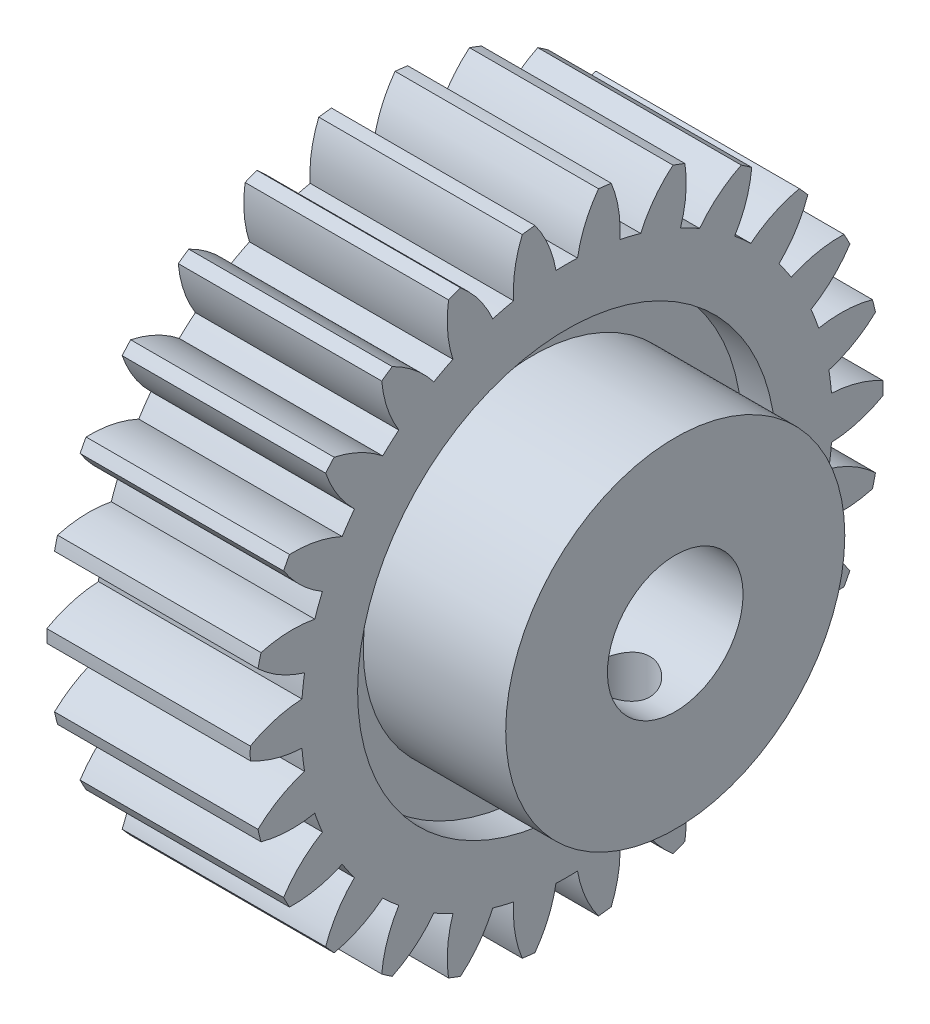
ISO-10303-21;
HEADER;
FILE_DESCRIPTION(('STEP AP214'),'2;1');
FILE_NAME('part.step','',(''),(''),'','','');
FILE_SCHEMA(('AUTOMOTIVE_DESIGN { 1 0 10303 214 1 1 1 1 }'));
ENDSEC;
DATA;
#1=APPLICATION_CONTEXT('core data for automotive mechanical design processes');
#2=APPLICATION_PROTOCOL_DEFINITION('international standard','automotive_design',2000,#1);
#3=PRODUCT_CONTEXT('',#1,'mechanical');
#4=PRODUCT('Part','Part','',(#3));
#5=PRODUCT_RELATED_PRODUCT_CATEGORY('part','',(#4));
#6=PRODUCT_DEFINITION_FORMATION('','',#4);
#7=PRODUCT_DEFINITION_CONTEXT('part definition',#1,'design');
#8=PRODUCT_DEFINITION('design','',#6,#7);
#9=PRODUCT_DEFINITION_SHAPE('','',#8);
#10=(LENGTH_UNIT() NAMED_UNIT(*) SI_UNIT(.MILLI.,.METRE.));
#11=(NAMED_UNIT(*) PLANE_ANGLE_UNIT() SI_UNIT($,.RADIAN.));
#12=(NAMED_UNIT(*) SI_UNIT($,.STERADIAN.) SOLID_ANGLE_UNIT());
#13=UNCERTAINTY_MEASURE_WITH_UNIT(LENGTH_MEASURE(1.E-05),#10,'distance_accuracy_value','');
#14=(GEOMETRIC_REPRESENTATION_CONTEXT(3) GLOBAL_UNCERTAINTY_ASSIGNED_CONTEXT((#13)) GLOBAL_UNIT_ASSIGNED_CONTEXT((#10,
#11,#12)) REPRESENTATION_CONTEXT('',''));
#15=CARTESIAN_POINT('',(0.,0.,0.));
#16=DIRECTION('',(0.,0.,1.));
#17=DIRECTION('',(1.,0.,0.));
#18=AXIS2_PLACEMENT_3D('',#15,#16,#17);
#19=CARTESIAN_POINT('',(0.,0.,0.));
#20=DIRECTION('',(1.,0.,0.));
#21=DIRECTION('',(0.,0.,-1.));
#22=AXIS2_PLACEMENT_3D('',#19,#20,#21);
#23=PLANE('',#22);
#24=CARTESIAN_POINT('',(0.,4.25201091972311,11.4521246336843));
#25=DIRECTION('',(-1.,0.,0.));
#26=DIRECTION('',(0.,0.992708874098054,0.120536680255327));
#27=AXIS2_PLACEMENT_3D('',#24,#25,#26);
#28=CIRCLE('',#27,5.2);
#29=CARTESIAN_POINT('',(0.,-0.941530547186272,11.7112134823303));
#30=VERTEX_POINT('',#29);
#31=CARTESIAN_POINT('',(0.,-0.282618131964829,13.9971471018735));
#32=VERTEX_POINT('',#31);
#33=EDGE_CURVE('E51',#30,#32,#28,.T.);
#34=ORIENTED_EDGE('',*,*,#33,.T.);
#35=CARTESIAN_POINT('',(0.,0.,0.));
#36=DIRECTION('',(-1.,0.,0.));
#37=DIRECTION('',(0.,0.,1.));
#38=AXIS2_PLACEMENT_3D('',#35,#36,#37);
#39=CIRCLE('',#38,14.);
#40=CARTESIAN_POINT('',(0.,0.282618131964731,13.9971471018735));
#41=VERTEX_POINT('',#40);
#42=EDGE_CURVE('E1312',#32,#41,#39,.T.);
#43=ORIENTED_EDGE('',*,*,#42,.T.);
#44=CARTESIAN_POINT('',(0.,-4.25201091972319,11.4521246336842));
#45=DIRECTION('',(1.,0.,0.));
#46=DIRECTION('',(0.,0.,-1.));
#47=AXIS2_PLACEMENT_3D('',#44,#45,#46);
#48=CIRCLE('',#47,5.2);
#49=CARTESIAN_POINT('',(0.,0.941530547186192,11.7112134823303));
#50=VERTEX_POINT('',#49);
#51=EDGE_CURVE('E44',#50,#41,#48,.T.);
#52=ORIENTED_EDGE('',*,*,#51,.F.);
#53=CARTESIAN_POINT('',(0.,0.,0.));
#54=DIRECTION('',(-1.,0.,0.));
#55=DIRECTION('',(0.,0.992708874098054,-0.12053668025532));
#56=AXIS2_PLACEMENT_3D('',#53,#54,#55);
#57=CIRCLE('',#56,11.749);
#58=CARTESIAN_POINT('',(0.,1.8885054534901,11.5962299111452));
#59=VERTEX_POINT('',#58);
#60=EDGE_CURVE('E716',#50,#59,#57,.T.);
#61=ORIENTED_EDGE('',*,*,#60,.T.);
#62=CARTESIAN_POINT('',(0.,6.86912802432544,10.1017738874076));
#63=DIRECTION('',(-1.,0.,0.));
#64=DIRECTION('',(0.,0.992708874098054,-0.12053668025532));
#65=AXIS2_PLACEMENT_3D('',#62,#63,#64);
#66=CIRCLE('',#65,5.2);
#67=CARTESIAN_POINT('',(0.,3.07533079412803,13.6580503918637));
#68=VERTEX_POINT('',#67);
#69=EDGE_CURVE('E59',#59,#68,#66,.T.);
#70=ORIENTED_EDGE('',*,*,#69,.T.);
#71=CARTESIAN_POINT('',(0.,3.62414231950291,13.522780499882));
#72=VERTEX_POINT('',#71);
#73=EDGE_CURVE('E1317',#68,#72,#39,.T.);
#74=ORIENTED_EDGE('',*,*,#73,.T.);
#75=CARTESIAN_POINT('',(0.,-1.3877823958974,12.1369195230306));
#76=DIRECTION('',(1.,0.,0.));
#77=DIRECTION('',(0.,0.,-1.));
#78=AXIS2_PLACEMENT_3D('',#75,#76,#77);
#79=CIRCLE('',#78,5.2);
#80=CARTESIAN_POINT('',(0.,3.71684821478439,11.1455838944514));
#81=VERTEX_POINT('',#80);
#82=EDGE_CURVE('E1296',#81,#72,#79,.T.);
#83=ORIENTED_EDGE('',*,*,#82,.F.);
#84=CARTESIAN_POINT('',(0.,0.,0.));
#85=DIRECTION('',(-1.,0.,0.));
#86=DIRECTION('',(0.,0.935016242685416,-0.354604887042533));
#87=AXIS2_PLACEMENT_3D('',#84,#85,#86);
#88=CIRCLE('',#87,11.749);
#89=CARTESIAN_POINT('',(0.,4.60878838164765,10.807315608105));
#90=VERTEX_POINT('',#89);
#91=EDGE_CURVE('E696',#81,#90,#88,.T.);
#92=ORIENTED_EDGE('',*,*,#91,.T.);
#93=CARTESIAN_POINT('',(0.,9.08703637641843,8.16434476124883));
#94=DIRECTION('',(-1.,0.,0.));
#95=DIRECTION('',(0.,0.935016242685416,-0.354604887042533));
#96=AXIS2_PLACEMENT_3D('',#93,#94,#95);
#97=CIRCLE('',#96,5.2);
#98=CARTESIAN_POINT('',(0.,6.25455267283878,12.525197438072));
#99=VERTEX_POINT('',#98);
#100=EDGE_CURVE('E708',#90,#99,#97,.T.);
#101=ORIENTED_EDGE('',*,*,#100,.T.);
#102=CARTESIAN_POINT('',(0.,6.75504452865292,12.2625190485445));
#103=VERTEX_POINT('',#102);
#104=EDGE_CURVE('E1321',#99,#103,#39,.T.);
#105=ORIENTED_EDGE('',*,*,#104,.T.);
#106=CARTESIAN_POINT('',(0.,1.55709899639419,12.1163607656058));
#107=DIRECTION('',(1.,0.,0.));
#108=DIRECTION('',(0.,0.,-1.));
#109=AXIS2_PLACEMENT_3D('',#106,#107,#108);
#110=CIRCLE('',#109,5.2);
#111=CARTESIAN_POINT('',(0.,6.27615617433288,9.932213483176));
#112=VERTEX_POINT('',#111);
#113=EDGE_CURVE('E1292',#112,#103,#110,.T.);
#114=ORIENTED_EDGE('',*,*,#113,.F.);
#115=CARTESIAN_POINT('',(0.,0.,0.));
#116=DIRECTION('',(-1.,0.,0.));
#117=DIRECTION('',(0.,0.822983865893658,-0.568064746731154));
#118=AXIS2_PLACEMENT_3D('',#115,#116,#117);
#119=CIRCLE('',#118,11.749);
#120=CARTESIAN_POINT('',(0.,7.06122528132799,9.3903194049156));
#121=VERTEX_POINT('',#120);
#122=EDGE_CURVE('E744',#112,#121,#119,.T.);
#123=ORIENTED_EDGE('',*,*,#122,.T.);
#124=CARTESIAN_POINT('',(0.,10.7768392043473,5.75243359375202));
#125=DIRECTION('',(-1.,0.,0.));
#126=DIRECTION('',(0.,0.822983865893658,-0.568064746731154));
#127=AXIS2_PLACEMENT_3D('',#124,#125,#126);
#128=CIRCLE('',#127,5.2);
#129=CARTESIAN_POINT('',(0.,9.07028268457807,10.6644255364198));
#130=VERTEX_POINT('',#129);
#131=EDGE_CURVE('E698',#121,#130,#128,.T.);
#132=ORIENTED_EDGE('',*,*,#131,.T.);
#133=CARTESIAN_POINT('',(0.,9.49336810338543,10.2896045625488));
#134=VERTEX_POINT('',#133);
#135=EDGE_CURVE('E1324',#130,#134,#39,.T.);
#136=ORIENTED_EDGE('',*,*,#135,.T.);
#137=CARTESIAN_POINT('',(0.,4.41148745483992,11.3916431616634));
#138=DIRECTION('',(1.,0.,0.));
#139=DIRECTION('',(0.,0.,-1.));
#140=AXIS2_PLACEMENT_3D('',#137,#138,#139);
#141=CIRCLE('',#140,5.2);
#142=CARTESIAN_POINT('',(0.,8.47071674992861,8.14161892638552));
#143=VERTEX_POINT('',#142);
#144=EDGE_CURVE('E1290',#143,#134,#141,.T.);
#145=ORIENTED_EDGE('',*,*,#144,.F.);
#146=CARTESIAN_POINT('',(0.,0.,0.));
#147=DIRECTION('',(-1.,0.,0.));
#148=DIRECTION('',(0.,0.663122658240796,-0.7485107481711));
#149=AXIS2_PLACEMENT_3D('',#146,#147,#148);
#150=CIRCLE('',#149,11.749);
#151=CARTESIAN_POINT('',(0.,9.1032894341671,7.42759197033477));
#152=VERTEX_POINT('',#151);
#153=EDGE_CURVE('E761',#143,#152,#150,.T.);
#154=ORIENTED_EDGE('',*,*,#153,.T.);
#155=CARTESIAN_POINT('',(0.,11.8403313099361,3.0062118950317));
#156=DIRECTION('',(-1.,0.,0.));
#157=DIRECTION('',(0.,0.663122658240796,-0.7485107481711));
#158=AXIS2_PLACEMENT_3D('',#155,#156,#157);
#159=CIRCLE('',#158,5.2);
#160=CARTESIAN_POINT('',(0.,11.3588808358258,8.18387598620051));
#161=VERTEX_POINT('',#160);
#162=EDGE_CURVE('E757',#152,#161,#159,.T.);
#163=ORIENTED_EDGE('',*,*,#162,.T.);
#164=CARTESIAN_POINT('',(0.,11.6799716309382,7.71869566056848));
#165=VERTEX_POINT('',#164);
#166=EDGE_CURVE('E1328',#161,#165,#39,.T.);
#167=ORIENTED_EDGE('',*,*,#166,.T.);
#168=CARTESIAN_POINT('',(0.,7.0094962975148,10.0048846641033));
#169=DIRECTION('',(1.,0.,0.));
#170=DIRECTION('',(0.,0.,-1.));
#171=AXIS2_PLACEMENT_3D('',#168,#169,#170);
#172=CIRCLE('',#171,5.2);
#173=CARTESIAN_POINT('',(0.,10.1729900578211,5.87786307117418));
#174=VERTEX_POINT('',#173);
#175=EDGE_CURVE('E1294',#174,#165,#172,.T.);
#176=ORIENTED_EDGE('',*,*,#175,.F.);
#177=CARTESIAN_POINT('',(0.,0.,0.));
#178=DIRECTION('',(-1.,0.,0.));
#179=DIRECTION('',(0.,0.46472317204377,-0.885456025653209));
#180=AXIS2_PLACEMENT_3D('',#177,#178,#179);
#181=CIRCLE('',#180,11.749);
#182=CARTESIAN_POINT('',(0.,10.6163034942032,5.03319988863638));
#183=VERTEX_POINT('',#182);
#184=EDGE_CURVE('E778',#174,#183,#181,.T.);
#185=ORIENTED_EDGE('',*,*,#184,.T.);
#186=CARTESIAN_POINT('',(0.,12.2157063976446,0.0852800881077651));
#187=DIRECTION('',(-1.,0.,0.));
#188=DIRECTION('',(0.,0.46472317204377,-0.885456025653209));
#189=AXIS2_PLACEMENT_3D('',#186,#187,#188);
#190=CIRCLE('',#189,5.2);
#191=CARTESIAN_POINT('',(0.,12.9873421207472,5.22770931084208));
#192=VERTEX_POINT('',#191);
#193=EDGE_CURVE('E774',#183,#192,#190,.T.);
#194=ORIENTED_EDGE('',*,*,#193,.T.);
#195=CARTESIAN_POINT('',(0.,13.1877776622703,4.69920422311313));
#196=VERTEX_POINT('',#195);
#197=EDGE_CURVE('E1242',#192,#196,#39,.T.);
#198=ORIENTED_EDGE('',*,*,#197,.T.);
#199=CARTESIAN_POINT('',(0.,9.20013869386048,8.03667863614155));
#200=DIRECTION('',(1.,0.,0.));
#201=DIRECTION('',(0.,0.,-1.));
#202=AXIS2_PLACEMENT_3D('',#199,#200,#201);
#203=CIRCLE('',#202,5.2);
#204=CARTESIAN_POINT('',(0.,11.2840461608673,3.27250717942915));
#205=VERTEX_POINT('',#204);
#206=EDGE_CURVE('E1251',#205,#196,#203,.T.);
#207=ORIENTED_EDGE('',*,*,#206,.F.);
#208=CARTESIAN_POINT('',(0.,0.,0.));
#209=DIRECTION('',(-1.,0.,0.));
#210=DIRECTION('',(0.,0.239315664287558,-0.970941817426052));
#211=AXIS2_PLACEMENT_3D('',#208,#209,#210);
#212=CIRCLE('',#211,11.749);
#213=CARTESIAN_POINT('',(0.,11.5123365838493,2.34629652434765));
#214=VERTEX_POINT('',#213);
#215=EDGE_CURVE('E1196',#205,#214,#212,.T.);
#216=ORIENTED_EDGE('',*,*,#215,.T.);
#217=CARTESIAN_POINT('',(0.,11.8811490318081,-2.84060788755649));
#218=DIRECTION('',(-1.,0.,0.));
#219=DIRECTION('',(0.,0.239315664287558,-0.970941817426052));
#220=AXIS2_PLACEMENT_3D('',#217,#218,#219);
#221=CIRCLE('',#220,5.2);
#222=CARTESIAN_POINT('',(0.,13.8610262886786,1.9677271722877));
#223=VERTEX_POINT('',#222);
#224=EDGE_CURVE('E1192',#214,#223,#221,.T.);
#225=ORIENTED_EDGE('',*,*,#224,.T.);
#226=CARTESIAN_POINT('',(0.,13.9291579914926,1.4066121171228));
#227=VERTEX_POINT('',#226);
#228=EDGE_CURVE('E1236',#223,#227,#39,.T.);
#229=ORIENTED_EDGE('',*,*,#228,.T.);
#230=CARTESIAN_POINT('',(0.,10.8561024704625,5.60141005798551));
#231=DIRECTION('',(1.,0.,0.));
#232=DIRECTION('',(0.,0.,-1.));
#233=AXIS2_PLACEMENT_3D('',#230,#231,#232);
#234=CIRCLE('',#233,5.2);
#235=CARTESIAN_POINT('',(0.,11.7393145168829,0.47696506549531));
#236=VERTEX_POINT('',#235);
#237=EDGE_CURVE('E1246',#236,#227,#234,.T.);
#238=ORIENTED_EDGE('',*,*,#237,.F.);
#239=CARTESIAN_POINT('',(0.,0.,0.));
#240=DIRECTION('',(-1.,0.,0.));
#241=DIRECTION('',(0.,0.,-1.));
#242=AXIS2_PLACEMENT_3D('',#239,#240,#241);
#243=CIRCLE('',#242,11.749);
#244=CARTESIAN_POINT('',(0.,11.7393145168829,-0.476965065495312));
#245=VERTEX_POINT('',#244);
#246=EDGE_CURVE('E1218',#236,#245,#243,.T.);
#247=ORIENTED_EDGE('',*,*,#246,.T.);
#248=CARTESIAN_POINT('',(0.,10.8561024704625,-5.60141005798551));
#249=DIRECTION('',(-1.,0.,0.));
#250=DIRECTION('',(0.,0.,-1.));
#251=AXIS2_PLACEMENT_3D('',#248,#249,#250);
#252=CIRCLE('',#251,5.2);
#253=CARTESIAN_POINT('',(0.,13.9291579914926,-1.4066121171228));
#254=VERTEX_POINT('',#253);
#255=EDGE_CURVE('E1214',#245,#254,#252,.T.);
#256=ORIENTED_EDGE('',*,*,#255,.T.);
#257=CARTESIAN_POINT('',(0.,13.8610262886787,-1.96772717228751));
#258=VERTEX_POINT('',#257);
#259=EDGE_CURVE('E1237',#254,#258,#39,.T.);
#260=ORIENTED_EDGE('',*,*,#259,.T.);
#261=CARTESIAN_POINT('',(0.,11.8811490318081,2.84060788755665));
#262=DIRECTION('',(1.,0.,0.));
#263=DIRECTION('',(0.,0.,-1.));
#264=AXIS2_PLACEMENT_3D('',#261,#262,#263);
#265=CIRCLE('',#264,5.2);
#266=CARTESIAN_POINT('',(0.,11.5123365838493,-2.34629652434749));
#267=VERTEX_POINT('',#266);
#268=EDGE_CURVE('E1260',#267,#258,#265,.T.);
#269=ORIENTED_EDGE('',*,*,#268,.F.);
#270=CARTESIAN_POINT('',(0.,0.,0.));
#271=DIRECTION('',(-1.,0.,0.));
#272=DIRECTION('',(0.,-0.239315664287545,-0.970941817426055));
#273=AXIS2_PLACEMENT_3D('',#270,#271,#272);
#274=CIRCLE('',#273,11.749);
#275=CARTESIAN_POINT('',(0.,11.2840461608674,-3.272507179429));
#276=VERTEX_POINT('',#275);
#277=EDGE_CURVE('E1018',#267,#276,#274,.T.);
#278=ORIENTED_EDGE('',*,*,#277,.T.);
#279=CARTESIAN_POINT('',(0.,9.20013869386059,-8.03667863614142));
#280=DIRECTION('',(-1.,0.,0.));
#281=DIRECTION('',(0.,-0.239315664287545,-0.970941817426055));
#282=AXIS2_PLACEMENT_3D('',#279,#280,#281);
#283=CIRCLE('',#282,5.2);
#284=CARTESIAN_POINT('',(0.,13.1877776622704,-4.69920422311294));
#285=VERTEX_POINT('',#284);
#286=EDGE_CURVE('E1023',#276,#285,#283,.T.);
#287=ORIENTED_EDGE('',*,*,#286,.T.);
#288=CARTESIAN_POINT('',(0.,12.9873421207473,-5.2277093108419));
#289=VERTEX_POINT('',#288);
#290=EDGE_CURVE('E1241',#285,#289,#39,.T.);
#291=ORIENTED_EDGE('',*,*,#290,.T.);
#292=CARTESIAN_POINT('',(0.,12.2157063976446,-0.0852800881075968));
#293=DIRECTION('',(1.,0.,0.));
#294=DIRECTION('',(0.,0.,-1.));
#295=AXIS2_PLACEMENT_3D('',#292,#293,#294);
#296=CIRCLE('',#295,5.2);
#297=CARTESIAN_POINT('',(0.,10.6163034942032,-5.03319988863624));
#298=VERTEX_POINT('',#297);
#299=EDGE_CURVE('E1262',#298,#289,#296,.T.);
#300=ORIENTED_EDGE('',*,*,#299,.F.);
#301=CARTESIAN_POINT('',(0.,0.,0.));
#302=DIRECTION('',(-1.,0.,0.));
#303=DIRECTION('',(0.,-0.464723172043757,-0.885456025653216));
#304=AXIS2_PLACEMENT_3D('',#301,#302,#303);
#305=CIRCLE('',#304,11.749);
#306=CARTESIAN_POINT('',(0.,10.1729900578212,-5.87786307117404));
#307=VERTEX_POINT('',#306);
#308=EDGE_CURVE('E999',#298,#307,#305,.T.);
#309=ORIENTED_EDGE('',*,*,#308,.T.);
#310=CARTESIAN_POINT('',(0.,7.00949629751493,-10.0048846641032));
#311=DIRECTION('',(-1.,0.,0.));
#312=DIRECTION('',(0.,-0.464723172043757,-0.885456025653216));
#313=AXIS2_PLACEMENT_3D('',#310,#311,#312);
#314=CIRCLE('',#313,5.2);
#315=CARTESIAN_POINT('',(0.,11.6799716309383,-7.71869566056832));
#316=VERTEX_POINT('',#315);
#317=EDGE_CURVE('E1004',#307,#316,#314,.T.);
#318=ORIENTED_EDGE('',*,*,#317,.T.);
#319=CARTESIAN_POINT('',(0.,11.3588808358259,-8.18387598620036));
#320=VERTEX_POINT('',#319);
#321=EDGE_CURVE('E1339',#316,#320,#39,.T.);
#322=ORIENTED_EDGE('',*,*,#321,.T.);
#323=CARTESIAN_POINT('',(0.,11.8403313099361,-3.00621189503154));
#324=DIRECTION('',(1.,0.,0.));
#325=DIRECTION('',(0.,0.,-1.));
#326=AXIS2_PLACEMENT_3D('',#323,#324,#325);
#327=CIRCLE('',#326,5.2);
#328=CARTESIAN_POINT('',(0.,9.1032894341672,-7.42759197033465));
#329=VERTEX_POINT('',#328);
#330=EDGE_CURVE('E1264',#329,#320,#327,.T.);
#331=ORIENTED_EDGE('',*,*,#330,.F.);
#332=CARTESIAN_POINT('',(0.,0.,0.));
#333=DIRECTION('',(-1.,0.,0.));
#334=DIRECTION('',(0.,-0.663122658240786,-0.748510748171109));
#335=AXIS2_PLACEMENT_3D('',#332,#333,#334);
#336=CIRCLE('',#335,11.749);
#337=CARTESIAN_POINT('',(0.,8.47071674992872,-8.1416189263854));
#338=VERTEX_POINT('',#337);
#339=EDGE_CURVE('E1035',#329,#338,#336,.T.);
#340=ORIENTED_EDGE('',*,*,#339,.T.);
#341=CARTESIAN_POINT('',(0.,4.41148745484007,-11.3916431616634));
#342=DIRECTION('',(-1.,0.,0.));
#343=DIRECTION('',(0.,-0.663122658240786,-0.748510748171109));
#344=AXIS2_PLACEMENT_3D('',#341,#342,#343);
#345=CIRCLE('',#344,5.2);
#346=CARTESIAN_POINT('',(0.,9.49336810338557,-10.2896045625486));
#347=VERTEX_POINT('',#346);
#348=EDGE_CURVE('E1014',#338,#347,#345,.T.);
#349=ORIENTED_EDGE('',*,*,#348,.T.);
#350=CARTESIAN_POINT('',(0.,9.07028268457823,-10.6644255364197));
#351=VERTEX_POINT('',#350);
#352=EDGE_CURVE('E1343',#347,#351,#39,.T.);
#353=ORIENTED_EDGE('',*,*,#352,.T.);
#354=CARTESIAN_POINT('',(0.,10.7768392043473,-5.75243359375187));
#355=DIRECTION('',(1.,0.,0.));
#356=DIRECTION('',(0.,0.,-1.));
#357=AXIS2_PLACEMENT_3D('',#354,#355,#356);
#358=CIRCLE('',#357,5.2);
#359=CARTESIAN_POINT('',(0.,7.06122528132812,-9.3903194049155));
#360=VERTEX_POINT('',#359);
#361=EDGE_CURVE('E1256',#360,#351,#358,.T.);
#362=ORIENTED_EDGE('',*,*,#361,.F.);
#363=CARTESIAN_POINT('',(0.,0.,0.));
#364=DIRECTION('',(-1.,0.,0.));
#365=DIRECTION('',(0.,-0.822983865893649,-0.568064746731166));
#366=AXIS2_PLACEMENT_3D('',#363,#364,#365);
#367=CIRCLE('',#366,11.749);
#368=CARTESIAN_POINT('',(0.,6.27615617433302,-9.93221348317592));
#369=VERTEX_POINT('',#368);
#370=EDGE_CURVE('E1069',#360,#369,#367,.T.);
#371=ORIENTED_EDGE('',*,*,#370,.T.);
#372=CARTESIAN_POINT('',(0.,1.55709899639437,-12.1163607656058));
#373=DIRECTION('',(-1.,0.,0.));
#374=DIRECTION('',(0.,-0.822983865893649,-0.568064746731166));
#375=AXIS2_PLACEMENT_3D('',#372,#373,#374);
#376=CIRCLE('',#375,5.2);
#377=CARTESIAN_POINT('',(0.,6.75504452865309,-12.2625190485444));
#378=VERTEX_POINT('',#377);
#379=EDGE_CURVE('E1048',#369,#378,#376,.T.);
#380=ORIENTED_EDGE('',*,*,#379,.T.);
#381=CARTESIAN_POINT('',(0.,6.25455267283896,-12.5251974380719));
#382=VERTEX_POINT('',#381);
#383=EDGE_CURVE('E1347',#378,#382,#39,.T.);
#384=ORIENTED_EDGE('',*,*,#383,.T.);
#385=CARTESIAN_POINT('',(0.,9.08703637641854,-8.1643447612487));
#386=DIRECTION('',(1.,0.,0.));
#387=DIRECTION('',(0.,0.,-1.));
#388=AXIS2_PLACEMENT_3D('',#385,#386,#387);
#389=CIRCLE('',#388,5.2);
#390=CARTESIAN_POINT('',(0.,4.6087883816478,-10.8073156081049));
#391=VERTEX_POINT('',#390);
#392=EDGE_CURVE('E1258',#391,#382,#389,.T.);
#393=ORIENTED_EDGE('',*,*,#392,.F.);
#394=CARTESIAN_POINT('',(0.,0.,0.));
#395=DIRECTION('',(-1.,0.,0.));
#396=DIRECTION('',(0.,-0.935016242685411,-0.354604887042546));
#397=AXIS2_PLACEMENT_3D('',#394,#395,#396);
#398=CIRCLE('',#397,11.749);
#399=CARTESIAN_POINT('',(0.,3.71684821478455,-11.1455838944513));
#400=VERTEX_POINT('',#399);
#401=EDGE_CURVE('E1086',#391,#400,#398,.T.);
#402=ORIENTED_EDGE('',*,*,#401,.T.);
#403=CARTESIAN_POINT('',(0.,-1.38778239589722,-12.1369195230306));
#404=DIRECTION('',(-1.,0.,0.));
#405=DIRECTION('',(0.,-0.935016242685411,-0.354604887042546));
#406=AXIS2_PLACEMENT_3D('',#403,#404,#405);
#407=CIRCLE('',#406,5.2);
#408=CARTESIAN_POINT('',(0.,3.6241423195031,-13.5227804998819));
#409=VERTEX_POINT('',#408);
#410=EDGE_CURVE('E1082',#400,#409,#407,.T.);
#411=ORIENTED_EDGE('',*,*,#410,.T.);
#412=CARTESIAN_POINT('',(0.,3.07533079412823,-13.6580503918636));
#413=VERTEX_POINT('',#412);
#414=EDGE_CURVE('E1351',#409,#413,#39,.T.);
#415=ORIENTED_EDGE('',*,*,#414,.T.);
#416=CARTESIAN_POINT('',(0.,6.86912802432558,-10.1017738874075));
#417=DIRECTION('',(1.,0.,0.));
#418=DIRECTION('',(0.,0.,-1.));
#419=AXIS2_PLACEMENT_3D('',#416,#417,#418);
#420=CIRCLE('',#419,5.2);
#421=CARTESIAN_POINT('',(0.,1.88850545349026,-11.5962299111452));
#422=VERTEX_POINT('',#421);
#423=EDGE_CURVE('E1254',#422,#413,#420,.T.);
#424=ORIENTED_EDGE('',*,*,#423,.F.);
#425=CARTESIAN_POINT('',(0.,0.,0.));
#426=DIRECTION('',(-1.,0.,0.));
#427=DIRECTION('',(0.,-0.992708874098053,-0.120536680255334));
#428=AXIS2_PLACEMENT_3D('',#425,#426,#427);
#429=CIRCLE('',#428,11.749);
#430=CARTESIAN_POINT('',(0.,0.941530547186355,-11.7112134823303));
#431=VERTEX_POINT('',#430);
#432=EDGE_CURVE('E1052',#422,#431,#429,.T.);
#433=ORIENTED_EDGE('',*,*,#432,.T.);
#434=CARTESIAN_POINT('',(0.,-4.25201091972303,-11.4521246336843));
#435=DIRECTION('',(-1.,0.,0.));
#436=DIRECTION('',(0.,-0.992708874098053,-0.120536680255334));
#437=AXIS2_PLACEMENT_3D('',#434,#435,#436);
#438=CIRCLE('',#437,5.2);
#439=CARTESIAN_POINT('',(0.,0.282618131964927,-13.9971471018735));
#440=VERTEX_POINT('',#439);
#441=EDGE_CURVE('E1057',#431,#440,#438,.T.);
#442=ORIENTED_EDGE('',*,*,#441,.T.);
#443=CARTESIAN_POINT('',(0.,-0.282618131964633,-13.9971471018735));
#444=VERTEX_POINT('',#443);
#445=EDGE_CURVE('E1355',#440,#444,#39,.T.);
#446=ORIENTED_EDGE('',*,*,#445,.T.);
#447=CARTESIAN_POINT('',(0.,4.25201091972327,-11.4521246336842));
#448=DIRECTION('',(1.,0.,0.));
#449=DIRECTION('',(0.,0.,-1.));
#450=AXIS2_PLACEMENT_3D('',#447,#448,#449);
#451=CIRCLE('',#450,5.2);
#452=CARTESIAN_POINT('',(0.,-0.94153054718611,-11.7112134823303));
#453=VERTEX_POINT('',#452);
#454=EDGE_CURVE('E1272',#453,#444,#451,.T.);
#455=ORIENTED_EDGE('',*,*,#454,.F.);
#456=CARTESIAN_POINT('',(0.,0.,0.));
#457=DIRECTION('',(-1.,0.,0.));
#458=DIRECTION('',(0.,-0.992708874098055,0.120536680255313));
#459=AXIS2_PLACEMENT_3D('',#456,#457,#458);
#460=CIRCLE('',#459,11.749);
#461=CARTESIAN_POINT('',(0.,-1.88850545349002,-11.5962299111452));
#462=VERTEX_POINT('',#461);
#463=EDGE_CURVE('E916',#453,#462,#460,.T.);
#464=ORIENTED_EDGE('',*,*,#463,.T.);
#465=CARTESIAN_POINT('',(0.,-6.86912802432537,-10.1017738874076));
#466=DIRECTION('',(-1.,0.,0.));
#467=DIRECTION('',(0.,-0.992708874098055,0.120536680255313));
#468=AXIS2_PLACEMENT_3D('',#465,#466,#467);
#469=CIRCLE('',#468,5.2);
#470=CARTESIAN_POINT('',(0.,-3.07533079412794,-13.6580503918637));
#471=VERTEX_POINT('',#470);
#472=EDGE_CURVE('E921',#462,#471,#469,.T.);
#473=ORIENTED_EDGE('',*,*,#472,.T.);
#474=CARTESIAN_POINT('',(0.,-3.62414231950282,-13.522780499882));
#475=VERTEX_POINT('',#474);
#476=EDGE_CURVE('E1359',#471,#475,#39,.T.);
#477=ORIENTED_EDGE('',*,*,#476,.T.);
#478=CARTESIAN_POINT('',(0.,1.38778239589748,-12.1369195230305));
#479=DIRECTION('',(1.,0.,0.));
#480=DIRECTION('',(0.,0.,-1.));
#481=AXIS2_PLACEMENT_3D('',#478,#479,#480);
#482=CIRCLE('',#481,5.2);
#483=CARTESIAN_POINT('',(0.,-3.71684821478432,-11.1455838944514));
#484=VERTEX_POINT('',#483);
#485=EDGE_CURVE('E1274',#484,#475,#482,.T.);
#486=ORIENTED_EDGE('',*,*,#485,.F.);
#487=CARTESIAN_POINT('',(0.,0.,0.));
#488=DIRECTION('',(-1.,0.,0.));
#489=DIRECTION('',(0.,-0.935016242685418,0.354604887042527));
#490=AXIS2_PLACEMENT_3D('',#487,#488,#489);
#491=CIRCLE('',#490,11.749);
#492=CARTESIAN_POINT('',(0.,-4.60878838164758,-10.807315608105));
#493=VERTEX_POINT('',#492);
#494=EDGE_CURVE('E897',#484,#493,#491,.T.);
#495=ORIENTED_EDGE('',*,*,#494,.T.);
#496=CARTESIAN_POINT('',(0.,-9.08703637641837,-8.16434476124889));
#497=DIRECTION('',(-1.,0.,0.));
#498=DIRECTION('',(0.,-0.935016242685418,0.354604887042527));
#499=AXIS2_PLACEMENT_3D('',#496,#497,#498);
#500=CIRCLE('',#499,5.2);
#501=CARTESIAN_POINT('',(0.,-6.2545526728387,-12.525197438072));
#502=VERTEX_POINT('',#501);
#503=EDGE_CURVE('E902',#493,#502,#500,.T.);
#504=ORIENTED_EDGE('',*,*,#503,.T.);
#505=CARTESIAN_POINT('',(0.,-6.75504452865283,-12.2625190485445));
#506=VERTEX_POINT('',#505);
#507=EDGE_CURVE('E1363',#502,#506,#39,.T.);
#508=ORIENTED_EDGE('',*,*,#507,.T.);
#509=CARTESIAN_POINT('',(0.,-1.55709899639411,-12.1163607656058));
#510=DIRECTION('',(1.,0.,0.));
#511=DIRECTION('',(0.,0.,-1.));
#512=AXIS2_PLACEMENT_3D('',#509,#510,#511);
#513=CIRCLE('',#512,5.2);
#514=CARTESIAN_POINT('',(0.,-6.27615617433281,-9.93221348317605));
#515=VERTEX_POINT('',#514);
#516=EDGE_CURVE('E1276',#515,#506,#513,.T.);
#517=ORIENTED_EDGE('',*,*,#516,.F.);
#518=CARTESIAN_POINT('',(0.,0.,0.));
#519=DIRECTION('',(-1.,0.,0.));
#520=DIRECTION('',(0.,-0.822983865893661,0.568064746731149));
#521=AXIS2_PLACEMENT_3D('',#518,#519,#520);
#522=CIRCLE('',#521,11.749);
#523=CARTESIAN_POINT('',(0.,-7.06122528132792,-9.39031940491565));
#524=VERTEX_POINT('',#523);
#525=EDGE_CURVE('E933',#515,#524,#522,.T.);
#526=ORIENTED_EDGE('',*,*,#525,.T.);
#527=CARTESIAN_POINT('',(0.,-10.7768392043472,-5.75243359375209));
#528=DIRECTION('',(-1.,0.,0.));
#529=DIRECTION('',(0.,-0.822983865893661,0.568064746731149));
#530=AXIS2_PLACEMENT_3D('',#527,#528,#529);
#531=CIRCLE('',#530,5.2);
#532=CARTESIAN_POINT('',(0.,-9.07028268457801,-10.6644255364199));
#533=VERTEX_POINT('',#532);
#534=EDGE_CURVE('E912',#524,#533,#531,.T.);
#535=ORIENTED_EDGE('',*,*,#534,.T.);
#536=CARTESIAN_POINT('',(0.,-9.49336810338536,-10.2896045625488));
#537=VERTEX_POINT('',#536);
#538=EDGE_CURVE('E1367',#533,#537,#39,.T.);
#539=ORIENTED_EDGE('',*,*,#538,.T.);
#540=CARTESIAN_POINT('',(0.,-4.41148745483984,-11.3916431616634));
#541=DIRECTION('',(1.,0.,0.));
#542=DIRECTION('',(0.,0.,-1.));
#543=AXIS2_PLACEMENT_3D('',#540,#541,#542);
#544=CIRCLE('',#543,5.2);
#545=CARTESIAN_POINT('',(0.,-8.47071674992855,-8.14161892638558));
#546=VERTEX_POINT('',#545);
#547=EDGE_CURVE('E1268',#546,#537,#544,.T.);
#548=ORIENTED_EDGE('',*,*,#547,.F.);
#549=CARTESIAN_POINT('',(0.,0.,0.));
#550=DIRECTION('',(-1.,0.,0.));
#551=DIRECTION('',(0.,-0.663122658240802,0.748510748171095));
#552=AXIS2_PLACEMENT_3D('',#549,#550,#551);
#553=CIRCLE('',#552,11.749);
#554=CARTESIAN_POINT('',(0.,-9.10328943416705,-7.42759197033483));
#555=VERTEX_POINT('',#554);
#556=EDGE_CURVE('E967',#546,#555,#553,.T.);
#557=ORIENTED_EDGE('',*,*,#556,.T.);
#558=CARTESIAN_POINT('',(0.,-11.8403313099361,-3.00621189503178));
#559=DIRECTION('',(-1.,0.,0.));
#560=DIRECTION('',(0.,-0.663122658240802,0.748510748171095));
#561=AXIS2_PLACEMENT_3D('',#558,#559,#560);
#562=CIRCLE('',#561,5.2);
#563=CARTESIAN_POINT('',(0.,-11.3588808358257,-8.18387598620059));
#564=VERTEX_POINT('',#563);
#565=EDGE_CURVE('E946',#555,#564,#562,.T.);
#566=ORIENTED_EDGE('',*,*,#565,.T.);
#567=CARTESIAN_POINT('',(0.,-11.6799716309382,-7.71869566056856));
#568=VERTEX_POINT('',#567);
#569=EDGE_CURVE('E1371',#564,#568,#39,.T.);
#570=ORIENTED_EDGE('',*,*,#569,.T.);
#571=CARTESIAN_POINT('',(0.,-7.00949629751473,-10.0048846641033));
#572=DIRECTION('',(1.,0.,0.));
#573=DIRECTION('',(0.,0.,-1.));
#574=AXIS2_PLACEMENT_3D('',#571,#572,#573);
#575=CIRCLE('',#574,5.2);
#576=CARTESIAN_POINT('',(0.,-10.1729900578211,-5.87786307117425));
#577=VERTEX_POINT('',#576);
#578=EDGE_CURVE('E1270',#577,#568,#575,.T.);
#579=ORIENTED_EDGE('',*,*,#578,.F.);
#580=CARTESIAN_POINT('',(0.,0.,0.));
#581=DIRECTION('',(-1.,0.,0.));
#582=DIRECTION('',(0.,-0.464723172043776,0.885456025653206));
#583=AXIS2_PLACEMENT_3D('',#580,#581,#582);
#584=CIRCLE('',#583,11.749);
#585=CARTESIAN_POINT('',(0.,-10.6163034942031,-5.03319988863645));
#586=VERTEX_POINT('',#585);
#587=EDGE_CURVE('E984',#577,#586,#584,.T.);
#588=ORIENTED_EDGE('',*,*,#587,.T.);
#589=CARTESIAN_POINT('',(0.,-12.2157063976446,-0.0852800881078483));
#590=DIRECTION('',(-1.,0.,0.));
#591=DIRECTION('',(0.,-0.464723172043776,0.885456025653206));
#592=AXIS2_PLACEMENT_3D('',#589,#590,#591);
#593=CIRCLE('',#592,5.2);
#594=CARTESIAN_POINT('',(0.,-12.9873421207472,-5.22770931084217));
#595=VERTEX_POINT('',#594);
#596=EDGE_CURVE('E980',#586,#595,#593,.T.);
#597=ORIENTED_EDGE('',*,*,#596,.T.);
#598=CARTESIAN_POINT('',(0.,-13.1877776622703,-4.69920422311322));
#599=VERTEX_POINT('',#598);
#600=EDGE_CURVE('E1375',#595,#599,#39,.T.);
#601=ORIENTED_EDGE('',*,*,#600,.T.);
#602=CARTESIAN_POINT('',(0.,-9.20013869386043,-8.03667863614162));
#603=DIRECTION('',(1.,0.,0.));
#604=DIRECTION('',(0.,0.,-1.));
#605=AXIS2_PLACEMENT_3D('',#602,#603,#604);
#606=CIRCLE('',#605,5.2);
#607=CARTESIAN_POINT('',(0.,-11.2840461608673,-3.27250717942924));
#608=VERTEX_POINT('',#607);
#609=EDGE_CURVE('E1266',#608,#599,#606,.T.);
#610=ORIENTED_EDGE('',*,*,#609,.F.);
#611=CARTESIAN_POINT('',(0.,0.,0.));
#612=DIRECTION('',(-1.,0.,0.));
#613=DIRECTION('',(0.,-0.239315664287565,0.97094181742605));
#614=AXIS2_PLACEMENT_3D('',#611,#612,#613);
#615=CIRCLE('',#614,11.749);
#616=CARTESIAN_POINT('',(0.,-11.5123365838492,-2.34629652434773));
#617=VERTEX_POINT('',#616);
#618=EDGE_CURVE('E950',#608,#617,#615,.T.);
#619=ORIENTED_EDGE('',*,*,#618,.T.);
#620=CARTESIAN_POINT('',(0.,-11.8811490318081,2.8406078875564));
#621=DIRECTION('',(-1.,0.,0.));
#622=DIRECTION('',(0.,-0.239315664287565,0.97094181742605));
#623=AXIS2_PLACEMENT_3D('',#620,#621,#622);
#624=CIRCLE('',#623,5.2);
#625=CARTESIAN_POINT('',(0.,-13.8610262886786,-1.9677271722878));
#626=VERTEX_POINT('',#625);
#627=EDGE_CURVE('E955',#617,#626,#624,.T.);
#628=ORIENTED_EDGE('',*,*,#627,.T.);
#629=CARTESIAN_POINT('',(0.,-13.9291579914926,-1.40661211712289));
#630=VERTEX_POINT('',#629);
#631=EDGE_CURVE('E1379',#626,#630,#39,.T.);
#632=ORIENTED_EDGE('',*,*,#631,.T.);
#633=CARTESIAN_POINT('',(0.,-10.8561024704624,-5.60141005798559));
#634=DIRECTION('',(1.,0.,0.));
#635=DIRECTION('',(0.,0.,-1.));
#636=AXIS2_PLACEMENT_3D('',#633,#634,#635);
#637=CIRCLE('',#636,5.2);
#638=CARTESIAN_POINT('',(0.,-11.7393145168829,-0.476965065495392));
#639=VERTEX_POINT('',#638);
#640=EDGE_CURVE('E1288',#639,#630,#637,.T.);
#641=ORIENTED_EDGE('',*,*,#640,.F.);
#642=CARTESIAN_POINT('',(0.,0.,0.));
#643=DIRECTION('',(-1.,0.,0.));
#644=DIRECTION('',(0.,0.,1.));
#645=AXIS2_PLACEMENT_3D('',#642,#643,#644);
#646=CIRCLE('',#645,11.749);
#647=CARTESIAN_POINT('',(0.,-11.7393145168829,0.47696506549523));
#648=VERTEX_POINT('',#647);
#649=EDGE_CURVE('E831',#639,#648,#646,.T.);
#650=ORIENTED_EDGE('',*,*,#649,.T.);
#651=CARTESIAN_POINT('',(0.,-10.8561024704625,5.60141005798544));
#652=DIRECTION('',(-1.,0.,0.));
#653=DIRECTION('',(0.,0.,1.));
#654=AXIS2_PLACEMENT_3D('',#651,#652,#653);
#655=CIRCLE('',#654,5.2);
#656=CARTESIAN_POINT('',(0.,-13.9291579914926,1.4066121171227));
#657=VERTEX_POINT('',#656);
#658=EDGE_CURVE('E836',#648,#657,#655,.T.);
#659=ORIENTED_EDGE('',*,*,#658,.T.);
#660=CARTESIAN_POINT('',(0.,-13.8610262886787,1.9677271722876));
#661=VERTEX_POINT('',#660);
#662=EDGE_CURVE('E1383',#657,#661,#39,.T.);
#663=ORIENTED_EDGE('',*,*,#662,.T.);
#664=CARTESIAN_POINT('',(0.,-11.8811490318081,-2.84060788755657));
#665=DIRECTION('',(1.,0.,0.));
#666=DIRECTION('',(0.,0.,-1.));
#667=AXIS2_PLACEMENT_3D('',#664,#665,#666);
#668=CIRCLE('',#667,5.2);
#669=CARTESIAN_POINT('',(0.,-11.5123365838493,2.34629652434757));
#670=VERTEX_POINT('',#669);
#671=EDGE_CURVE('E1286',#670,#661,#668,.T.);
#672=ORIENTED_EDGE('',*,*,#671,.F.);
#673=CARTESIAN_POINT('',(0.,0.,0.));
#674=DIRECTION('',(-1.,0.,0.));
#675=DIRECTION('',(0.,0.239315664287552,0.970941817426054));
#676=AXIS2_PLACEMENT_3D('',#673,#674,#675);
#677=CIRCLE('',#676,11.749);
#678=CARTESIAN_POINT('',(0.,-11.2840461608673,3.27250717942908));
#679=VERTEX_POINT('',#678);
#680=EDGE_CURVE('E814',#670,#679,#677,.T.);
#681=ORIENTED_EDGE('',*,*,#680,.T.);
#682=CARTESIAN_POINT('',(0.,-9.20013869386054,8.03667863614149));
#683=DIRECTION('',(-1.,0.,0.));
#684=DIRECTION('',(0.,0.239315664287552,0.970941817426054));
#685=AXIS2_PLACEMENT_3D('',#682,#683,#684);
#686=CIRCLE('',#685,5.2);
#687=CARTESIAN_POINT('',(0.,-13.1877776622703,4.69920422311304));
#688=VERTEX_POINT('',#687);
#689=EDGE_CURVE('E819',#679,#688,#686,.T.);
#690=ORIENTED_EDGE('',*,*,#689,.T.);
#691=CARTESIAN_POINT('',(0.,-12.9873421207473,5.22770931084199));
#692=VERTEX_POINT('',#691);
#693=EDGE_CURVE('E1387',#688,#692,#39,.T.);
#694=ORIENTED_EDGE('',*,*,#693,.T.);
#695=CARTESIAN_POINT('',(0.,-12.2157063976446,0.0852800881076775));
#696=DIRECTION('',(1.,0.,0.));
#697=DIRECTION('',(0.,0.,-1.));
#698=AXIS2_PLACEMENT_3D('',#695,#696,#697);
#699=CIRCLE('',#698,5.2);
#700=CARTESIAN_POINT('',(0.,-10.6163034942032,5.03319988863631));
#701=VERTEX_POINT('',#700);
#702=EDGE_CURVE('E1284',#701,#692,#699,.T.);
#703=ORIENTED_EDGE('',*,*,#702,.F.);
#704=CARTESIAN_POINT('',(0.,0.,0.));
#705=DIRECTION('',(-1.,0.,0.));
#706=DIRECTION('',(0.,0.464723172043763,0.885456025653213));
#707=AXIS2_PLACEMENT_3D('',#704,#705,#706);
#708=CIRCLE('',#707,11.749);
#709=CARTESIAN_POINT('',(0.,-10.1729900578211,5.87786307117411));
#710=VERTEX_POINT('',#709);
#711=EDGE_CURVE('E795',#701,#710,#708,.T.);
#712=ORIENTED_EDGE('',*,*,#711,.T.);
#713=CARTESIAN_POINT('',(0.,-7.00949629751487,10.0048846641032));
#714=DIRECTION('',(-1.,0.,0.));
#715=DIRECTION('',(0.,0.464723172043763,0.885456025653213));
#716=AXIS2_PLACEMENT_3D('',#713,#714,#715);
#717=CIRCLE('',#716,5.2);
#718=CARTESIAN_POINT('',(0.,-11.6799716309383,7.71869566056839));
#719=VERTEX_POINT('',#718);
#720=EDGE_CURVE('E800',#710,#719,#717,.T.);
#721=ORIENTED_EDGE('',*,*,#720,.T.);
#722=CARTESIAN_POINT('',(0.,-11.3588808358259,8.18387598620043));
#723=VERTEX_POINT('',#722);
#724=EDGE_CURVE('E1391',#719,#723,#39,.T.);
#725=ORIENTED_EDGE('',*,*,#724,.T.);
#726=CARTESIAN_POINT('',(0.,-11.8403313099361,3.00621189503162));
#727=DIRECTION('',(1.,0.,0.));
#728=DIRECTION('',(0.,0.,-1.));
#729=AXIS2_PLACEMENT_3D('',#726,#727,#728);
#730=CIRCLE('',#729,5.2);
#731=CARTESIAN_POINT('',(0.,-9.10328943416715,7.42759197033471));
#732=VERTEX_POINT('',#731);
#733=EDGE_CURVE('E1280',#732,#723,#730,.T.);
#734=ORIENTED_EDGE('',*,*,#733,.F.);
#735=CARTESIAN_POINT('',(0.,0.,0.));
#736=DIRECTION('',(-1.,0.,0.));
#737=DIRECTION('',(0.,0.663122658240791,0.748510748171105));
#738=AXIS2_PLACEMENT_3D('',#735,#736,#737);
#739=CIRCLE('',#738,11.749);
#740=CARTESIAN_POINT('',(0.,-8.47071674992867,8.14161892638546));
#741=VERTEX_POINT('',#740);
#742=EDGE_CURVE('E848',#732,#741,#739,.T.);
#743=ORIENTED_EDGE('',*,*,#742,.T.);
#744=CARTESIAN_POINT('',(0.,-4.41148745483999,11.3916431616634));
#745=DIRECTION('',(-1.,0.,0.));
#746=DIRECTION('',(0.,0.663122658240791,0.748510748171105));
#747=AXIS2_PLACEMENT_3D('',#744,#745,#746);
#748=CIRCLE('',#747,5.2);
#749=CARTESIAN_POINT('',(0.,-9.4933681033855,10.2896045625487));
#750=VERTEX_POINT('',#749);
#751=EDGE_CURVE('E810',#741,#750,#748,.T.);
#752=ORIENTED_EDGE('',*,*,#751,.T.);
#753=CARTESIAN_POINT('',(0.,-9.07028268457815,10.6644255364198));
#754=VERTEX_POINT('',#753);
#755=EDGE_CURVE('E1395',#750,#754,#39,.T.);
#756=ORIENTED_EDGE('',*,*,#755,.T.);
#757=CARTESIAN_POINT('',(0.,-10.7768392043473,5.75243359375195));
#758=DIRECTION('',(1.,0.,0.));
#759=DIRECTION('',(0.,0.,-1.));
#760=AXIS2_PLACEMENT_3D('',#757,#758,#759);
#761=CIRCLE('',#760,5.2);
#762=CARTESIAN_POINT('',(0.,-7.06122528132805,9.39031940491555));
#763=VERTEX_POINT('',#762);
#764=EDGE_CURVE('E1278',#763,#754,#761,.T.);
#765=ORIENTED_EDGE('',*,*,#764,.F.);
#766=CARTESIAN_POINT('',(0.,0.,0.));
#767=DIRECTION('',(-1.,0.,0.));
#768=DIRECTION('',(0.,0.822983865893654,0.56806474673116));
#769=AXIS2_PLACEMENT_3D('',#766,#767,#768);
#770=CIRCLE('',#769,11.749);
#771=CARTESIAN_POINT('',(0.,-6.27615617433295,9.93221348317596));
#772=VERTEX_POINT('',#771);
#773=EDGE_CURVE('E865',#763,#772,#770,.T.);
#774=ORIENTED_EDGE('',*,*,#773,.T.);
#775=CARTESIAN_POINT('',(0.,-1.55709899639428,12.1163607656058));
#776=DIRECTION('',(-1.,0.,0.));
#777=DIRECTION('',(0.,0.822983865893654,0.56806474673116));
#778=AXIS2_PLACEMENT_3D('',#775,#776,#777);
#779=CIRCLE('',#778,5.2);
#780=CARTESIAN_POINT('',(0.,-6.755044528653,12.2625190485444));
#781=VERTEX_POINT('',#780);
#782=EDGE_CURVE('E861',#772,#781,#779,.T.);
#783=ORIENTED_EDGE('',*,*,#782,.T.);
#784=CARTESIAN_POINT('',(0.,-6.25455267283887,12.5251974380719));
#785=VERTEX_POINT('',#784);
#786=EDGE_CURVE('E1319',#781,#785,#39,.T.);
#787=ORIENTED_EDGE('',*,*,#786,.T.);
#788=CARTESIAN_POINT('',(0.,-9.08703637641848,8.16434476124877));
#789=DIRECTION('',(1.,0.,0.));
#790=DIRECTION('',(0.,0.,-1.));
#791=AXIS2_PLACEMENT_3D('',#788,#789,#790);
#792=CIRCLE('',#791,5.2);
#793=CARTESIAN_POINT('',(0.,-4.60878838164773,10.807315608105));
#794=VERTEX_POINT('',#793);
#795=EDGE_CURVE('E1282',#794,#785,#792,.T.);
#796=ORIENTED_EDGE('',*,*,#795,.F.);
#797=CARTESIAN_POINT('',(0.,0.,0.));
#798=DIRECTION('',(-1.,0.,0.));
#799=DIRECTION('',(0.,0.935016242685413,0.35460488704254));
#800=AXIS2_PLACEMENT_3D('',#797,#798,#799);
#801=CIRCLE('',#800,11.749);
#802=CARTESIAN_POINT('',(0.,-3.71684821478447,11.1455838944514));
#803=VERTEX_POINT('',#802);
#804=EDGE_CURVE('E882',#794,#803,#801,.T.);
#805=ORIENTED_EDGE('',*,*,#804,.T.);
#806=CARTESIAN_POINT('',(0.,1.38778239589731,12.1369195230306));
#807=DIRECTION('',(-1.,0.,0.));
#808=DIRECTION('',(0.,0.935016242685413,0.35460488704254));
#809=AXIS2_PLACEMENT_3D('',#806,#807,#808);
#810=CIRCLE('',#809,5.2);
#811=CARTESIAN_POINT('',(0.,-3.624142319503,13.5227804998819));
#812=VERTEX_POINT('',#811);
#813=EDGE_CURVE('E878',#803,#812,#810,.T.);
#814=ORIENTED_EDGE('',*,*,#813,.T.);
#815=CARTESIAN_POINT('',(0.,-3.07533079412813,13.6580503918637));
#816=VERTEX_POINT('',#815);
#817=EDGE_CURVE('E1316',#812,#816,#39,.T.);
#818=ORIENTED_EDGE('',*,*,#817,.T.);
#819=CARTESIAN_POINT('',(0.,-6.86912802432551,10.1017738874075));
#820=DIRECTION('',(1.,0.,0.));
#821=DIRECTION('',(0.,0.,-1.));
#822=AXIS2_PLACEMENT_3D('',#819,#820,#821);
#823=CIRCLE('',#822,5.2);
#824=CARTESIAN_POINT('',(0.,-1.88850545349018,11.5962299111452));
#825=VERTEX_POINT('',#824);
#826=EDGE_CURVE('E11',#825,#816,#823,.T.);
#827=ORIENTED_EDGE('',*,*,#826,.F.);
#828=CARTESIAN_POINT('',(0.,0.,0.));
#829=DIRECTION('',(-1.,0.,0.));
#830=DIRECTION('',(0.,0.992708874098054,0.120536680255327));
#831=AXIS2_PLACEMENT_3D('',#828,#829,#830);
#832=CIRCLE('',#831,11.749);
#833=EDGE_CURVE('E730',#825,#30,#832,.T.);
#834=ORIENTED_EDGE('',*,*,#833,.T.);
#835=EDGE_LOOP('',(#34,#43,#52,#61,#70,#74,#83,#92,#101,#105,#114,#123,#132,#136,#145,#154,#163,
#167,#176,#185,#194,#198,#207,#216,#225,#229,#238,#247,#256,#260,#269,#278,#287,#291,#300,#309,
#318,#322,#331,#340,#349,#353,#362,#371,#380,#384,#393,#402,#411,#415,#424,#433,#442,#446,#455,
#464,#473,#477,#486,#495,#504,#508,#517,#526,#535,#539,#548,#557,#566,#570,#579,#588,#597,#601,
#610,#619,#628,#632,#641,#650,#659,#663,#672,#681,#690,#694,#703,#712,#721,#725,#734,#743,#752,
#756,#765,#774,#783,#787,#796,#805,#814,#818,#827,#834));
#836=FACE_BOUND('',#835,.T.);
#837=CARTESIAN_POINT('',(0.,0.,0.));
#838=DIRECTION('',(1.,0.,0.));
#839=DIRECTION('',(0.,0.,-1.));
#840=AXIS2_PLACEMENT_3D('',#837,#838,#839);
#841=CIRCLE('',#840,9.25);
#842=CARTESIAN_POINT('',(0.,0.,-9.25));
#843=VERTEX_POINT('',#842);
#844=EDGE_CURVE('E2031',#843,#843,#841,.T.);
#845=ORIENTED_EDGE('',*,*,#844,.T.);
#846=EDGE_LOOP('',(#845));
#847=FACE_BOUND('',#846,.T.);
#848=ADVANCED_FACE('F35',(#836,#847),#23,.F.);
#849=CARTESIAN_POINT('',(9.,0.,0.));
#850=DIRECTION('',(-1.,0.,0.));
#851=DIRECTION('',(0.,0.,1.));
#852=AXIS2_PLACEMENT_3D('',#849,#850,#851);
#853=PLANE('',#852);
#854=CARTESIAN_POINT('',(9.,0.,0.));
#855=DIRECTION('',(1.,0.,0.));
#856=DIRECTION('',(0.,0.,-1.));
#857=AXIS2_PLACEMENT_3D('',#854,#855,#856);
#858=CIRCLE('',#857,9.25);
#859=CARTESIAN_POINT('',(9.,0.,-9.25));
#860=VERTEX_POINT('',#859);
#861=EDGE_CURVE('E2040',#860,#860,#858,.T.);
#862=ORIENTED_EDGE('',*,*,#861,.F.);
#863=EDGE_LOOP('',(#862));
#864=FACE_BOUND('',#863,.T.);
#865=CARTESIAN_POINT('',(9.,4.25201091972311,11.4521246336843));
#866=DIRECTION('',(-1.,0.,0.));
#867=DIRECTION('',(0.,0.992708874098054,0.120536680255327));
#868=AXIS2_PLACEMENT_3D('',#865,#866,#867);
#869=CIRCLE('',#868,5.2);
#870=CARTESIAN_POINT('',(9.,-0.941530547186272,11.7112134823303));
#871=VERTEX_POINT('',#870);
#872=CARTESIAN_POINT('',(9.,-0.282618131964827,13.9971471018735));
#873=VERTEX_POINT('',#872);
#874=EDGE_CURVE('E727',#871,#873,#869,.T.);
#875=ORIENTED_EDGE('',*,*,#874,.F.);
#876=CARTESIAN_POINT('',(9.,0.,0.));
#877=DIRECTION('',(-1.,0.,0.));
#878=DIRECTION('',(0.,0.992708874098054,0.120536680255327));
#879=AXIS2_PLACEMENT_3D('',#876,#877,#878);
#880=CIRCLE('',#879,11.749);
#881=CARTESIAN_POINT('',(9.,-1.88850545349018,11.5962299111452));
#882=VERTEX_POINT('',#881);
#883=EDGE_CURVE('E732',#882,#871,#880,.T.);
#884=ORIENTED_EDGE('',*,*,#883,.F.);
#885=CARTESIAN_POINT('',(9.,-6.86912802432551,10.1017738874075));
#886=DIRECTION('',(-1.,0.,0.));
#887=DIRECTION('',(0.,0.992708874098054,0.120536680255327));
#888=AXIS2_PLACEMENT_3D('',#885,#886,#887);
#889=CIRCLE('',#888,5.2);
#890=CARTESIAN_POINT('',(9.,-3.07533079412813,13.6580503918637));
#891=VERTEX_POINT('',#890);
#892=EDGE_CURVE('E729',#891,#882,#889,.T.);
#893=ORIENTED_EDGE('',*,*,#892,.F.);
#894=CARTESIAN_POINT('',(9.,0.,0.));
#895=DIRECTION('',(-1.,0.,0.));
#896=DIRECTION('',(0.,0.,1.));
#897=AXIS2_PLACEMENT_3D('',#894,#895,#896);
#898=CIRCLE('',#897,14.);
#899=CARTESIAN_POINT('',(9.,-3.624142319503,13.5227804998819));
#900=VERTEX_POINT('',#899);
#901=EDGE_CURVE('E1432',#900,#891,#898,.T.);
#902=ORIENTED_EDGE('',*,*,#901,.F.);
#903=CARTESIAN_POINT('',(9.,1.38778239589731,12.1369195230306));
#904=DIRECTION('',(-1.,0.,0.));
#905=DIRECTION('',(0.,0.935016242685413,0.35460488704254));
#906=AXIS2_PLACEMENT_3D('',#903,#904,#905);
#907=CIRCLE('',#906,5.2);
#908=CARTESIAN_POINT('',(9.,-3.71684821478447,11.1455838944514));
#909=VERTEX_POINT('',#908);
#910=EDGE_CURVE('E879',#909,#900,#907,.T.);
#911=ORIENTED_EDGE('',*,*,#910,.F.);
#912=CARTESIAN_POINT('',(9.,0.,0.));
#913=DIRECTION('',(-1.,0.,0.));
#914=DIRECTION('',(0.,0.935016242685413,0.35460488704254));
#915=AXIS2_PLACEMENT_3D('',#912,#913,#914);
#916=CIRCLE('',#915,11.749);
#917=CARTESIAN_POINT('',(9.,-4.60878838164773,10.807315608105));
#918=VERTEX_POINT('',#917);
#919=EDGE_CURVE('E884',#918,#909,#916,.T.);
#920=ORIENTED_EDGE('',*,*,#919,.F.);
#921=CARTESIAN_POINT('',(9.,-9.08703637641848,8.16434476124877));
#922=DIRECTION('',(-1.,0.,0.));
#923=DIRECTION('',(0.,0.935016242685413,0.35460488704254));
#924=AXIS2_PLACEMENT_3D('',#921,#922,#923);
#925=CIRCLE('',#924,5.2);
#926=CARTESIAN_POINT('',(9.,-6.25455267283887,12.5251974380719));
#927=VERTEX_POINT('',#926);
#928=EDGE_CURVE('E881',#927,#918,#925,.T.);
#929=ORIENTED_EDGE('',*,*,#928,.F.);
#930=CARTESIAN_POINT('',(9.,-6.755044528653,12.2625190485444));
#931=VERTEX_POINT('',#930);
#932=EDGE_CURVE('E1410',#931,#927,#898,.T.);
#933=ORIENTED_EDGE('',*,*,#932,.F.);
#934=CARTESIAN_POINT('',(9.,-1.55709899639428,12.1163607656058));
#935=DIRECTION('',(-1.,0.,0.));
#936=DIRECTION('',(0.,0.822983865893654,0.56806474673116));
#937=AXIS2_PLACEMENT_3D('',#934,#935,#936);
#938=CIRCLE('',#937,5.2);
#939=CARTESIAN_POINT('',(9.,-6.27615617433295,9.93221348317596));
#940=VERTEX_POINT('',#939);
#941=EDGE_CURVE('E862',#940,#931,#938,.T.);
#942=ORIENTED_EDGE('',*,*,#941,.F.);
#943=CARTESIAN_POINT('',(9.,0.,0.));
#944=DIRECTION('',(-1.,0.,0.));
#945=DIRECTION('',(0.,0.822983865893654,0.56806474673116));
#946=AXIS2_PLACEMENT_3D('',#943,#944,#945);
#947=CIRCLE('',#946,11.749);
#948=CARTESIAN_POINT('',(9.,-7.06122528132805,9.39031940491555));
#949=VERTEX_POINT('',#948);
#950=EDGE_CURVE('E867',#949,#940,#947,.T.);
#951=ORIENTED_EDGE('',*,*,#950,.F.);
#952=CARTESIAN_POINT('',(9.,-10.7768392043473,5.75243359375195));
#953=DIRECTION('',(-1.,0.,0.));
#954=DIRECTION('',(0.,0.822983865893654,0.56806474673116));
#955=AXIS2_PLACEMENT_3D('',#952,#953,#954);
#956=CIRCLE('',#955,5.2);
#957=CARTESIAN_POINT('',(9.,-9.07028268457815,10.6644255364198));
#958=VERTEX_POINT('',#957);
#959=EDGE_CURVE('E864',#958,#949,#956,.T.);
#960=ORIENTED_EDGE('',*,*,#959,.F.);
#961=CARTESIAN_POINT('',(9.,-9.4933681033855,10.2896045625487));
#962=VERTEX_POINT('',#961);
#963=EDGE_CURVE('E1556',#962,#958,#898,.T.);
#964=ORIENTED_EDGE('',*,*,#963,.F.);
#965=CARTESIAN_POINT('',(9.,-4.41148745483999,11.3916431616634));
#966=DIRECTION('',(-1.,0.,0.));
#967=DIRECTION('',(0.,0.663122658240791,0.748510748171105));
#968=AXIS2_PLACEMENT_3D('',#965,#966,#967);
#969=CIRCLE('',#968,5.2);
#970=CARTESIAN_POINT('',(9.,-8.47071674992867,8.14161892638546));
#971=VERTEX_POINT('',#970);
#972=EDGE_CURVE('E845',#971,#962,#969,.T.);
#973=ORIENTED_EDGE('',*,*,#972,.F.);
#974=CARTESIAN_POINT('',(9.,0.,0.));
#975=DIRECTION('',(-1.,0.,0.));
#976=DIRECTION('',(0.,0.663122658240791,0.748510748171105));
#977=AXIS2_PLACEMENT_3D('',#974,#975,#976);
#978=CIRCLE('',#977,11.749);
#979=CARTESIAN_POINT('',(9.,-9.10328943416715,7.42759197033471));
#980=VERTEX_POINT('',#979);
#981=EDGE_CURVE('E850',#980,#971,#978,.T.);
#982=ORIENTED_EDGE('',*,*,#981,.F.);
#983=CARTESIAN_POINT('',(9.,-11.8403313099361,3.00621189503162));
#984=DIRECTION('',(-1.,0.,0.));
#985=DIRECTION('',(0.,0.663122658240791,0.748510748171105));
#986=AXIS2_PLACEMENT_3D('',#983,#984,#985);
#987=CIRCLE('',#986,5.2);
#988=CARTESIAN_POINT('',(9.,-11.3588808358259,8.18387598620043));
#989=VERTEX_POINT('',#988);
#990=EDGE_CURVE('E847',#989,#980,#987,.T.);
#991=ORIENTED_EDGE('',*,*,#990,.F.);
#992=CARTESIAN_POINT('',(9.,-11.6799716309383,7.7186956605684));
#993=VERTEX_POINT('',#992);
#994=EDGE_CURVE('E1550',#993,#989,#898,.T.);
#995=ORIENTED_EDGE('',*,*,#994,.F.);
#996=CARTESIAN_POINT('',(9.,-7.00949629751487,10.0048846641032));
#997=DIRECTION('',(-1.,0.,0.));
#998=DIRECTION('',(0.,0.464723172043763,0.885456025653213));
#999=AXIS2_PLACEMENT_3D('',#996,#997,#998);
#1000=CIRCLE('',#999,5.2);
#1001=CARTESIAN_POINT('',(9.,-10.1729900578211,5.87786307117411));
#1002=VERTEX_POINT('',#1001);
#1003=EDGE_CURVE('E792',#1002,#993,#1000,.T.);
#1004=ORIENTED_EDGE('',*,*,#1003,.F.);
#1005=CARTESIAN_POINT('',(9.,0.,0.));
#1006=DIRECTION('',(-1.,0.,0.));
#1007=DIRECTION('',(0.,0.464723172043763,0.885456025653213));
#1008=AXIS2_PLACEMENT_3D('',#1005,#1006,#1007);
#1009=CIRCLE('',#1008,11.749);
#1010=CARTESIAN_POINT('',(9.,-10.6163034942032,5.03319988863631));
#1011=VERTEX_POINT('',#1010);
#1012=EDGE_CURVE('E797',#1011,#1002,#1009,.T.);
#1013=ORIENTED_EDGE('',*,*,#1012,.F.);
#1014=CARTESIAN_POINT('',(9.,-12.2157063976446,0.0852800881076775));
#1015=DIRECTION('',(-1.,0.,0.));
#1016=DIRECTION('',(0.,0.464723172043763,0.885456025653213));
#1017=AXIS2_PLACEMENT_3D('',#1014,#1015,#1016);
#1018=CIRCLE('',#1017,5.2);
#1019=CARTESIAN_POINT('',(9.,-12.9873421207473,5.22770931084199));
#1020=VERTEX_POINT('',#1019);
#1021=EDGE_CURVE('E794',#1020,#1011,#1018,.T.);
#1022=ORIENTED_EDGE('',*,*,#1021,.F.);
#1023=CARTESIAN_POINT('',(9.,-13.1877776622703,4.69920422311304));
#1024=VERTEX_POINT('',#1023);
#1025=EDGE_CURVE('E1544',#1024,#1020,#898,.T.);
#1026=ORIENTED_EDGE('',*,*,#1025,.F.);
#1027=CARTESIAN_POINT('',(9.,-9.20013869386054,8.03667863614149));
#1028=DIRECTION('',(-1.,0.,0.));
#1029=DIRECTION('',(0.,0.239315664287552,0.970941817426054));
#1030=AXIS2_PLACEMENT_3D('',#1027,#1028,#1029);
#1031=CIRCLE('',#1030,5.2);
#1032=CARTESIAN_POINT('',(9.,-11.2840461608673,3.27250717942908));
#1033=VERTEX_POINT('',#1032);
#1034=EDGE_CURVE('E811',#1033,#1024,#1031,.T.);
#1035=ORIENTED_EDGE('',*,*,#1034,.F.);
#1036=CARTESIAN_POINT('',(9.,0.,0.));
#1037=DIRECTION('',(-1.,0.,0.));
#1038=DIRECTION('',(0.,0.239315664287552,0.970941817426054));
#1039=AXIS2_PLACEMENT_3D('',#1036,#1037,#1038);
#1040=CIRCLE('',#1039,11.749);
#1041=CARTESIAN_POINT('',(9.,-11.5123365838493,2.34629652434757));
#1042=VERTEX_POINT('',#1041);
#1043=EDGE_CURVE('E816',#1042,#1033,#1040,.T.);
#1044=ORIENTED_EDGE('',*,*,#1043,.F.);
#1045=CARTESIAN_POINT('',(9.,-11.8811490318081,-2.84060788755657));
#1046=DIRECTION('',(-1.,0.,0.));
#1047=DIRECTION('',(0.,0.239315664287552,0.970941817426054));
#1048=AXIS2_PLACEMENT_3D('',#1045,#1046,#1047);
#1049=CIRCLE('',#1048,5.2);
#1050=CARTESIAN_POINT('',(9.,-13.8610262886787,1.9677271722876));
#1051=VERTEX_POINT('',#1050);
#1052=EDGE_CURVE('E813',#1051,#1042,#1049,.T.);
#1053=ORIENTED_EDGE('',*,*,#1052,.F.);
#1054=CARTESIAN_POINT('',(9.,-13.9291579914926,1.4066121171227));
#1055=VERTEX_POINT('',#1054);
#1056=EDGE_CURVE('E1538',#1055,#1051,#898,.T.);
#1057=ORIENTED_EDGE('',*,*,#1056,.F.);
#1058=CARTESIAN_POINT('',(9.,-10.8561024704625,5.60141005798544));
#1059=DIRECTION('',(-1.,0.,0.));
#1060=DIRECTION('',(0.,0.,1.));
#1061=AXIS2_PLACEMENT_3D('',#1058,#1059,#1060);
#1062=CIRCLE('',#1061,5.2);
#1063=CARTESIAN_POINT('',(9.,-11.7393145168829,0.47696506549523));
#1064=VERTEX_POINT('',#1063);
#1065=EDGE_CURVE('E828',#1064,#1055,#1062,.T.);
#1066=ORIENTED_EDGE('',*,*,#1065,.F.);
#1067=CARTESIAN_POINT('',(9.,0.,0.));
#1068=DIRECTION('',(-1.,0.,0.));
#1069=DIRECTION('',(0.,0.,1.));
#1070=AXIS2_PLACEMENT_3D('',#1067,#1068,#1069);
#1071=CIRCLE('',#1070,11.749);
#1072=CARTESIAN_POINT('',(9.,-11.7393145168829,-0.476965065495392));
#1073=VERTEX_POINT('',#1072);
#1074=EDGE_CURVE('E833',#1073,#1064,#1071,.T.);
#1075=ORIENTED_EDGE('',*,*,#1074,.F.);
#1076=CARTESIAN_POINT('',(9.,-10.8561024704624,-5.60141005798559));
#1077=DIRECTION('',(-1.,0.,0.));
#1078=DIRECTION('',(0.,0.,1.));
#1079=AXIS2_PLACEMENT_3D('',#1076,#1077,#1078);
#1080=CIRCLE('',#1079,5.2);
#1081=CARTESIAN_POINT('',(9.,-13.9291579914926,-1.4066121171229));
#1082=VERTEX_POINT('',#1081);
#1083=EDGE_CURVE('E830',#1082,#1073,#1080,.T.);
#1084=ORIENTED_EDGE('',*,*,#1083,.F.);
#1085=CARTESIAN_POINT('',(9.,-13.8610262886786,-1.96772717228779));
#1086=VERTEX_POINT('',#1085);
#1087=EDGE_CURVE('E1532',#1086,#1082,#898,.T.);
#1088=ORIENTED_EDGE('',*,*,#1087,.F.);
#1089=CARTESIAN_POINT('',(9.,-11.8811490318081,2.8406078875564));
#1090=DIRECTION('',(-1.,0.,0.));
#1091=DIRECTION('',(0.,-0.239315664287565,0.97094181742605));
#1092=AXIS2_PLACEMENT_3D('',#1089,#1090,#1091);
#1093=CIRCLE('',#1092,5.2);
#1094=CARTESIAN_POINT('',(9.,-11.5123365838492,-2.34629652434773));
#1095=VERTEX_POINT('',#1094);
#1096=EDGE_CURVE('E947',#1095,#1086,#1093,.T.);
#1097=ORIENTED_EDGE('',*,*,#1096,.F.);
#1098=CARTESIAN_POINT('',(9.,0.,0.));
#1099=DIRECTION('',(-1.,0.,0.));
#1100=DIRECTION('',(0.,-0.239315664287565,0.97094181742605));
#1101=AXIS2_PLACEMENT_3D('',#1098,#1099,#1100);
#1102=CIRCLE('',#1101,11.749);
#1103=CARTESIAN_POINT('',(9.,-11.2840461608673,-3.27250717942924));
#1104=VERTEX_POINT('',#1103);
#1105=EDGE_CURVE('E952',#1104,#1095,#1102,.T.);
#1106=ORIENTED_EDGE('',*,*,#1105,.F.);
#1107=CARTESIAN_POINT('',(9.,-9.20013869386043,-8.03667863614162));
#1108=DIRECTION('',(-1.,0.,0.));
#1109=DIRECTION('',(0.,-0.239315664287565,0.97094181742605));
#1110=AXIS2_PLACEMENT_3D('',#1107,#1108,#1109);
#1111=CIRCLE('',#1110,5.2);
#1112=CARTESIAN_POINT('',(9.,-13.1877776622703,-4.69920422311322));
#1113=VERTEX_POINT('',#1112);
#1114=EDGE_CURVE('E949',#1113,#1104,#1111,.T.);
#1115=ORIENTED_EDGE('',*,*,#1114,.F.);
#1116=CARTESIAN_POINT('',(9.,-12.9873421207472,-5.22770931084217));
#1117=VERTEX_POINT('',#1116);
#1118=EDGE_CURVE('E1526',#1117,#1113,#898,.T.);
#1119=ORIENTED_EDGE('',*,*,#1118,.F.);
#1120=CARTESIAN_POINT('',(9.,-12.2157063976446,-0.0852800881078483));
#1121=DIRECTION('',(-1.,0.,0.));
#1122=DIRECTION('',(0.,-0.464723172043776,0.885456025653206));
#1123=AXIS2_PLACEMENT_3D('',#1120,#1121,#1122);
#1124=CIRCLE('',#1123,5.2);
#1125=CARTESIAN_POINT('',(9.,-10.6163034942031,-5.03319988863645));
#1126=VERTEX_POINT('',#1125);
#1127=EDGE_CURVE('E981',#1126,#1117,#1124,.T.);
#1128=ORIENTED_EDGE('',*,*,#1127,.F.);
#1129=CARTESIAN_POINT('',(9.,0.,0.));
#1130=DIRECTION('',(-1.,0.,0.));
#1131=DIRECTION('',(0.,-0.464723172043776,0.885456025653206));
#1132=AXIS2_PLACEMENT_3D('',#1129,#1130,#1131);
#1133=CIRCLE('',#1132,11.749);
#1134=CARTESIAN_POINT('',(9.,-10.1729900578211,-5.87786307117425));
#1135=VERTEX_POINT('',#1134);
#1136=EDGE_CURVE('E986',#1135,#1126,#1133,.T.);
#1137=ORIENTED_EDGE('',*,*,#1136,.F.);
#1138=CARTESIAN_POINT('',(9.,-7.00949629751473,-10.0048846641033));
#1139=DIRECTION('',(-1.,0.,0.));
#1140=DIRECTION('',(0.,-0.464723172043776,0.885456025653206));
#1141=AXIS2_PLACEMENT_3D('',#1138,#1139,#1140);
#1142=CIRCLE('',#1141,5.2);
#1143=CARTESIAN_POINT('',(9.,-11.6799716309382,-7.71869566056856));
#1144=VERTEX_POINT('',#1143);
#1145=EDGE_CURVE('E983',#1144,#1135,#1142,.T.);
#1146=ORIENTED_EDGE('',*,*,#1145,.F.);
#1147=CARTESIAN_POINT('',(9.,-11.3588808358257,-8.18387598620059));
#1148=VERTEX_POINT('',#1147);
#1149=EDGE_CURVE('E1520',#1148,#1144,#898,.T.);
#1150=ORIENTED_EDGE('',*,*,#1149,.F.);
#1151=CARTESIAN_POINT('',(9.,-11.8403313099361,-3.00621189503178));
#1152=DIRECTION('',(-1.,0.,0.));
#1153=DIRECTION('',(0.,-0.663122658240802,0.748510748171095));
#1154=AXIS2_PLACEMENT_3D('',#1151,#1152,#1153);
#1155=CIRCLE('',#1154,5.2);
#1156=CARTESIAN_POINT('',(9.,-9.10328943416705,-7.42759197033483));
#1157=VERTEX_POINT('',#1156);
#1158=EDGE_CURVE('E964',#1157,#1148,#1155,.T.);
#1159=ORIENTED_EDGE('',*,*,#1158,.F.);
#1160=CARTESIAN_POINT('',(9.,0.,0.));
#1161=DIRECTION('',(-1.,0.,0.));
#1162=DIRECTION('',(0.,-0.663122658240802,0.748510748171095));
#1163=AXIS2_PLACEMENT_3D('',#1160,#1161,#1162);
#1164=CIRCLE('',#1163,11.749);
#1165=CARTESIAN_POINT('',(9.,-8.47071674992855,-8.14161892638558));
#1166=VERTEX_POINT('',#1165);
#1167=EDGE_CURVE('E969',#1166,#1157,#1164,.T.);
#1168=ORIENTED_EDGE('',*,*,#1167,.F.);
#1169=CARTESIAN_POINT('',(9.,-4.41148745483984,-11.3916431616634));
#1170=DIRECTION('',(-1.,0.,0.));
#1171=DIRECTION('',(0.,-0.663122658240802,0.748510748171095));
#1172=AXIS2_PLACEMENT_3D('',#1169,#1170,#1171);
#1173=CIRCLE('',#1172,5.2);
#1174=CARTESIAN_POINT('',(9.,-9.49336810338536,-10.2896045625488));
#1175=VERTEX_POINT('',#1174);
#1176=EDGE_CURVE('E966',#1175,#1166,#1173,.T.);
#1177=ORIENTED_EDGE('',*,*,#1176,.F.);
#1178=CARTESIAN_POINT('',(9.,-9.07028268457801,-10.6644255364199));
#1179=VERTEX_POINT('',#1178);
#1180=EDGE_CURVE('E1514',#1179,#1175,#898,.T.);
#1181=ORIENTED_EDGE('',*,*,#1180,.F.);
#1182=CARTESIAN_POINT('',(9.,-10.7768392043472,-5.75243359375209));
#1183=DIRECTION('',(-1.,0.,0.));
#1184=DIRECTION('',(0.,-0.822983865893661,0.568064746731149));
#1185=AXIS2_PLACEMENT_3D('',#1182,#1183,#1184);
#1186=CIRCLE('',#1185,5.2);
#1187=CARTESIAN_POINT('',(9.,-7.06122528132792,-9.39031940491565));
#1188=VERTEX_POINT('',#1187);
#1189=EDGE_CURVE('E930',#1188,#1179,#1186,.T.);
#1190=ORIENTED_EDGE('',*,*,#1189,.F.);
#1191=CARTESIAN_POINT('',(9.,0.,0.));
#1192=DIRECTION('',(-1.,0.,0.));
#1193=DIRECTION('',(0.,-0.822983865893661,0.568064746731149));
#1194=AXIS2_PLACEMENT_3D('',#1191,#1192,#1193);
#1195=CIRCLE('',#1194,11.749);
#1196=CARTESIAN_POINT('',(9.,-6.27615617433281,-9.93221348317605));
#1197=VERTEX_POINT('',#1196);
#1198=EDGE_CURVE('E935',#1197,#1188,#1195,.T.);
#1199=ORIENTED_EDGE('',*,*,#1198,.F.);
#1200=CARTESIAN_POINT('',(9.,-1.55709899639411,-12.1163607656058));
#1201=DIRECTION('',(-1.,0.,0.));
#1202=DIRECTION('',(0.,-0.822983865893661,0.568064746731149));
#1203=AXIS2_PLACEMENT_3D('',#1200,#1201,#1202);
#1204=CIRCLE('',#1203,5.2);
#1205=CARTESIAN_POINT('',(9.,-6.75504452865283,-12.2625190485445));
#1206=VERTEX_POINT('',#1205);
#1207=EDGE_CURVE('E932',#1206,#1197,#1204,.T.);
#1208=ORIENTED_EDGE('',*,*,#1207,.F.);
#1209=CARTESIAN_POINT('',(9.,-6.2545526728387,-12.525197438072));
#1210=VERTEX_POINT('',#1209);
#1211=EDGE_CURVE('E1508',#1210,#1206,#898,.T.);
#1212=ORIENTED_EDGE('',*,*,#1211,.F.);
#1213=CARTESIAN_POINT('',(9.,-9.08703637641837,-8.16434476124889));
#1214=DIRECTION('',(-1.,0.,0.));
#1215=DIRECTION('',(0.,-0.935016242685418,0.354604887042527));
#1216=AXIS2_PLACEMENT_3D('',#1213,#1214,#1215);
#1217=CIRCLE('',#1216,5.2);
#1218=CARTESIAN_POINT('',(9.,-4.60878838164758,-10.807315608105));
#1219=VERTEX_POINT('',#1218);
#1220=EDGE_CURVE('E894',#1219,#1210,#1217,.T.);
#1221=ORIENTED_EDGE('',*,*,#1220,.F.);
#1222=CARTESIAN_POINT('',(9.,0.,0.));
#1223=DIRECTION('',(-1.,0.,0.));
#1224=DIRECTION('',(0.,-0.935016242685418,0.354604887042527));
#1225=AXIS2_PLACEMENT_3D('',#1222,#1223,#1224);
#1226=CIRCLE('',#1225,11.749);
#1227=CARTESIAN_POINT('',(9.,-3.71684821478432,-11.1455838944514));
#1228=VERTEX_POINT('',#1227);
#1229=EDGE_CURVE('E899',#1228,#1219,#1226,.T.);
#1230=ORIENTED_EDGE('',*,*,#1229,.F.);
#1231=CARTESIAN_POINT('',(9.,1.38778239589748,-12.1369195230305));
#1232=DIRECTION('',(-1.,0.,0.));
#1233=DIRECTION('',(0.,-0.935016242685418,0.354604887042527));
#1234=AXIS2_PLACEMENT_3D('',#1231,#1232,#1233);
#1235=CIRCLE('',#1234,5.2);
#1236=CARTESIAN_POINT('',(9.,-3.62414231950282,-13.522780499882));
#1237=VERTEX_POINT('',#1236);
#1238=EDGE_CURVE('E896',#1237,#1228,#1235,.T.);
#1239=ORIENTED_EDGE('',*,*,#1238,.F.);
#1240=CARTESIAN_POINT('',(9.,-3.07533079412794,-13.6580503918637));
#1241=VERTEX_POINT('',#1240);
#1242=EDGE_CURVE('E1502',#1241,#1237,#898,.T.);
#1243=ORIENTED_EDGE('',*,*,#1242,.F.);
#1244=CARTESIAN_POINT('',(9.,-6.86912802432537,-10.1017738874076));
#1245=DIRECTION('',(-1.,0.,0.));
#1246=DIRECTION('',(0.,-0.992708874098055,0.120536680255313));
#1247=AXIS2_PLACEMENT_3D('',#1244,#1245,#1246);
#1248=CIRCLE('',#1247,5.2);
#1249=CARTESIAN_POINT('',(9.,-1.88850545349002,-11.5962299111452));
#1250=VERTEX_POINT('',#1249);
#1251=EDGE_CURVE('E913',#1250,#1241,#1248,.T.);
#1252=ORIENTED_EDGE('',*,*,#1251,.F.);
#1253=CARTESIAN_POINT('',(9.,0.,0.));
#1254=DIRECTION('',(-1.,0.,0.));
#1255=DIRECTION('',(0.,-0.992708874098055,0.120536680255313));
#1256=AXIS2_PLACEMENT_3D('',#1253,#1254,#1255);
#1257=CIRCLE('',#1256,11.749);
#1258=CARTESIAN_POINT('',(9.,-0.94153054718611,-11.7112134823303));
#1259=VERTEX_POINT('',#1258);
#1260=EDGE_CURVE('E918',#1259,#1250,#1257,.T.);
#1261=ORIENTED_EDGE('',*,*,#1260,.F.);
#1262=CARTESIAN_POINT('',(9.,4.25201091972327,-11.4521246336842));
#1263=DIRECTION('',(-1.,0.,0.));
#1264=DIRECTION('',(0.,-0.992708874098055,0.120536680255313));
#1265=AXIS2_PLACEMENT_3D('',#1262,#1263,#1264);
#1266=CIRCLE('',#1265,5.2);
#1267=CARTESIAN_POINT('',(9.,-0.28261813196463,-13.9971471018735));
#1268=VERTEX_POINT('',#1267);
#1269=EDGE_CURVE('E915',#1268,#1259,#1266,.T.);
#1270=ORIENTED_EDGE('',*,*,#1269,.F.);
#1271=CARTESIAN_POINT('',(9.,0.282618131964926,-13.9971471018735));
#1272=VERTEX_POINT('',#1271);
#1273=EDGE_CURVE('E1496',#1272,#1268,#898,.T.);
#1274=ORIENTED_EDGE('',*,*,#1273,.F.);
#1275=CARTESIAN_POINT('',(9.,-4.25201091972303,-11.4521246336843));
#1276=DIRECTION('',(-1.,0.,0.));
#1277=DIRECTION('',(0.,-0.992708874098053,-0.120536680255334));
#1278=AXIS2_PLACEMENT_3D('',#1275,#1276,#1277);
#1279=CIRCLE('',#1278,5.2);
#1280=CARTESIAN_POINT('',(9.,0.941530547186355,-11.7112134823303));
#1281=VERTEX_POINT('',#1280);
#1282=EDGE_CURVE('E1049',#1281,#1272,#1279,.T.);
#1283=ORIENTED_EDGE('',*,*,#1282,.F.);
#1284=CARTESIAN_POINT('',(9.,0.,0.));
#1285=DIRECTION('',(-1.,0.,0.));
#1286=DIRECTION('',(0.,-0.992708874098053,-0.120536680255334));
#1287=AXIS2_PLACEMENT_3D('',#1284,#1285,#1286);
#1288=CIRCLE('',#1287,11.749);
#1289=CARTESIAN_POINT('',(9.,1.88850545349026,-11.5962299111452));
#1290=VERTEX_POINT('',#1289);
#1291=EDGE_CURVE('E1054',#1290,#1281,#1288,.T.);
#1292=ORIENTED_EDGE('',*,*,#1291,.F.);
#1293=CARTESIAN_POINT('',(9.,6.86912802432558,-10.1017738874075));
#1294=DIRECTION('',(-1.,0.,0.));
#1295=DIRECTION('',(0.,-0.992708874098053,-0.120536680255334));
#1296=AXIS2_PLACEMENT_3D('',#1293,#1294,#1295);
#1297=CIRCLE('',#1296,5.2);
#1298=CARTESIAN_POINT('',(9.,3.07533079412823,-13.6580503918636));
#1299=VERTEX_POINT('',#1298);
#1300=EDGE_CURVE('E1051',#1299,#1290,#1297,.T.);
#1301=ORIENTED_EDGE('',*,*,#1300,.F.);
#1302=CARTESIAN_POINT('',(9.,3.6241423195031,-13.5227804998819));
#1303=VERTEX_POINT('',#1302);
#1304=EDGE_CURVE('E1490',#1303,#1299,#898,.T.);
#1305=ORIENTED_EDGE('',*,*,#1304,.F.);
#1306=CARTESIAN_POINT('',(9.,-1.38778239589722,-12.1369195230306));
#1307=DIRECTION('',(-1.,0.,0.));
#1308=DIRECTION('',(0.,-0.935016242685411,-0.354604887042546));
#1309=AXIS2_PLACEMENT_3D('',#1306,#1307,#1308);
#1310=CIRCLE('',#1309,5.2);
#1311=CARTESIAN_POINT('',(9.,3.71684821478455,-11.1455838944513));
#1312=VERTEX_POINT('',#1311);
#1313=EDGE_CURVE('E1083',#1312,#1303,#1310,.T.);
#1314=ORIENTED_EDGE('',*,*,#1313,.F.);
#1315=CARTESIAN_POINT('',(9.,0.,0.));
#1316=DIRECTION('',(-1.,0.,0.));
#1317=DIRECTION('',(0.,-0.935016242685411,-0.354604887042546));
#1318=AXIS2_PLACEMENT_3D('',#1315,#1316,#1317);
#1319=CIRCLE('',#1318,11.749);
#1320=CARTESIAN_POINT('',(9.,4.6087883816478,-10.8073156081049));
#1321=VERTEX_POINT('',#1320);
#1322=EDGE_CURVE('E1088',#1321,#1312,#1319,.T.);
#1323=ORIENTED_EDGE('',*,*,#1322,.F.);
#1324=CARTESIAN_POINT('',(9.,9.08703637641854,-8.1643447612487));
#1325=DIRECTION('',(-1.,0.,0.));
#1326=DIRECTION('',(0.,-0.935016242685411,-0.354604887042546));
#1327=AXIS2_PLACEMENT_3D('',#1324,#1325,#1326);
#1328=CIRCLE('',#1327,5.2);
#1329=CARTESIAN_POINT('',(9.,6.25455267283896,-12.5251974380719));
#1330=VERTEX_POINT('',#1329);
#1331=EDGE_CURVE('E1085',#1330,#1321,#1328,.T.);
#1332=ORIENTED_EDGE('',*,*,#1331,.F.);
#1333=CARTESIAN_POINT('',(9.,6.75504452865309,-12.2625190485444));
#1334=VERTEX_POINT('',#1333);
#1335=EDGE_CURVE('E1484',#1334,#1330,#898,.T.);
#1336=ORIENTED_EDGE('',*,*,#1335,.F.);
#1337=CARTESIAN_POINT('',(9.,1.55709899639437,-12.1163607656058));
#1338=DIRECTION('',(-1.,0.,0.));
#1339=DIRECTION('',(0.,-0.822983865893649,-0.568064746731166));
#1340=AXIS2_PLACEMENT_3D('',#1337,#1338,#1339);
#1341=CIRCLE('',#1340,5.2);
#1342=CARTESIAN_POINT('',(9.,6.27615617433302,-9.93221348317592));
#1343=VERTEX_POINT('',#1342);
#1344=EDGE_CURVE('E1066',#1343,#1334,#1341,.T.);
#1345=ORIENTED_EDGE('',*,*,#1344,.F.);
#1346=CARTESIAN_POINT('',(9.,0.,0.));
#1347=DIRECTION('',(-1.,0.,0.));
#1348=DIRECTION('',(0.,-0.822983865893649,-0.568064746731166));
#1349=AXIS2_PLACEMENT_3D('',#1346,#1347,#1348);
#1350=CIRCLE('',#1349,11.749);
#1351=CARTESIAN_POINT('',(9.,7.06122528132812,-9.3903194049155));
#1352=VERTEX_POINT('',#1351);
#1353=EDGE_CURVE('E1071',#1352,#1343,#1350,.T.);
#1354=ORIENTED_EDGE('',*,*,#1353,.F.);
#1355=CARTESIAN_POINT('',(9.,10.7768392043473,-5.75243359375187));
#1356=DIRECTION('',(-1.,0.,0.));
#1357=DIRECTION('',(0.,-0.822983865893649,-0.568064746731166));
#1358=AXIS2_PLACEMENT_3D('',#1355,#1356,#1357);
#1359=CIRCLE('',#1358,5.2);
#1360=CARTESIAN_POINT('',(9.,9.07028268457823,-10.6644255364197));
#1361=VERTEX_POINT('',#1360);
#1362=EDGE_CURVE('E1068',#1361,#1352,#1359,.T.);
#1363=ORIENTED_EDGE('',*,*,#1362,.F.);
#1364=CARTESIAN_POINT('',(9.,9.49336810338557,-10.2896045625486));
#1365=VERTEX_POINT('',#1364);
#1366=EDGE_CURVE('E1478',#1365,#1361,#898,.T.);
#1367=ORIENTED_EDGE('',*,*,#1366,.F.);
#1368=CARTESIAN_POINT('',(9.,4.41148745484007,-11.3916431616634));
#1369=DIRECTION('',(-1.,0.,0.));
#1370=DIRECTION('',(0.,-0.663122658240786,-0.748510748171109));
#1371=AXIS2_PLACEMENT_3D('',#1368,#1369,#1370);
#1372=CIRCLE('',#1371,5.2);
#1373=CARTESIAN_POINT('',(9.,8.47071674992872,-8.1416189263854));
#1374=VERTEX_POINT('',#1373);
#1375=EDGE_CURVE('E1032',#1374,#1365,#1372,.T.);
#1376=ORIENTED_EDGE('',*,*,#1375,.F.);
#1377=CARTESIAN_POINT('',(9.,0.,0.));
#1378=DIRECTION('',(-1.,0.,0.));
#1379=DIRECTION('',(0.,-0.663122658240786,-0.748510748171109));
#1380=AXIS2_PLACEMENT_3D('',#1377,#1378,#1379);
#1381=CIRCLE('',#1380,11.749);
#1382=CARTESIAN_POINT('',(9.,9.1032894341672,-7.42759197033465));
#1383=VERTEX_POINT('',#1382);
#1384=EDGE_CURVE('E1037',#1383,#1374,#1381,.T.);
#1385=ORIENTED_EDGE('',*,*,#1384,.F.);
#1386=CARTESIAN_POINT('',(9.,11.8403313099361,-3.00621189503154));
#1387=DIRECTION('',(-1.,0.,0.));
#1388=DIRECTION('',(0.,-0.663122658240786,-0.748510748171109));
#1389=AXIS2_PLACEMENT_3D('',#1386,#1387,#1388);
#1390=CIRCLE('',#1389,5.2);
#1391=CARTESIAN_POINT('',(9.,11.3588808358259,-8.18387598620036));
#1392=VERTEX_POINT('',#1391);
#1393=EDGE_CURVE('E1034',#1392,#1383,#1390,.T.);
#1394=ORIENTED_EDGE('',*,*,#1393,.F.);
#1395=CARTESIAN_POINT('',(9.,11.6799716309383,-7.71869566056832));
#1396=VERTEX_POINT('',#1395);
#1397=EDGE_CURVE('E1472',#1396,#1392,#898,.T.);
#1398=ORIENTED_EDGE('',*,*,#1397,.F.);
#1399=CARTESIAN_POINT('',(9.,7.00949629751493,-10.0048846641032));
#1400=DIRECTION('',(-1.,0.,0.));
#1401=DIRECTION('',(0.,-0.464723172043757,-0.885456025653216));
#1402=AXIS2_PLACEMENT_3D('',#1399,#1400,#1401);
#1403=CIRCLE('',#1402,5.2);
#1404=CARTESIAN_POINT('',(9.,10.1729900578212,-5.87786307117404));
#1405=VERTEX_POINT('',#1404);
#1406=EDGE_CURVE('E996',#1405,#1396,#1403,.T.);
#1407=ORIENTED_EDGE('',*,*,#1406,.F.);
#1408=CARTESIAN_POINT('',(9.,0.,0.));
#1409=DIRECTION('',(-1.,0.,0.));
#1410=DIRECTION('',(0.,-0.464723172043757,-0.885456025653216));
#1411=AXIS2_PLACEMENT_3D('',#1408,#1409,#1410);
#1412=CIRCLE('',#1411,11.749);
#1413=CARTESIAN_POINT('',(9.,10.6163034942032,-5.03319988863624));
#1414=VERTEX_POINT('',#1413);
#1415=EDGE_CURVE('E1001',#1414,#1405,#1412,.T.);
#1416=ORIENTED_EDGE('',*,*,#1415,.F.);
#1417=CARTESIAN_POINT('',(9.,12.2157063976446,-0.0852800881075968));
#1418=DIRECTION('',(-1.,0.,0.));
#1419=DIRECTION('',(0.,-0.464723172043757,-0.885456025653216));
#1420=AXIS2_PLACEMENT_3D('',#1417,#1418,#1419);
#1421=CIRCLE('',#1420,5.2);
#1422=CARTESIAN_POINT('',(9.,12.9873421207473,-5.2277093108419));
#1423=VERTEX_POINT('',#1422);
#1424=EDGE_CURVE('E998',#1423,#1414,#1421,.T.);
#1425=ORIENTED_EDGE('',*,*,#1424,.F.);
#1426=CARTESIAN_POINT('',(9.,13.1877776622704,-4.69920422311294));
#1427=VERTEX_POINT('',#1426);
#1428=EDGE_CURVE('E1247',#1427,#1423,#898,.T.);
#1429=ORIENTED_EDGE('',*,*,#1428,.F.);
#1430=CARTESIAN_POINT('',(9.,9.20013869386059,-8.03667863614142));
#1431=DIRECTION('',(-1.,0.,0.));
#1432=DIRECTION('',(0.,-0.239315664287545,-0.970941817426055));
#1433=AXIS2_PLACEMENT_3D('',#1430,#1431,#1432);
#1434=CIRCLE('',#1433,5.2);
#1435=CARTESIAN_POINT('',(9.,11.2840461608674,-3.272507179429));
#1436=VERTEX_POINT('',#1435);
#1437=EDGE_CURVE('E1015',#1436,#1427,#1434,.T.);
#1438=ORIENTED_EDGE('',*,*,#1437,.F.);
#1439=CARTESIAN_POINT('',(9.,0.,0.));
#1440=DIRECTION('',(-1.,0.,0.));
#1441=DIRECTION('',(0.,-0.239315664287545,-0.970941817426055));
#1442=AXIS2_PLACEMENT_3D('',#1439,#1440,#1441);
#1443=CIRCLE('',#1442,11.749);
#1444=CARTESIAN_POINT('',(9.,11.5123365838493,-2.34629652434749));
#1445=VERTEX_POINT('',#1444);
#1446=EDGE_CURVE('E1020',#1445,#1436,#1443,.T.);
#1447=ORIENTED_EDGE('',*,*,#1446,.F.);
#1448=CARTESIAN_POINT('',(9.,11.8811490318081,2.84060788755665));
#1449=DIRECTION('',(-1.,0.,0.));
#1450=DIRECTION('',(0.,-0.239315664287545,-0.970941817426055));
#1451=AXIS2_PLACEMENT_3D('',#1448,#1449,#1450);
#1452=CIRCLE('',#1451,5.2);
#1453=CARTESIAN_POINT('',(9.,13.8610262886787,-1.9677271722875));
#1454=VERTEX_POINT('',#1453);
#1455=EDGE_CURVE('E1017',#1454,#1445,#1452,.T.);
#1456=ORIENTED_EDGE('',*,*,#1455,.F.);
#1457=CARTESIAN_POINT('',(9.,13.9291579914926,-1.4066121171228));
#1458=VERTEX_POINT('',#1457);
#1459=EDGE_CURVE('E1243',#1458,#1454,#898,.T.);
#1460=ORIENTED_EDGE('',*,*,#1459,.F.);
#1461=CARTESIAN_POINT('',(9.,10.8561024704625,-5.60141005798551));
#1462=DIRECTION('',(-1.,0.,0.));
#1463=DIRECTION('',(0.,0.,-1.));
#1464=AXIS2_PLACEMENT_3D('',#1461,#1462,#1463);
#1465=CIRCLE('',#1464,5.2);
#1466=CARTESIAN_POINT('',(9.,11.7393145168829,-0.476965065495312));
#1467=VERTEX_POINT('',#1466);
#1468=EDGE_CURVE('E1215',#1467,#1458,#1465,.T.);
#1469=ORIENTED_EDGE('',*,*,#1468,.F.);
#1470=CARTESIAN_POINT('',(9.,0.,0.));
#1471=DIRECTION('',(-1.,0.,0.));
#1472=DIRECTION('',(0.,0.,-1.));
#1473=AXIS2_PLACEMENT_3D('',#1470,#1471,#1472);
#1474=CIRCLE('',#1473,11.749);
#1475=CARTESIAN_POINT('',(9.,11.7393145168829,0.47696506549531));
#1476=VERTEX_POINT('',#1475);
#1477=EDGE_CURVE('E1220',#1476,#1467,#1474,.T.);
#1478=ORIENTED_EDGE('',*,*,#1477,.F.);
#1479=CARTESIAN_POINT('',(9.,10.8561024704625,5.60141005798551));
#1480=DIRECTION('',(-1.,0.,0.));
#1481=DIRECTION('',(0.,0.,-1.));
#1482=AXIS2_PLACEMENT_3D('',#1479,#1480,#1481);
#1483=CIRCLE('',#1482,5.2);
#1484=CARTESIAN_POINT('',(9.,13.9291579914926,1.4066121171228));
#1485=VERTEX_POINT('',#1484);
#1486=EDGE_CURVE('E1217',#1485,#1476,#1483,.T.);
#1487=ORIENTED_EDGE('',*,*,#1486,.F.);
#1488=CARTESIAN_POINT('',(9.,13.8610262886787,1.9677271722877));
#1489=VERTEX_POINT('',#1488);
#1490=EDGE_CURVE('E1240',#1489,#1485,#898,.T.);
#1491=ORIENTED_EDGE('',*,*,#1490,.F.);
#1492=CARTESIAN_POINT('',(9.,11.8811490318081,-2.84060788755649));
#1493=DIRECTION('',(-1.,0.,0.));
#1494=DIRECTION('',(0.,0.239315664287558,-0.970941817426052));
#1495=AXIS2_PLACEMENT_3D('',#1492,#1493,#1494);
#1496=CIRCLE('',#1495,5.2);
#1497=CARTESIAN_POINT('',(9.,11.5123365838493,2.34629652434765));
#1498=VERTEX_POINT('',#1497);
#1499=EDGE_CURVE('E1193',#1498,#1489,#1496,.T.);
#1500=ORIENTED_EDGE('',*,*,#1499,.F.);
#1501=CARTESIAN_POINT('',(9.,0.,0.));
#1502=DIRECTION('',(-1.,0.,0.));
#1503=DIRECTION('',(0.,0.239315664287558,-0.970941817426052));
#1504=AXIS2_PLACEMENT_3D('',#1501,#1502,#1503);
#1505=CIRCLE('',#1504,11.749);
#1506=CARTESIAN_POINT('',(9.,11.2840461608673,3.27250717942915));
#1507=VERTEX_POINT('',#1506);
#1508=EDGE_CURVE('E1198',#1507,#1498,#1505,.T.);
#1509=ORIENTED_EDGE('',*,*,#1508,.F.);
#1510=CARTESIAN_POINT('',(9.,9.20013869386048,8.03667863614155));
#1511=DIRECTION('',(-1.,0.,0.));
#1512=DIRECTION('',(0.,0.239315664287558,-0.970941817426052));
#1513=AXIS2_PLACEMENT_3D('',#1510,#1511,#1512);
#1514=CIRCLE('',#1513,5.2);
#1515=CARTESIAN_POINT('',(9.,13.1877776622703,4.69920422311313));
#1516=VERTEX_POINT('',#1515);
#1517=EDGE_CURVE('E1195',#1516,#1507,#1514,.T.);
#1518=ORIENTED_EDGE('',*,*,#1517,.F.);
#1519=CARTESIAN_POINT('',(9.,12.9873421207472,5.22770931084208));
#1520=VERTEX_POINT('',#1519);
#1521=EDGE_CURVE('E1248',#1520,#1516,#898,.T.);
#1522=ORIENTED_EDGE('',*,*,#1521,.F.);
#1523=CARTESIAN_POINT('',(9.,12.2157063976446,0.0852800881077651));
#1524=DIRECTION('',(-1.,0.,0.));
#1525=DIRECTION('',(0.,0.46472317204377,-0.885456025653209));
#1526=AXIS2_PLACEMENT_3D('',#1523,#1524,#1525);
#1527=CIRCLE('',#1526,5.2);
#1528=CARTESIAN_POINT('',(9.,10.6163034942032,5.03319988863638));
#1529=VERTEX_POINT('',#1528);
#1530=EDGE_CURVE('E775',#1529,#1520,#1527,.T.);
#1531=ORIENTED_EDGE('',*,*,#1530,.F.);
#1532=CARTESIAN_POINT('',(9.,0.,0.));
#1533=DIRECTION('',(-1.,0.,0.));
#1534=DIRECTION('',(0.,0.46472317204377,-0.885456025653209));
#1535=AXIS2_PLACEMENT_3D('',#1532,#1533,#1534);
#1536=CIRCLE('',#1535,11.749);
#1537=CARTESIAN_POINT('',(9.,10.1729900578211,5.87786307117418));
#1538=VERTEX_POINT('',#1537);
#1539=EDGE_CURVE('E780',#1538,#1529,#1536,.T.);
#1540=ORIENTED_EDGE('',*,*,#1539,.F.);
#1541=CARTESIAN_POINT('',(9.,7.0094962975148,10.0048846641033));
#1542=DIRECTION('',(-1.,0.,0.));
#1543=DIRECTION('',(0.,0.46472317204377,-0.885456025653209));
#1544=AXIS2_PLACEMENT_3D('',#1541,#1542,#1543);
#1545=CIRCLE('',#1544,5.2);
#1546=CARTESIAN_POINT('',(9.,11.6799716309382,7.71869566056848));
#1547=VERTEX_POINT('',#1546);
#1548=EDGE_CURVE('E777',#1547,#1538,#1545,.T.);
#1549=ORIENTED_EDGE('',*,*,#1548,.F.);
#1550=CARTESIAN_POINT('',(9.,11.3588808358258,8.18387598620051));
#1551=VERTEX_POINT('',#1550);
#1552=EDGE_CURVE('E1453',#1551,#1547,#898,.T.);
#1553=ORIENTED_EDGE('',*,*,#1552,.F.);
#1554=CARTESIAN_POINT('',(9.,11.8403313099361,3.0062118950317));
#1555=DIRECTION('',(-1.,0.,0.));
#1556=DIRECTION('',(0.,0.663122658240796,-0.7485107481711));
#1557=AXIS2_PLACEMENT_3D('',#1554,#1555,#1556);
#1558=CIRCLE('',#1557,5.2);
#1559=CARTESIAN_POINT('',(9.,9.1032894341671,7.42759197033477));
#1560=VERTEX_POINT('',#1559);
#1561=EDGE_CURVE('E758',#1560,#1551,#1558,.T.);
#1562=ORIENTED_EDGE('',*,*,#1561,.F.);
#1563=CARTESIAN_POINT('',(9.,0.,0.));
#1564=DIRECTION('',(-1.,0.,0.));
#1565=DIRECTION('',(0.,0.663122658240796,-0.7485107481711));
#1566=AXIS2_PLACEMENT_3D('',#1563,#1564,#1565);
#1567=CIRCLE('',#1566,11.749);
#1568=CARTESIAN_POINT('',(9.,8.47071674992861,8.14161892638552));
#1569=VERTEX_POINT('',#1568);
#1570=EDGE_CURVE('E763',#1569,#1560,#1567,.T.);
#1571=ORIENTED_EDGE('',*,*,#1570,.F.);
#1572=CARTESIAN_POINT('',(9.,4.41148745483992,11.3916431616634));
#1573=DIRECTION('',(-1.,0.,0.));
#1574=DIRECTION('',(0.,0.663122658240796,-0.7485107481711));
#1575=AXIS2_PLACEMENT_3D('',#1572,#1573,#1574);
#1576=CIRCLE('',#1575,5.2);
#1577=CARTESIAN_POINT('',(9.,9.49336810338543,10.2896045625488));
#1578=VERTEX_POINT('',#1577);
#1579=EDGE_CURVE('E760',#1578,#1569,#1576,.T.);
#1580=ORIENTED_EDGE('',*,*,#1579,.F.);
#1581=CARTESIAN_POINT('',(9.,9.07028268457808,10.6644255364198));
#1582=VERTEX_POINT('',#1581);
#1583=EDGE_CURVE('E1448',#1582,#1578,#898,.T.);
#1584=ORIENTED_EDGE('',*,*,#1583,.F.);
#1585=CARTESIAN_POINT('',(9.,10.7768392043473,5.75243359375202));
#1586=DIRECTION('',(-1.,0.,0.));
#1587=DIRECTION('',(0.,0.822983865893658,-0.568064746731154));
#1588=AXIS2_PLACEMENT_3D('',#1585,#1586,#1587);
#1589=CIRCLE('',#1588,5.2);
#1590=CARTESIAN_POINT('',(9.,7.06122528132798,9.3903194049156));
#1591=VERTEX_POINT('',#1590);
#1592=EDGE_CURVE('E741',#1591,#1582,#1589,.T.);
#1593=ORIENTED_EDGE('',*,*,#1592,.F.);
#1594=CARTESIAN_POINT('',(9.,0.,0.));
#1595=DIRECTION('',(-1.,0.,0.));
#1596=DIRECTION('',(0.,0.822983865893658,-0.568064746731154));
#1597=AXIS2_PLACEMENT_3D('',#1594,#1595,#1596);
#1598=CIRCLE('',#1597,11.749);
#1599=CARTESIAN_POINT('',(9.,6.27615617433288,9.932213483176));
#1600=VERTEX_POINT('',#1599);
#1601=EDGE_CURVE('E746',#1600,#1591,#1598,.T.);
#1602=ORIENTED_EDGE('',*,*,#1601,.F.);
#1603=CARTESIAN_POINT('',(9.,1.55709899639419,12.1163607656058));
#1604=DIRECTION('',(-1.,0.,0.));
#1605=DIRECTION('',(0.,0.822983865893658,-0.568064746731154));
#1606=AXIS2_PLACEMENT_3D('',#1603,#1604,#1605);
#1607=CIRCLE('',#1606,5.2);
#1608=CARTESIAN_POINT('',(9.,6.75504452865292,12.2625190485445));
#1609=VERTEX_POINT('',#1608);
#1610=EDGE_CURVE('E743',#1609,#1600,#1607,.T.);
#1611=ORIENTED_EDGE('',*,*,#1610,.F.);
#1612=CARTESIAN_POINT('',(9.,6.25455267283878,12.525197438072));
#1613=VERTEX_POINT('',#1612);
#1614=EDGE_CURVE('E1444',#1613,#1609,#898,.T.);
#1615=ORIENTED_EDGE('',*,*,#1614,.F.);
#1616=CARTESIAN_POINT('',(9.,9.08703637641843,8.16434476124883));
#1617=DIRECTION('',(-1.,0.,0.));
#1618=DIRECTION('',(0.,0.935016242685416,-0.354604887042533));
#1619=AXIS2_PLACEMENT_3D('',#1616,#1617,#1618);
#1620=CIRCLE('',#1619,5.2);
#1621=CARTESIAN_POINT('',(9.,4.60878838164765,10.807315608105));
#1622=VERTEX_POINT('',#1621);
#1623=EDGE_CURVE('E689',#1622,#1613,#1620,.T.);
#1624=ORIENTED_EDGE('',*,*,#1623,.F.);
#1625=CARTESIAN_POINT('',(9.,0.,0.));
#1626=DIRECTION('',(-1.,0.,0.));
#1627=DIRECTION('',(0.,0.935016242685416,-0.354604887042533));
#1628=AXIS2_PLACEMENT_3D('',#1625,#1626,#1627);
#1629=CIRCLE('',#1628,11.749);
#1630=CARTESIAN_POINT('',(9.,3.71684821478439,11.1455838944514));
#1631=VERTEX_POINT('',#1630);
#1632=EDGE_CURVE('E688',#1631,#1622,#1629,.T.);
#1633=ORIENTED_EDGE('',*,*,#1632,.F.);
#1634=CARTESIAN_POINT('',(9.,-1.3877823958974,12.1369195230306));
#1635=DIRECTION('',(-1.,0.,0.));
#1636=DIRECTION('',(0.,0.935016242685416,-0.354604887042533));
#1637=AXIS2_PLACEMENT_3D('',#1634,#1635,#1636);
#1638=CIRCLE('',#1637,5.2);
#1639=CARTESIAN_POINT('',(9.,3.62414231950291,13.522780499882));
#1640=VERTEX_POINT('',#1639);
#1641=EDGE_CURVE('E677',#1640,#1631,#1638,.T.);
#1642=ORIENTED_EDGE('',*,*,#1641,.F.);
#1643=CARTESIAN_POINT('',(9.,3.07533079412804,13.6580503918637));
#1644=VERTEX_POINT('',#1643);
#1645=EDGE_CURVE('E1443',#1644,#1640,#898,.T.);
#1646=ORIENTED_EDGE('',*,*,#1645,.F.);
#1647=CARTESIAN_POINT('',(9.,6.86912802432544,10.1017738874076));
#1648=DIRECTION('',(-1.,0.,0.));
#1649=DIRECTION('',(0.,0.992708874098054,-0.12053668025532));
#1650=AXIS2_PLACEMENT_3D('',#1647,#1648,#1649);
#1651=CIRCLE('',#1650,5.2);
#1652=CARTESIAN_POINT('',(9.,1.8885054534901,11.5962299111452));
#1653=VERTEX_POINT('',#1652);
#1654=EDGE_CURVE('E713',#1653,#1644,#1651,.T.);
#1655=ORIENTED_EDGE('',*,*,#1654,.F.);
#1656=CARTESIAN_POINT('',(9.,0.,0.));
#1657=DIRECTION('',(-1.,0.,0.));
#1658=DIRECTION('',(0.,0.992708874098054,-0.12053668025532));
#1659=AXIS2_PLACEMENT_3D('',#1656,#1657,#1658);
#1660=CIRCLE('',#1659,11.749);
#1661=CARTESIAN_POINT('',(9.,0.941530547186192,11.7112134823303));
#1662=VERTEX_POINT('',#1661);
#1663=EDGE_CURVE('E718',#1662,#1653,#1660,.T.);
#1664=ORIENTED_EDGE('',*,*,#1663,.F.);
#1665=CARTESIAN_POINT('',(9.,-4.25201091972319,11.4521246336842));
#1666=DIRECTION('',(-1.,0.,0.));
#1667=DIRECTION('',(0.,0.992708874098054,-0.12053668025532));
#1668=AXIS2_PLACEMENT_3D('',#1665,#1666,#1667);
#1669=CIRCLE('',#1668,5.2);
#1670=CARTESIAN_POINT('',(9.,0.282618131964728,13.9971471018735));
#1671=VERTEX_POINT('',#1670);
#1672=EDGE_CURVE('E715',#1671,#1662,#1669,.T.);
#1673=ORIENTED_EDGE('',*,*,#1672,.F.);
#1674=EDGE_CURVE('E1314',#873,#1671,#898,.T.);
#1675=ORIENTED_EDGE('',*,*,#1674,.F.);
#1676=EDGE_LOOP('',(#875,#884,#893,#902,#911,#920,#929,#933,#942,#951,#960,#964,#973,#982,#991,
#995,#1004,#1013,#1022,#1026,#1035,#1044,#1053,#1057,#1066,#1075,#1084,#1088,#1097,#1106,#1115,
#1119,#1128,#1137,#1146,#1150,#1159,#1168,#1177,#1181,#1190,#1199,#1208,#1212,#1221,#1230,#1239,
#1243,#1252,#1261,#1270,#1274,#1283,#1292,#1301,#1305,#1314,#1323,#1332,#1336,#1345,#1354,#1363,
#1367,#1376,#1385,#1394,#1398,#1407,#1416,#1425,#1429,#1438,#1447,#1456,#1460,#1469,#1478,#1487,
#1491,#1500,#1509,#1518,#1522,#1531,#1540,#1549,#1553,#1562,#1571,#1580,#1584,#1593,#1602,#1611,
#1615,#1624,#1633,#1642,#1646,#1655,#1664,#1673,#1675));
#1677=FACE_BOUND('',#1676,.T.);
#1678=ADVANCED_FACE('F37',(#864,#1677),#853,.F.);
#1679=CARTESIAN_POINT('',(-10.,0.,0.));
#1680=DIRECTION('',(-1.,0.,0.));
#1681=DIRECTION('',(0.,0.,1.));
#1682=AXIS2_PLACEMENT_3D('',#1679,#1680,#1681);
#1683=CYLINDRICAL_SURFACE('',#1682,14.);
#1684=DIRECTION('',(-1.,0.,0.));
#1685=VECTOR('',#1684,1.);
#1686=CARTESIAN_POINT('',(4.5,-0.282618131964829,13.9971471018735));
#1687=LINE('',#1686,#1685);
#1688=EDGE_CURVE('E1190',#873,#32,#1687,.T.);
#1689=ORIENTED_EDGE('',*,*,#1688,.F.);
#1690=ORIENTED_EDGE('',*,*,#1674,.T.);
#1691=DIRECTION('',(-1.,0.,0.));
#1692=VECTOR('',#1691,1.);
#1693=CARTESIAN_POINT('',(4.5,0.28261813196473,13.9971471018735));
#1694=LINE('',#1693,#1692);
#1695=EDGE_CURVE('E1184',#41,#1671,#1694,.F.);
#1696=ORIENTED_EDGE('',*,*,#1695,.F.);
#1697=ORIENTED_EDGE('',*,*,#42,.F.);
#1698=EDGE_LOOP('',(#1689,#1690,#1696,#1697));
#1699=FACE_BOUND('',#1698,.T.);
#1700=ADVANCED_FACE('F1311',(#1699),#1683,.T.);
#1701=DIRECTION('',(-1.,0.,0.));
#1702=VECTOR('',#1701,1.);
#1703=CARTESIAN_POINT('',(4.5,-3.07533079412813,13.6580503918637));
#1704=LINE('',#1703,#1702);
#1705=EDGE_CURVE('E1188',#816,#891,#1704,.F.);
#1706=ORIENTED_EDGE('',*,*,#1705,.F.);
#1707=ORIENTED_EDGE('',*,*,#817,.F.);
#1708=DIRECTION('',(-1.,0.,0.));
#1709=VECTOR('',#1708,1.);
#1710=CARTESIAN_POINT('',(4.5,-3.624142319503,13.5227804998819));
#1711=LINE('',#1710,#1709);
#1712=EDGE_CURVE('E1155',#900,#812,#1711,.T.);
#1713=ORIENTED_EDGE('',*,*,#1712,.F.);
#1714=ORIENTED_EDGE('',*,*,#901,.T.);
#1715=EDGE_LOOP('',(#1706,#1707,#1713,#1714));
#1716=FACE_BOUND('',#1715,.T.);
#1717=ADVANCED_FACE('F1430',(#1716),#1683,.T.);
#1718=DIRECTION('',(-1.,0.,0.));
#1719=VECTOR('',#1718,1.);
#1720=CARTESIAN_POINT('',(4.5,3.07533079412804,13.6580503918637));
#1721=LINE('',#1720,#1719);
#1722=EDGE_CURVE('E1186',#1644,#68,#1721,.T.);
#1723=ORIENTED_EDGE('',*,*,#1722,.F.);
#1724=ORIENTED_EDGE('',*,*,#1645,.T.);
#1725=DIRECTION('',(-1.,0.,0.));
#1726=VECTOR('',#1725,1.);
#1727=CARTESIAN_POINT('',(4.5,3.62414231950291,13.522780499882));
#1728=LINE('',#1727,#1726);
#1729=EDGE_CURVE('E683',#72,#1640,#1728,.F.);
#1730=ORIENTED_EDGE('',*,*,#1729,.F.);
#1731=ORIENTED_EDGE('',*,*,#73,.F.);
#1732=EDGE_LOOP('',(#1723,#1724,#1730,#1731));
#1733=FACE_BOUND('',#1732,.T.);
#1734=ADVANCED_FACE('F1615',(#1733),#1683,.T.);
#1735=DIRECTION('',(-1.,0.,0.));
#1736=VECTOR('',#1735,1.);
#1737=CARTESIAN_POINT('',(4.5,6.25455267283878,12.525197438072));
#1738=LINE('',#1737,#1736);
#1739=EDGE_CURVE('E1182',#1613,#99,#1738,.T.);
#1740=ORIENTED_EDGE('',*,*,#1739,.F.);
#1741=ORIENTED_EDGE('',*,*,#1614,.T.);
#1742=DIRECTION('',(-1.,0.,0.));
#1743=VECTOR('',#1742,1.);
#1744=CARTESIAN_POINT('',(4.5,6.75504452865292,12.2625190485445));
#1745=LINE('',#1744,#1743);
#1746=EDGE_CURVE('E1173',#103,#1609,#1745,.F.);
#1747=ORIENTED_EDGE('',*,*,#1746,.F.);
#1748=ORIENTED_EDGE('',*,*,#104,.F.);
#1749=EDGE_LOOP('',(#1740,#1741,#1747,#1748));
#1750=FACE_BOUND('',#1749,.T.);
#1751=ADVANCED_FACE('F1619',(#1750),#1683,.T.);
#1752=DIRECTION('',(-1.,0.,0.));
#1753=VECTOR('',#1752,1.);
#1754=CARTESIAN_POINT('',(4.5,12.9873421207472,5.22770931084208));
#1755=LINE('',#1754,#1753);
#1756=EDGE_CURVE('E1179',#1520,#192,#1755,.T.);
#1757=ORIENTED_EDGE('',*,*,#1756,.F.);
#1758=ORIENTED_EDGE('',*,*,#1521,.T.);
#1759=DIRECTION('',(-1.,0.,0.));
#1760=VECTOR('',#1759,1.);
#1761=CARTESIAN_POINT('',(4.5,13.1877776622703,4.69920422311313));
#1762=LINE('',#1761,#1760);
#1763=EDGE_CURVE('E1209',#196,#1516,#1762,.F.);
#1764=ORIENTED_EDGE('',*,*,#1763,.F.);
#1765=ORIENTED_EDGE('',*,*,#197,.F.);
#1766=EDGE_LOOP('',(#1757,#1758,#1764,#1765));
#1767=FACE_BOUND('',#1766,.T.);
#1768=ADVANCED_FACE('F1623',(#1767),#1683,.T.);
#1769=DIRECTION('',(-1.,0.,0.));
#1770=VECTOR('',#1769,1.);
#1771=CARTESIAN_POINT('',(4.5,11.6799716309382,7.71869566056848));
#1772=LINE('',#1771,#1770);
#1773=EDGE_CURVE('E1177',#165,#1547,#1772,.F.);
#1774=ORIENTED_EDGE('',*,*,#1773,.F.);
#1775=ORIENTED_EDGE('',*,*,#166,.F.);
#1776=DIRECTION('',(-1.,0.,0.));
#1777=VECTOR('',#1776,1.);
#1778=CARTESIAN_POINT('',(4.5,11.3588808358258,8.18387598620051));
#1779=LINE('',#1778,#1777);
#1780=EDGE_CURVE('E1171',#1551,#161,#1779,.T.);
#1781=ORIENTED_EDGE('',*,*,#1780,.F.);
#1782=ORIENTED_EDGE('',*,*,#1552,.T.);
#1783=EDGE_LOOP('',(#1774,#1775,#1781,#1782));
#1784=FACE_BOUND('',#1783,.T.);
#1785=ADVANCED_FACE('F2060',(#1784),#1683,.T.);
#1786=DIRECTION('',(-1.,0.,0.));
#1787=VECTOR('',#1786,1.);
#1788=CARTESIAN_POINT('',(4.5,9.07028268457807,10.6644255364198));
#1789=LINE('',#1788,#1787);
#1790=EDGE_CURVE('E1175',#1582,#130,#1789,.T.);
#1791=ORIENTED_EDGE('',*,*,#1790,.F.);
#1792=ORIENTED_EDGE('',*,*,#1583,.T.);
#1793=DIRECTION('',(-1.,0.,0.));
#1794=VECTOR('',#1793,1.);
#1795=CARTESIAN_POINT('',(4.5,9.49336810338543,10.2896045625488));
#1796=LINE('',#1795,#1794);
#1797=EDGE_CURVE('E1169',#134,#1578,#1796,.F.);
#1798=ORIENTED_EDGE('',*,*,#1797,.F.);
#1799=ORIENTED_EDGE('',*,*,#135,.F.);
#1800=EDGE_LOOP('',(#1791,#1792,#1798,#1799));
#1801=FACE_BOUND('',#1800,.T.);
#1802=ADVANCED_FACE('F2053',(#1801),#1683,.T.);
#1803=DIRECTION('',(-1.,0.,0.));
#1804=VECTOR('',#1803,1.);
#1805=CARTESIAN_POINT('',(4.5,-13.9291579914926,1.4066121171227));
#1806=LINE('',#1805,#1804);
#1807=EDGE_CURVE('E1167',#1055,#657,#1806,.T.);
#1808=ORIENTED_EDGE('',*,*,#1807,.F.);
#1809=ORIENTED_EDGE('',*,*,#1056,.T.);
#1810=DIRECTION('',(-1.,0.,0.));
#1811=VECTOR('',#1810,1.);
#1812=CARTESIAN_POINT('',(4.5,-13.8610262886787,1.9677271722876));
#1813=LINE('',#1812,#1811);
#1814=EDGE_CURVE('E1161',#661,#1051,#1813,.F.);
#1815=ORIENTED_EDGE('',*,*,#1814,.F.);
#1816=ORIENTED_EDGE('',*,*,#662,.F.);
#1817=EDGE_LOOP('',(#1808,#1809,#1815,#1816));
#1818=FACE_BOUND('',#1817,.T.);
#1819=ADVANCED_FACE('F2252',(#1818),#1683,.T.);
#1820=DIRECTION('',(-1.,0.,0.));
#1821=VECTOR('',#1820,1.);
#1822=CARTESIAN_POINT('',(4.5,-13.9291579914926,-1.40661211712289));
#1823=LINE('',#1822,#1821);
#1824=EDGE_CURVE('E1165',#630,#1082,#1823,.F.);
#1825=ORIENTED_EDGE('',*,*,#1824,.F.);
#1826=ORIENTED_EDGE('',*,*,#631,.F.);
#1827=DIRECTION('',(-1.,0.,0.));
#1828=VECTOR('',#1827,1.);
#1829=CARTESIAN_POINT('',(4.5,-13.8610262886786,-1.9677271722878));
#1830=LINE('',#1829,#1828);
#1831=EDGE_CURVE('E1123',#1086,#626,#1830,.T.);
#1832=ORIENTED_EDGE('',*,*,#1831,.F.);
#1833=ORIENTED_EDGE('',*,*,#1087,.T.);
#1834=EDGE_LOOP('',(#1825,#1826,#1832,#1833));
#1835=FACE_BOUND('',#1834,.T.);
#1836=ADVANCED_FACE('F2245',(#1835),#1683,.T.);
#1837=DIRECTION('',(-1.,0.,0.));
#1838=VECTOR('',#1837,1.);
#1839=CARTESIAN_POINT('',(4.5,-13.1877776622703,4.69920422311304));
#1840=LINE('',#1839,#1838);
#1841=EDGE_CURVE('E1163',#1024,#688,#1840,.T.);
#1842=ORIENTED_EDGE('',*,*,#1841,.F.);
#1843=ORIENTED_EDGE('',*,*,#1025,.T.);
#1844=DIRECTION('',(-1.,0.,0.));
#1845=VECTOR('',#1844,1.);
#1846=CARTESIAN_POINT('',(4.5,-12.9873421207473,5.22770931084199));
#1847=LINE('',#1846,#1845);
#1848=EDGE_CURVE('E1157',#692,#1020,#1847,.F.);
#1849=ORIENTED_EDGE('',*,*,#1848,.F.);
#1850=ORIENTED_EDGE('',*,*,#693,.F.);
#1851=EDGE_LOOP('',(#1842,#1843,#1849,#1850));
#1852=FACE_BOUND('',#1851,.T.);
#1853=ADVANCED_FACE('F2259',(#1852),#1683,.T.);
#1854=DIRECTION('',(-1.,0.,0.));
#1855=VECTOR('',#1854,1.);
#1856=CARTESIAN_POINT('',(4.5,-11.6799716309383,7.71869566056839));
#1857=LINE('',#1856,#1855);
#1858=EDGE_CURVE('E1159',#993,#719,#1857,.T.);
#1859=ORIENTED_EDGE('',*,*,#1858,.F.);
#1860=ORIENTED_EDGE('',*,*,#994,.T.);
#1861=DIRECTION('',(-1.,0.,0.));
#1862=VECTOR('',#1861,1.);
#1863=CARTESIAN_POINT('',(4.5,-11.3588808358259,8.18387598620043));
#1864=LINE('',#1863,#1862);
#1865=EDGE_CURVE('E1149',#723,#989,#1864,.F.);
#1866=ORIENTED_EDGE('',*,*,#1865,.F.);
#1867=ORIENTED_EDGE('',*,*,#724,.F.);
#1868=EDGE_LOOP('',(#1859,#1860,#1866,#1867));
#1869=FACE_BOUND('',#1868,.T.);
#1870=ADVANCED_FACE('F2266',(#1869),#1683,.T.);
#1871=DIRECTION('',(-1.,0.,0.));
#1872=VECTOR('',#1871,1.);
#1873=CARTESIAN_POINT('',(4.5,-6.25455267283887,12.5251974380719));
#1874=LINE('',#1873,#1872);
#1875=EDGE_CURVE('E1153',#785,#927,#1874,.F.);
#1876=ORIENTED_EDGE('',*,*,#1875,.F.);
#1877=ORIENTED_EDGE('',*,*,#786,.F.);
#1878=DIRECTION('',(-1.,0.,0.));
#1879=VECTOR('',#1878,1.);
#1880=CARTESIAN_POINT('',(4.5,-6.755044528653,12.2625190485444));
#1881=LINE('',#1880,#1879);
#1882=EDGE_CURVE('E1147',#931,#781,#1881,.T.);
#1883=ORIENTED_EDGE('',*,*,#1882,.F.);
#1884=ORIENTED_EDGE('',*,*,#932,.T.);
#1885=EDGE_LOOP('',(#1876,#1877,#1883,#1884));
#1886=FACE_BOUND('',#1885,.T.);
#1887=ADVANCED_FACE('F1407',(#1886),#1683,.T.);
#1888=DIRECTION('',(-1.,0.,0.));
#1889=VECTOR('',#1888,1.);
#1890=CARTESIAN_POINT('',(4.5,-9.4933681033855,10.2896045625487));
#1891=LINE('',#1890,#1889);
#1892=EDGE_CURVE('E1151',#962,#750,#1891,.T.);
#1893=ORIENTED_EDGE('',*,*,#1892,.F.);
#1894=ORIENTED_EDGE('',*,*,#963,.T.);
#1895=DIRECTION('',(-1.,0.,0.));
#1896=VECTOR('',#1895,1.);
#1897=CARTESIAN_POINT('',(4.5,-9.07028268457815,10.6644255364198));
#1898=LINE('',#1897,#1896);
#1899=EDGE_CURVE('E1145',#754,#958,#1898,.F.);
#1900=ORIENTED_EDGE('',*,*,#1899,.F.);
#1901=ORIENTED_EDGE('',*,*,#755,.F.);
#1902=EDGE_LOOP('',(#1893,#1894,#1900,#1901));
#1903=FACE_BOUND('',#1902,.T.);
#1904=ADVANCED_FACE('F1566',(#1903),#1683,.T.);
#1905=DIRECTION('',(-1.,0.,0.));
#1906=VECTOR('',#1905,1.);
#1907=CARTESIAN_POINT('',(4.5,-9.07028268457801,-10.6644255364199));
#1908=LINE('',#1907,#1906);
#1909=EDGE_CURVE('E1143',#1179,#533,#1908,.T.);
#1910=ORIENTED_EDGE('',*,*,#1909,.F.);
#1911=ORIENTED_EDGE('',*,*,#1180,.T.);
#1912=DIRECTION('',(-1.,0.,0.));
#1913=VECTOR('',#1912,1.);
#1914=CARTESIAN_POINT('',(4.5,-9.49336810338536,-10.2896045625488));
#1915=LINE('',#1914,#1913);
#1916=EDGE_CURVE('E1125',#537,#1175,#1915,.F.);
#1917=ORIENTED_EDGE('',*,*,#1916,.F.);
#1918=ORIENTED_EDGE('',*,*,#538,.F.);
#1919=EDGE_LOOP('',(#1910,#1911,#1917,#1918));
#1920=FACE_BOUND('',#1919,.T.);
#1921=ADVANCED_FACE('F2206',(#1920),#1683,.T.);
#1922=DIRECTION('',(-1.,0.,0.));
#1923=VECTOR('',#1922,1.);
#1924=CARTESIAN_POINT('',(4.5,-6.75504452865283,-12.2625190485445));
#1925=LINE('',#1924,#1923);
#1926=EDGE_CURVE('E1141',#506,#1206,#1925,.F.);
#1927=ORIENTED_EDGE('',*,*,#1926,.F.);
#1928=ORIENTED_EDGE('',*,*,#507,.F.);
#1929=DIRECTION('',(-1.,0.,0.));
#1930=VECTOR('',#1929,1.);
#1931=CARTESIAN_POINT('',(4.5,-6.2545526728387,-12.525197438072));
#1932=LINE('',#1931,#1930);
#1933=EDGE_CURVE('E1139',#1210,#502,#1932,.T.);
#1934=ORIENTED_EDGE('',*,*,#1933,.F.);
#1935=ORIENTED_EDGE('',*,*,#1211,.T.);
#1936=EDGE_LOOP('',(#1927,#1928,#1934,#1935));
#1937=FACE_BOUND('',#1936,.T.);
#1938=ADVANCED_FACE('F2196',(#1937),#1683,.T.);
#1939=DIRECTION('',(-1.,0.,0.));
#1940=VECTOR('',#1939,1.);
#1941=CARTESIAN_POINT('',(4.5,-3.62414231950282,-13.522780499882));
#1942=LINE('',#1941,#1940);
#1943=EDGE_CURVE('E1137',#475,#1237,#1942,.F.);
#1944=ORIENTED_EDGE('',*,*,#1943,.F.);
#1945=ORIENTED_EDGE('',*,*,#476,.F.);
#1946=DIRECTION('',(-1.,0.,0.));
#1947=VECTOR('',#1946,1.);
#1948=CARTESIAN_POINT('',(4.5,-3.07533079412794,-13.6580503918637));
#1949=LINE('',#1948,#1947);
#1950=EDGE_CURVE('E1135',#1241,#471,#1949,.T.);
#1951=ORIENTED_EDGE('',*,*,#1950,.F.);
#1952=ORIENTED_EDGE('',*,*,#1242,.T.);
#1953=EDGE_LOOP('',(#1944,#1945,#1951,#1952));
#1954=FACE_BOUND('',#1953,.T.);
#1955=ADVANCED_FACE('F2183',(#1954),#1683,.T.);
#1956=DIRECTION('',(-1.,0.,0.));
#1957=VECTOR('',#1956,1.);
#1958=CARTESIAN_POINT('',(4.5,-0.282618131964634,-13.9971471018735));
#1959=LINE('',#1958,#1957);
#1960=EDGE_CURVE('E1133',#444,#1268,#1959,.F.);
#1961=ORIENTED_EDGE('',*,*,#1960,.F.);
#1962=ORIENTED_EDGE('',*,*,#445,.F.);
#1963=DIRECTION('',(-1.,0.,0.));
#1964=VECTOR('',#1963,1.);
#1965=CARTESIAN_POINT('',(4.5,0.282618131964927,-13.9971471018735));
#1966=LINE('',#1965,#1964);
#1967=EDGE_CURVE('E1099',#1272,#440,#1966,.T.);
#1968=ORIENTED_EDGE('',*,*,#1967,.F.);
#1969=ORIENTED_EDGE('',*,*,#1273,.T.);
#1970=EDGE_LOOP('',(#1961,#1962,#1968,#1969));
#1971=FACE_BOUND('',#1970,.T.);
#1972=ADVANCED_FACE('F2170',(#1971),#1683,.T.);
#1973=DIRECTION('',(-1.,0.,0.));
#1974=VECTOR('',#1973,1.);
#1975=CARTESIAN_POINT('',(4.5,-12.9873421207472,-5.22770931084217));
#1976=LINE('',#1975,#1974);
#1977=EDGE_CURVE('E1131',#1117,#595,#1976,.T.);
#1978=ORIENTED_EDGE('',*,*,#1977,.F.);
#1979=ORIENTED_EDGE('',*,*,#1118,.T.);
#1980=DIRECTION('',(-1.,0.,0.));
#1981=VECTOR('',#1980,1.);
#1982=CARTESIAN_POINT('',(4.5,-13.1877776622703,-4.69920422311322));
#1983=LINE('',#1982,#1981);
#1984=EDGE_CURVE('E1121',#599,#1113,#1983,.F.);
#1985=ORIENTED_EDGE('',*,*,#1984,.F.);
#1986=ORIENTED_EDGE('',*,*,#600,.F.);
#1987=EDGE_LOOP('',(#1978,#1979,#1985,#1986));
#1988=FACE_BOUND('',#1987,.T.);
#1989=ADVANCED_FACE('F2232',(#1988),#1683,.T.);
#1990=DIRECTION('',(-1.,0.,0.));
#1991=VECTOR('',#1990,1.);
#1992=CARTESIAN_POINT('',(4.5,-11.6799716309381,-7.71869566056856));
#1993=LINE('',#1992,#1991);
#1994=EDGE_CURVE('E1129',#568,#1144,#1993,.F.);
#1995=ORIENTED_EDGE('',*,*,#1994,.F.);
#1996=ORIENTED_EDGE('',*,*,#569,.F.);
#1997=DIRECTION('',(-1.,0.,0.));
#1998=VECTOR('',#1997,1.);
#1999=CARTESIAN_POINT('',(4.5,-11.3588808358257,-8.18387598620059));
#2000=LINE('',#1999,#1998);
#2001=EDGE_CURVE('E1127',#1148,#564,#2000,.T.);
#2002=ORIENTED_EDGE('',*,*,#2001,.F.);
#2003=ORIENTED_EDGE('',*,*,#1149,.T.);
#2004=EDGE_LOOP('',(#1995,#1996,#2002,#2003));
#2005=FACE_BOUND('',#2004,.T.);
#2006=ADVANCED_FACE('F2219',(#2005),#1683,.T.);
#2007=DIRECTION('',(-1.,0.,0.));
#2008=VECTOR('',#2007,1.);
#2009=CARTESIAN_POINT('',(4.5,9.49336810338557,-10.2896045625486));
#2010=LINE('',#2009,#2008);
#2011=EDGE_CURVE('E1119',#1365,#347,#2010,.T.);
#2012=ORIENTED_EDGE('',*,*,#2011,.F.);
#2013=ORIENTED_EDGE('',*,*,#1366,.T.);
#2014=DIRECTION('',(-1.,0.,0.));
#2015=VECTOR('',#2014,1.);
#2016=CARTESIAN_POINT('',(4.5,9.07028268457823,-10.6644255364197));
#2017=LINE('',#2016,#2015);
#2018=EDGE_CURVE('E1101',#351,#1361,#2017,.F.);
#2019=ORIENTED_EDGE('',*,*,#2018,.F.);
#2020=ORIENTED_EDGE('',*,*,#352,.F.);
#2021=EDGE_LOOP('',(#2012,#2013,#2019,#2020));
#2022=FACE_BOUND('',#2021,.T.);
#2023=ADVANCED_FACE('F2133',(#2022),#1683,.T.);
#2024=DIRECTION('',(-1.,0.,0.));
#2025=VECTOR('',#2024,1.);
#2026=CARTESIAN_POINT('',(4.5,11.3588808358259,-8.18387598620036));
#2027=LINE('',#2026,#2025);
#2028=EDGE_CURVE('E1117',#320,#1392,#2027,.F.);
#2029=ORIENTED_EDGE('',*,*,#2028,.F.);
#2030=ORIENTED_EDGE('',*,*,#321,.F.);
#2031=DIRECTION('',(-1.,0.,0.));
#2032=VECTOR('',#2031,1.);
#2033=CARTESIAN_POINT('',(4.5,11.6799716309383,-7.71869566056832));
#2034=LINE('',#2033,#2032);
#2035=EDGE_CURVE('E1115',#1396,#316,#2034,.T.);
#2036=ORIENTED_EDGE('',*,*,#2035,.F.);
#2037=ORIENTED_EDGE('',*,*,#1397,.T.);
#2038=EDGE_LOOP('',(#2029,#2030,#2036,#2037));
#2039=FACE_BOUND('',#2038,.T.);
#2040=ADVANCED_FACE('F2120',(#2039),#1683,.T.);
#2041=DIRECTION('',(-1.,0.,0.));
#2042=VECTOR('',#2041,1.);
#2043=CARTESIAN_POINT('',(4.5,12.9873421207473,-5.2277093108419));
#2044=LINE('',#2043,#2042);
#2045=EDGE_CURVE('E1113',#289,#1423,#2044,.F.);
#2046=ORIENTED_EDGE('',*,*,#2045,.F.);
#2047=ORIENTED_EDGE('',*,*,#290,.F.);
#2048=DIRECTION('',(-1.,0.,0.));
#2049=VECTOR('',#2048,1.);
#2050=CARTESIAN_POINT('',(4.5,13.1877776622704,-4.69920422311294));
#2051=LINE('',#2050,#2049);
#2052=EDGE_CURVE('E1111',#1427,#285,#2051,.T.);
#2053=ORIENTED_EDGE('',*,*,#2052,.F.);
#2054=ORIENTED_EDGE('',*,*,#1428,.T.);
#2055=EDGE_LOOP('',(#2046,#2047,#2053,#2054));
#2056=FACE_BOUND('',#2055,.T.);
#2057=ADVANCED_FACE('F2107',(#2056),#1683,.T.);
#2058=DIRECTION('',(-1.,0.,0.));
#2059=VECTOR('',#2058,1.);
#2060=CARTESIAN_POINT('',(4.5,13.8610262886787,-1.9677271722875));
#2061=LINE('',#2060,#2059);
#2062=EDGE_CURVE('E1109',#258,#1454,#2061,.F.);
#2063=ORIENTED_EDGE('',*,*,#2062,.F.);
#2064=ORIENTED_EDGE('',*,*,#259,.F.);
#2065=DIRECTION('',(-1.,0.,0.));
#2066=VECTOR('',#2065,1.);
#2067=CARTESIAN_POINT('',(4.5,13.9291579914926,-1.4066121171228));
#2068=LINE('',#2067,#2066);
#2069=EDGE_CURVE('E1234',#1458,#254,#2068,.T.);
#2070=ORIENTED_EDGE('',*,*,#2069,.F.);
#2071=ORIENTED_EDGE('',*,*,#1459,.T.);
#2072=EDGE_LOOP('',(#2063,#2064,#2070,#2071));
#2073=FACE_BOUND('',#2072,.T.);
#2074=ADVANCED_FACE('F2094',(#2073),#1683,.T.);
#2075=DIRECTION('',(-1.,0.,0.));
#2076=VECTOR('',#2075,1.);
#2077=CARTESIAN_POINT('',(4.5,3.6241423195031,-13.5227804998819));
#2078=LINE('',#2077,#2076);
#2079=EDGE_CURVE('E1107',#1303,#409,#2078,.T.);
#2080=ORIENTED_EDGE('',*,*,#2079,.F.);
#2081=ORIENTED_EDGE('',*,*,#1304,.T.);
#2082=DIRECTION('',(-1.,0.,0.));
#2083=VECTOR('',#2082,1.);
#2084=CARTESIAN_POINT('',(4.5,3.07533079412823,-13.6580503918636));
#2085=LINE('',#2084,#2083);
#2086=EDGE_CURVE('E791',#413,#1299,#2085,.F.);
#2087=ORIENTED_EDGE('',*,*,#2086,.F.);
#2088=ORIENTED_EDGE('',*,*,#414,.F.);
#2089=EDGE_LOOP('',(#2080,#2081,#2087,#2088));
#2090=FACE_BOUND('',#2089,.T.);
#2091=ADVANCED_FACE('F1610',(#2090),#1683,.T.);
#2092=DIRECTION('',(-1.,0.,0.));
#2093=VECTOR('',#2092,1.);
#2094=CARTESIAN_POINT('',(4.5,6.25455267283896,-12.5251974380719));
#2095=LINE('',#2094,#2093);
#2096=EDGE_CURVE('E1105',#382,#1330,#2095,.F.);
#2097=ORIENTED_EDGE('',*,*,#2096,.F.);
#2098=ORIENTED_EDGE('',*,*,#383,.F.);
#2099=DIRECTION('',(-1.,0.,0.));
#2100=VECTOR('',#2099,1.);
#2101=CARTESIAN_POINT('',(4.5,6.75504452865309,-12.2625190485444));
#2102=LINE('',#2101,#2100);
#2103=EDGE_CURVE('E1103',#1334,#378,#2102,.T.);
#2104=ORIENTED_EDGE('',*,*,#2103,.F.);
#2105=ORIENTED_EDGE('',*,*,#1335,.T.);
#2106=EDGE_LOOP('',(#2097,#2098,#2104,#2105));
#2107=FACE_BOUND('',#2106,.T.);
#2108=ADVANCED_FACE('F1603',(#2107),#1683,.T.);
#2109=DIRECTION('',(-1.,0.,0.));
#2110=VECTOR('',#2109,1.);
#2111=CARTESIAN_POINT('',(4.5,13.8610262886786,1.9677271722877));
#2112=LINE('',#2111,#2110);
#2113=EDGE_CURVE('E1212',#1489,#223,#2112,.T.);
#2114=ORIENTED_EDGE('',*,*,#2113,.F.);
#2115=ORIENTED_EDGE('',*,*,#1490,.T.);
#2116=DIRECTION('',(-1.,0.,0.));
#2117=VECTOR('',#2116,1.);
#2118=CARTESIAN_POINT('',(4.5,13.9291579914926,1.4066121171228));
#2119=LINE('',#2118,#2117);
#2120=EDGE_CURVE('E1231',#227,#1485,#2119,.F.);
#2121=ORIENTED_EDGE('',*,*,#2120,.F.);
#2122=ORIENTED_EDGE('',*,*,#228,.F.);
#2123=EDGE_LOOP('',(#2114,#2115,#2121,#2122));
#2124=FACE_BOUND('',#2123,.T.);
#2125=ADVANCED_FACE('F1601',(#2124),#1683,.T.);
#2126=CARTESIAN_POINT('',(9.,10.8561024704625,-5.60141005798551));
#2127=DIRECTION('',(-1.,0.,0.));
#2128=DIRECTION('',(0.,0.,1.));
#2129=AXIS2_PLACEMENT_3D('',#2126,#2127,#2128);
#2130=CYLINDRICAL_SURFACE('',#2129,5.2);
#2131=ORIENTED_EDGE('',*,*,#2069,.T.);
#2132=ORIENTED_EDGE('',*,*,#255,.F.);
#2133=DIRECTION('',(-1.,0.,0.));
#2134=VECTOR('',#2133,1.);
#2135=CARTESIAN_POINT('',(9.,11.7393145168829,-0.476965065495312));
#2136=LINE('',#2135,#2134);
#2137=EDGE_CURVE('E1222',#1467,#245,#2136,.T.);
#2138=ORIENTED_EDGE('',*,*,#2137,.F.);
#2139=ORIENTED_EDGE('',*,*,#1468,.T.);
#2140=EDGE_LOOP('',(#2131,#2132,#2138,#2139));
#2141=FACE_BOUND('',#2140,.T.);
#2142=ADVANCED_FACE('F1599',(#2141),#2130,.T.);
#2143=CARTESIAN_POINT('',(9.,10.8561024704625,5.60141005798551));
#2144=DIRECTION('',(-1.,0.,0.));
#2145=DIRECTION('',(0.,0.,1.));
#2146=AXIS2_PLACEMENT_3D('',#2143,#2144,#2145);
#2147=CYLINDRICAL_SURFACE('',#2146,5.2);
#2148=ORIENTED_EDGE('',*,*,#2120,.T.);
#2149=ORIENTED_EDGE('',*,*,#1486,.T.);
#2150=DIRECTION('',(-1.,0.,0.));
#2151=VECTOR('',#2150,1.);
#2152=CARTESIAN_POINT('',(9.,11.7393145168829,0.47696506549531));
#2153=LINE('',#2152,#2151);
#2154=EDGE_CURVE('E1229',#1476,#236,#2153,.T.);
#2155=ORIENTED_EDGE('',*,*,#2154,.T.);
#2156=ORIENTED_EDGE('',*,*,#237,.T.);
#2157=EDGE_LOOP('',(#2148,#2149,#2155,#2156));
#2158=FACE_BOUND('',#2157,.T.);
#2159=ADVANCED_FACE('F1608',(#2158),#2147,.T.);
#2160=CARTESIAN_POINT('',(9.,0.,0.));
#2161=DIRECTION('',(-1.,0.,0.));
#2162=DIRECTION('',(0.,0.,1.));
#2163=AXIS2_PLACEMENT_3D('',#2160,#2161,#2162);
#2164=CYLINDRICAL_SURFACE('',#2163,11.749);
#2165=ORIENTED_EDGE('',*,*,#246,.F.);
#2166=ORIENTED_EDGE('',*,*,#2154,.F.);
#2167=ORIENTED_EDGE('',*,*,#1477,.T.);
#2168=ORIENTED_EDGE('',*,*,#2137,.T.);
#2169=EDGE_LOOP('',(#2165,#2166,#2167,#2168));
#2170=FACE_BOUND('',#2169,.T.);
#2171=ADVANCED_FACE('F2088',(#2170),#2164,.T.);
#2172=CARTESIAN_POINT('',(9.,11.8811490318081,-2.84060788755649));
#2173=DIRECTION('',(-1.,0.,0.));
#2174=DIRECTION('',(0.,0.,1.));
#2175=AXIS2_PLACEMENT_3D('',#2172,#2173,#2174);
#2176=CYLINDRICAL_SURFACE('',#2175,5.2);
#2177=ORIENTED_EDGE('',*,*,#2113,.T.);
#2178=ORIENTED_EDGE('',*,*,#224,.F.);
#2179=DIRECTION('',(-1.,0.,0.));
#2180=VECTOR('',#2179,1.);
#2181=CARTESIAN_POINT('',(9.,11.5123365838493,2.34629652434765));
#2182=LINE('',#2181,#2180);
#2183=EDGE_CURVE('E1200',#1498,#214,#2182,.T.);
#2184=ORIENTED_EDGE('',*,*,#2183,.F.);
#2185=ORIENTED_EDGE('',*,*,#1499,.T.);
#2186=EDGE_LOOP('',(#2177,#2178,#2184,#2185));
#2187=FACE_BOUND('',#2186,.T.);
#2188=ADVANCED_FACE('F2078',(#2187),#2176,.T.);
#2189=CARTESIAN_POINT('',(9.,9.20013869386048,8.03667863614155));
#2190=DIRECTION('',(-1.,0.,0.));
#2191=DIRECTION('',(0.,0.,1.));
#2192=AXIS2_PLACEMENT_3D('',#2189,#2190,#2191);
#2193=CYLINDRICAL_SURFACE('',#2192,5.2);
#2194=ORIENTED_EDGE('',*,*,#1763,.T.);
#2195=ORIENTED_EDGE('',*,*,#1517,.T.);
#2196=DIRECTION('',(-1.,0.,0.));
#2197=VECTOR('',#2196,1.);
#2198=CARTESIAN_POINT('',(9.,11.2840461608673,3.27250717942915));
#2199=LINE('',#2198,#2197);
#2200=EDGE_CURVE('E1207',#1507,#205,#2199,.T.);
#2201=ORIENTED_EDGE('',*,*,#2200,.T.);
#2202=ORIENTED_EDGE('',*,*,#206,.T.);
#2203=EDGE_LOOP('',(#2194,#2195,#2201,#2202));
#2204=FACE_BOUND('',#2203,.T.);
#2205=ADVANCED_FACE('F2069',(#2204),#2193,.T.);
#2206=CARTESIAN_POINT('',(9.,0.,0.));
#2207=DIRECTION('',(-1.,0.,0.));
#2208=DIRECTION('',(0.,0.,1.));
#2209=AXIS2_PLACEMENT_3D('',#2206,#2207,#2208);
#2210=CYLINDRICAL_SURFACE('',#2209,11.749);
#2211=ORIENTED_EDGE('',*,*,#215,.F.);
#2212=ORIENTED_EDGE('',*,*,#2200,.F.);
#2213=ORIENTED_EDGE('',*,*,#1508,.T.);
#2214=ORIENTED_EDGE('',*,*,#2183,.T.);
#2215=EDGE_LOOP('',(#2211,#2212,#2213,#2214));
#2216=FACE_BOUND('',#2215,.T.);
#2217=ADVANCED_FACE('F2076',(#2216),#2210,.T.);
#2218=CARTESIAN_POINT('',(9.,-4.25201091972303,-11.4521246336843));
#2219=DIRECTION('',(-1.,0.,0.));
#2220=DIRECTION('',(0.,0.,1.));
#2221=AXIS2_PLACEMENT_3D('',#2218,#2219,#2220);
#2222=CYLINDRICAL_SURFACE('',#2221,5.2);
#2223=ORIENTED_EDGE('',*,*,#1967,.T.);
#2224=ORIENTED_EDGE('',*,*,#441,.F.);
#2225=DIRECTION('',(-1.,0.,0.));
#2226=VECTOR('',#2225,1.);
#2227=CARTESIAN_POINT('',(9.,0.941530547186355,-11.7112134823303));
#2228=LINE('',#2227,#2226);
#2229=EDGE_CURVE('E1056',#1281,#431,#2228,.T.);
#2230=ORIENTED_EDGE('',*,*,#2229,.F.);
#2231=ORIENTED_EDGE('',*,*,#1282,.T.);
#2232=EDGE_LOOP('',(#2223,#2224,#2230,#2231));
#2233=FACE_BOUND('',#2232,.T.);
#2234=ADVANCED_FACE('F2169',(#2233),#2222,.T.);
#2235=CARTESIAN_POINT('',(9.,6.86912802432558,-10.1017738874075));
#2236=DIRECTION('',(-1.,0.,0.));
#2237=DIRECTION('',(0.,0.,1.));
#2238=AXIS2_PLACEMENT_3D('',#2235,#2236,#2237);
#2239=CYLINDRICAL_SURFACE('',#2238,5.2);
#2240=ORIENTED_EDGE('',*,*,#2086,.T.);
#2241=ORIENTED_EDGE('',*,*,#1300,.T.);
#2242=DIRECTION('',(-1.,0.,0.));
#2243=VECTOR('',#2242,1.);
#2244=CARTESIAN_POINT('',(9.,1.88850545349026,-11.5962299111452));
#2245=LINE('',#2244,#2243);
#2246=EDGE_CURVE('E924',#1290,#422,#2245,.T.);
#2247=ORIENTED_EDGE('',*,*,#2246,.T.);
#2248=ORIENTED_EDGE('',*,*,#423,.T.);
#2249=EDGE_LOOP('',(#2240,#2241,#2247,#2248));
#2250=FACE_BOUND('',#2249,.T.);
#2251=ADVANCED_FACE('F2160',(#2250),#2239,.T.);
#2252=CARTESIAN_POINT('',(9.,0.,0.));
#2253=DIRECTION('',(-1.,0.,0.));
#2254=DIRECTION('',(0.,0.,1.));
#2255=AXIS2_PLACEMENT_3D('',#2252,#2253,#2254);
#2256=CYLINDRICAL_SURFACE('',#2255,11.749);
#2257=ORIENTED_EDGE('',*,*,#432,.F.);
#2258=ORIENTED_EDGE('',*,*,#2246,.F.);
#2259=ORIENTED_EDGE('',*,*,#1291,.T.);
#2260=ORIENTED_EDGE('',*,*,#2229,.T.);
#2261=EDGE_LOOP('',(#2257,#2258,#2259,#2260));
#2262=FACE_BOUND('',#2261,.T.);
#2263=ADVANCED_FACE('F2167',(#2262),#2256,.T.);
#2264=CARTESIAN_POINT('',(9.,1.55709899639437,-12.1163607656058));
#2265=DIRECTION('',(-1.,0.,0.));
#2266=DIRECTION('',(0.,0.,1.));
#2267=AXIS2_PLACEMENT_3D('',#2264,#2265,#2266);
#2268=CYLINDRICAL_SURFACE('',#2267,5.2);
#2269=ORIENTED_EDGE('',*,*,#2103,.T.);
#2270=ORIENTED_EDGE('',*,*,#379,.F.);
#2271=DIRECTION('',(-1.,0.,0.));
#2272=VECTOR('',#2271,1.);
#2273=CARTESIAN_POINT('',(9.,6.27615617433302,-9.93221348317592));
#2274=LINE('',#2273,#2272);
#2275=EDGE_CURVE('E1073',#1343,#369,#2274,.T.);
#2276=ORIENTED_EDGE('',*,*,#2275,.F.);
#2277=ORIENTED_EDGE('',*,*,#1344,.T.);
#2278=EDGE_LOOP('',(#2269,#2270,#2276,#2277));
#2279=FACE_BOUND('',#2278,.T.);
#2280=ADVANCED_FACE('F2145',(#2279),#2268,.T.);
#2281=CARTESIAN_POINT('',(9.,10.7768392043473,-5.75243359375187));
#2282=DIRECTION('',(-1.,0.,0.));
#2283=DIRECTION('',(0.,0.,1.));
#2284=AXIS2_PLACEMENT_3D('',#2281,#2282,#2283);
#2285=CYLINDRICAL_SURFACE('',#2284,5.2);
#2286=ORIENTED_EDGE('',*,*,#2018,.T.);
#2287=ORIENTED_EDGE('',*,*,#1362,.T.);
#2288=DIRECTION('',(-1.,0.,0.));
#2289=VECTOR('',#2288,1.);
#2290=CARTESIAN_POINT('',(9.,7.06122528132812,-9.3903194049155));
#2291=LINE('',#2290,#2289);
#2292=EDGE_CURVE('E1080',#1352,#360,#2291,.T.);
#2293=ORIENTED_EDGE('',*,*,#2292,.T.);
#2294=ORIENTED_EDGE('',*,*,#361,.T.);
#2295=EDGE_LOOP('',(#2286,#2287,#2293,#2294));
#2296=FACE_BOUND('',#2295,.T.);
#2297=ADVANCED_FACE('F2136',(#2296),#2285,.T.);
#2298=CARTESIAN_POINT('',(9.,0.,0.));
#2299=DIRECTION('',(-1.,0.,0.));
#2300=DIRECTION('',(0.,0.,1.));
#2301=AXIS2_PLACEMENT_3D('',#2298,#2299,#2300);
#2302=CYLINDRICAL_SURFACE('',#2301,11.749);
#2303=ORIENTED_EDGE('',*,*,#370,.F.);
#2304=ORIENTED_EDGE('',*,*,#2292,.F.);
#2305=ORIENTED_EDGE('',*,*,#1353,.T.);
#2306=ORIENTED_EDGE('',*,*,#2275,.T.);
#2307=EDGE_LOOP('',(#2303,#2304,#2305,#2306));
#2308=FACE_BOUND('',#2307,.T.);
#2309=ADVANCED_FACE('F2143',(#2308),#2302,.T.);
#2310=CARTESIAN_POINT('',(9.,-1.38778239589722,-12.1369195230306));
#2311=DIRECTION('',(-1.,0.,0.));
#2312=DIRECTION('',(0.,0.,1.));
#2313=AXIS2_PLACEMENT_3D('',#2310,#2311,#2312);
#2314=CYLINDRICAL_SURFACE('',#2313,5.2);
#2315=ORIENTED_EDGE('',*,*,#2079,.T.);
#2316=ORIENTED_EDGE('',*,*,#410,.F.);
#2317=DIRECTION('',(-1.,0.,0.));
#2318=VECTOR('',#2317,1.);
#2319=CARTESIAN_POINT('',(9.,3.71684821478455,-11.1455838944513));
#2320=LINE('',#2319,#2318);
#2321=EDGE_CURVE('E1090',#1312,#400,#2320,.T.);
#2322=ORIENTED_EDGE('',*,*,#2321,.F.);
#2323=ORIENTED_EDGE('',*,*,#1313,.T.);
#2324=EDGE_LOOP('',(#2315,#2316,#2322,#2323));
#2325=FACE_BOUND('',#2324,.T.);
#2326=ADVANCED_FACE('F2157',(#2325),#2314,.T.);
#2327=CARTESIAN_POINT('',(9.,9.08703637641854,-8.1643447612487));
#2328=DIRECTION('',(-1.,0.,0.));
#2329=DIRECTION('',(0.,0.,1.));
#2330=AXIS2_PLACEMENT_3D('',#2327,#2328,#2329);
#2331=CYLINDRICAL_SURFACE('',#2330,5.2);
#2332=ORIENTED_EDGE('',*,*,#2096,.T.);
#2333=ORIENTED_EDGE('',*,*,#1331,.T.);
#2334=DIRECTION('',(-1.,0.,0.));
#2335=VECTOR('',#2334,1.);
#2336=CARTESIAN_POINT('',(9.,4.6087883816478,-10.8073156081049));
#2337=LINE('',#2336,#2335);
#2338=EDGE_CURVE('E1060',#1321,#391,#2337,.T.);
#2339=ORIENTED_EDGE('',*,*,#2338,.T.);
#2340=ORIENTED_EDGE('',*,*,#392,.T.);
#2341=EDGE_LOOP('',(#2332,#2333,#2339,#2340));
#2342=FACE_BOUND('',#2341,.T.);
#2343=ADVANCED_FACE('F2148',(#2342),#2331,.T.);
#2344=CARTESIAN_POINT('',(9.,0.,0.));
#2345=DIRECTION('',(-1.,0.,0.));
#2346=DIRECTION('',(0.,0.,1.));
#2347=AXIS2_PLACEMENT_3D('',#2344,#2345,#2346);
#2348=CYLINDRICAL_SURFACE('',#2347,11.749);
#2349=ORIENTED_EDGE('',*,*,#401,.F.);
#2350=ORIENTED_EDGE('',*,*,#2338,.F.);
#2351=ORIENTED_EDGE('',*,*,#1322,.T.);
#2352=ORIENTED_EDGE('',*,*,#2321,.T.);
#2353=EDGE_LOOP('',(#2349,#2350,#2351,#2352));
#2354=FACE_BOUND('',#2353,.T.);
#2355=ADVANCED_FACE('F2155',(#2354),#2348,.T.);
#2356=CARTESIAN_POINT('',(9.,9.20013869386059,-8.03667863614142));
#2357=DIRECTION('',(-1.,0.,0.));
#2358=DIRECTION('',(0.,0.,1.));
#2359=AXIS2_PLACEMENT_3D('',#2356,#2357,#2358);
#2360=CYLINDRICAL_SURFACE('',#2359,5.2);
#2361=ORIENTED_EDGE('',*,*,#2052,.T.);
#2362=ORIENTED_EDGE('',*,*,#286,.F.);
#2363=DIRECTION('',(-1.,0.,0.));
#2364=VECTOR('',#2363,1.);
#2365=CARTESIAN_POINT('',(9.,11.2840461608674,-3.272507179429));
#2366=LINE('',#2365,#2364);
#2367=EDGE_CURVE('E1022',#1436,#276,#2366,.T.);
#2368=ORIENTED_EDGE('',*,*,#2367,.F.);
#2369=ORIENTED_EDGE('',*,*,#1437,.T.);
#2370=EDGE_LOOP('',(#2361,#2362,#2368,#2369));
#2371=FACE_BOUND('',#2370,.T.);
#2372=ADVANCED_FACE('F2106',(#2371),#2360,.T.);
#2373=CARTESIAN_POINT('',(9.,11.8811490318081,2.84060788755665));
#2374=DIRECTION('',(-1.,0.,0.));
#2375=DIRECTION('',(0.,0.,1.));
#2376=AXIS2_PLACEMENT_3D('',#2373,#2374,#2375);
#2377=CYLINDRICAL_SURFACE('',#2376,5.2);
#2378=ORIENTED_EDGE('',*,*,#2062,.T.);
#2379=ORIENTED_EDGE('',*,*,#1455,.T.);
#2380=DIRECTION('',(-1.,0.,0.));
#2381=VECTOR('',#2380,1.);
#2382=CARTESIAN_POINT('',(9.,11.5123365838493,-2.34629652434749));
#2383=LINE('',#2382,#2381);
#2384=EDGE_CURVE('E1007',#1445,#267,#2383,.T.);
#2385=ORIENTED_EDGE('',*,*,#2384,.T.);
#2386=ORIENTED_EDGE('',*,*,#268,.T.);
#2387=EDGE_LOOP('',(#2378,#2379,#2385,#2386));
#2388=FACE_BOUND('',#2387,.T.);
#2389=ADVANCED_FACE('F2097',(#2388),#2377,.T.);
#2390=CARTESIAN_POINT('',(9.,0.,0.));
#2391=DIRECTION('',(-1.,0.,0.));
#2392=DIRECTION('',(0.,0.,1.));
#2393=AXIS2_PLACEMENT_3D('',#2390,#2391,#2392);
#2394=CYLINDRICAL_SURFACE('',#2393,11.749);
#2395=ORIENTED_EDGE('',*,*,#277,.F.);
#2396=ORIENTED_EDGE('',*,*,#2384,.F.);
#2397=ORIENTED_EDGE('',*,*,#1446,.T.);
#2398=ORIENTED_EDGE('',*,*,#2367,.T.);
#2399=EDGE_LOOP('',(#2395,#2396,#2397,#2398));
#2400=FACE_BOUND('',#2399,.T.);
#2401=ADVANCED_FACE('F2104',(#2400),#2394,.T.);
#2402=CARTESIAN_POINT('',(9.,7.00949629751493,-10.0048846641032));
#2403=DIRECTION('',(-1.,0.,0.));
#2404=DIRECTION('',(0.,0.,1.));
#2405=AXIS2_PLACEMENT_3D('',#2402,#2403,#2404);
#2406=CYLINDRICAL_SURFACE('',#2405,5.2);
#2407=ORIENTED_EDGE('',*,*,#2035,.T.);
#2408=ORIENTED_EDGE('',*,*,#317,.F.);
#2409=DIRECTION('',(-1.,0.,0.));
#2410=VECTOR('',#2409,1.);
#2411=CARTESIAN_POINT('',(9.,10.1729900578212,-5.87786307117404));
#2412=LINE('',#2411,#2410);
#2413=EDGE_CURVE('E1003',#1405,#307,#2412,.T.);
#2414=ORIENTED_EDGE('',*,*,#2413,.F.);
#2415=ORIENTED_EDGE('',*,*,#1406,.T.);
#2416=EDGE_LOOP('',(#2407,#2408,#2414,#2415));
#2417=FACE_BOUND('',#2416,.T.);
#2418=ADVANCED_FACE('F2119',(#2417),#2406,.T.);
#2419=CARTESIAN_POINT('',(9.,12.2157063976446,-0.0852800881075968));
#2420=DIRECTION('',(-1.,0.,0.));
#2421=DIRECTION('',(0.,0.,1.));
#2422=AXIS2_PLACEMENT_3D('',#2419,#2420,#2421);
#2423=CYLINDRICAL_SURFACE('',#2422,5.2);
#2424=ORIENTED_EDGE('',*,*,#2045,.T.);
#2425=ORIENTED_EDGE('',*,*,#1424,.T.);
#2426=DIRECTION('',(-1.,0.,0.));
#2427=VECTOR('',#2426,1.);
#2428=CARTESIAN_POINT('',(9.,10.6163034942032,-5.03319988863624));
#2429=LINE('',#2428,#2427);
#2430=EDGE_CURVE('E1012',#1414,#298,#2429,.T.);
#2431=ORIENTED_EDGE('',*,*,#2430,.T.);
#2432=ORIENTED_EDGE('',*,*,#299,.T.);
#2433=EDGE_LOOP('',(#2424,#2425,#2431,#2432));
#2434=FACE_BOUND('',#2433,.T.);
#2435=ADVANCED_FACE('F2110',(#2434),#2423,.T.);
#2436=CARTESIAN_POINT('',(9.,0.,0.));
#2437=DIRECTION('',(-1.,0.,0.));
#2438=DIRECTION('',(0.,0.,1.));
#2439=AXIS2_PLACEMENT_3D('',#2436,#2437,#2438);
#2440=CYLINDRICAL_SURFACE('',#2439,11.749);
#2441=ORIENTED_EDGE('',*,*,#308,.F.);
#2442=ORIENTED_EDGE('',*,*,#2430,.F.);
#2443=ORIENTED_EDGE('',*,*,#1415,.T.);
#2444=ORIENTED_EDGE('',*,*,#2413,.T.);
#2445=EDGE_LOOP('',(#2441,#2442,#2443,#2444));
#2446=FACE_BOUND('',#2445,.T.);
#2447=ADVANCED_FACE('F2117',(#2446),#2440,.T.);
#2448=CARTESIAN_POINT('',(9.,4.41148745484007,-11.3916431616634));
#2449=DIRECTION('',(-1.,0.,0.));
#2450=DIRECTION('',(0.,0.,1.));
#2451=AXIS2_PLACEMENT_3D('',#2448,#2449,#2450);
#2452=CYLINDRICAL_SURFACE('',#2451,5.2);
#2453=ORIENTED_EDGE('',*,*,#2011,.T.);
#2454=ORIENTED_EDGE('',*,*,#348,.F.);
#2455=DIRECTION('',(-1.,0.,0.));
#2456=VECTOR('',#2455,1.);
#2457=CARTESIAN_POINT('',(9.,8.47071674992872,-8.1416189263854));
#2458=LINE('',#2457,#2456);
#2459=EDGE_CURVE('E1039',#1374,#338,#2458,.T.);
#2460=ORIENTED_EDGE('',*,*,#2459,.F.);
#2461=ORIENTED_EDGE('',*,*,#1375,.T.);
#2462=EDGE_LOOP('',(#2453,#2454,#2460,#2461));
#2463=FACE_BOUND('',#2462,.T.);
#2464=ADVANCED_FACE('F2132',(#2463),#2452,.T.);
#2465=CARTESIAN_POINT('',(9.,11.8403313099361,-3.00621189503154));
#2466=DIRECTION('',(-1.,0.,0.));
#2467=DIRECTION('',(0.,0.,1.));
#2468=AXIS2_PLACEMENT_3D('',#2465,#2466,#2467);
#2469=CYLINDRICAL_SURFACE('',#2468,5.2);
#2470=ORIENTED_EDGE('',*,*,#2028,.T.);
#2471=ORIENTED_EDGE('',*,*,#1393,.T.);
#2472=DIRECTION('',(-1.,0.,0.));
#2473=VECTOR('',#2472,1.);
#2474=CARTESIAN_POINT('',(9.,9.1032894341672,-7.42759197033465));
#2475=LINE('',#2474,#2473);
#2476=EDGE_CURVE('E1046',#1383,#329,#2475,.T.);
#2477=ORIENTED_EDGE('',*,*,#2476,.T.);
#2478=ORIENTED_EDGE('',*,*,#330,.T.);
#2479=EDGE_LOOP('',(#2470,#2471,#2477,#2478));
#2480=FACE_BOUND('',#2479,.T.);
#2481=ADVANCED_FACE('F2123',(#2480),#2469,.T.);
#2482=CARTESIAN_POINT('',(9.,0.,0.));
#2483=DIRECTION('',(-1.,0.,0.));
#2484=DIRECTION('',(0.,0.,1.));
#2485=AXIS2_PLACEMENT_3D('',#2482,#2483,#2484);
#2486=CYLINDRICAL_SURFACE('',#2485,11.749);
#2487=ORIENTED_EDGE('',*,*,#339,.F.);
#2488=ORIENTED_EDGE('',*,*,#2476,.F.);
#2489=ORIENTED_EDGE('',*,*,#1384,.T.);
#2490=ORIENTED_EDGE('',*,*,#2459,.T.);
#2491=EDGE_LOOP('',(#2487,#2488,#2489,#2490));
#2492=FACE_BOUND('',#2491,.T.);
#2493=ADVANCED_FACE('F2130',(#2492),#2486,.T.);
#2494=CARTESIAN_POINT('',(9.,-11.8811490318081,2.8406078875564));
#2495=DIRECTION('',(-1.,0.,0.));
#2496=DIRECTION('',(0.,0.,1.));
#2497=AXIS2_PLACEMENT_3D('',#2494,#2495,#2496);
#2498=CYLINDRICAL_SURFACE('',#2497,5.2);
#2499=ORIENTED_EDGE('',*,*,#1831,.T.);
#2500=ORIENTED_EDGE('',*,*,#627,.F.);
#2501=DIRECTION('',(-1.,0.,0.));
#2502=VECTOR('',#2501,1.);
#2503=CARTESIAN_POINT('',(9.,-11.5123365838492,-2.34629652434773));
#2504=LINE('',#2503,#2502);
#2505=EDGE_CURVE('E954',#1095,#617,#2504,.T.);
#2506=ORIENTED_EDGE('',*,*,#2505,.F.);
#2507=ORIENTED_EDGE('',*,*,#1096,.T.);
#2508=EDGE_LOOP('',(#2499,#2500,#2506,#2507));
#2509=FACE_BOUND('',#2508,.T.);
#2510=ADVANCED_FACE('F2244',(#2509),#2498,.T.);
#2511=CARTESIAN_POINT('',(9.,-9.20013869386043,-8.03667863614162));
#2512=DIRECTION('',(-1.,0.,0.));
#2513=DIRECTION('',(0.,0.,1.));
#2514=AXIS2_PLACEMENT_3D('',#2511,#2512,#2513);
#2515=CYLINDRICAL_SURFACE('',#2514,5.2);
#2516=ORIENTED_EDGE('',*,*,#1984,.T.);
#2517=ORIENTED_EDGE('',*,*,#1114,.T.);
#2518=DIRECTION('',(-1.,0.,0.));
#2519=VECTOR('',#2518,1.);
#2520=CARTESIAN_POINT('',(9.,-11.2840461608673,-3.27250717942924));
#2521=LINE('',#2520,#2519);
#2522=EDGE_CURVE('E839',#1104,#608,#2521,.T.);
#2523=ORIENTED_EDGE('',*,*,#2522,.T.);
#2524=ORIENTED_EDGE('',*,*,#609,.T.);
#2525=EDGE_LOOP('',(#2516,#2517,#2523,#2524));
#2526=FACE_BOUND('',#2525,.T.);
#2527=ADVANCED_FACE('F2235',(#2526),#2515,.T.);
#2528=CARTESIAN_POINT('',(9.,0.,0.));
#2529=DIRECTION('',(-1.,0.,0.));
#2530=DIRECTION('',(0.,0.,1.));
#2531=AXIS2_PLACEMENT_3D('',#2528,#2529,#2530);
#2532=CYLINDRICAL_SURFACE('',#2531,11.749);
#2533=ORIENTED_EDGE('',*,*,#618,.F.);
#2534=ORIENTED_EDGE('',*,*,#2522,.F.);
#2535=ORIENTED_EDGE('',*,*,#1105,.T.);
#2536=ORIENTED_EDGE('',*,*,#2505,.T.);
#2537=EDGE_LOOP('',(#2533,#2534,#2535,#2536));
#2538=FACE_BOUND('',#2537,.T.);
#2539=ADVANCED_FACE('F2242',(#2538),#2532,.T.);
#2540=CARTESIAN_POINT('',(9.,-11.8403313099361,-3.00621189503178));
#2541=DIRECTION('',(-1.,0.,0.));
#2542=DIRECTION('',(0.,0.,1.));
#2543=AXIS2_PLACEMENT_3D('',#2540,#2541,#2542);
#2544=CYLINDRICAL_SURFACE('',#2543,5.2);
#2545=ORIENTED_EDGE('',*,*,#2001,.T.);
#2546=ORIENTED_EDGE('',*,*,#565,.F.);
#2547=DIRECTION('',(-1.,0.,0.));
#2548=VECTOR('',#2547,1.);
#2549=CARTESIAN_POINT('',(9.,-9.10328943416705,-7.42759197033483));
#2550=LINE('',#2549,#2548);
#2551=EDGE_CURVE('E971',#1157,#555,#2550,.T.);
#2552=ORIENTED_EDGE('',*,*,#2551,.F.);
#2553=ORIENTED_EDGE('',*,*,#1158,.T.);
#2554=EDGE_LOOP('',(#2545,#2546,#2552,#2553));
#2555=FACE_BOUND('',#2554,.T.);
#2556=ADVANCED_FACE('F2218',(#2555),#2544,.T.);
#2557=CARTESIAN_POINT('',(9.,-4.41148745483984,-11.3916431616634));
#2558=DIRECTION('',(-1.,0.,0.));
#2559=DIRECTION('',(0.,0.,1.));
#2560=AXIS2_PLACEMENT_3D('',#2557,#2558,#2559);
#2561=CYLINDRICAL_SURFACE('',#2560,5.2);
#2562=ORIENTED_EDGE('',*,*,#1916,.T.);
#2563=ORIENTED_EDGE('',*,*,#1176,.T.);
#2564=DIRECTION('',(-1.,0.,0.));
#2565=VECTOR('',#2564,1.);
#2566=CARTESIAN_POINT('',(9.,-8.47071674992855,-8.14161892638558));
#2567=LINE('',#2566,#2565);
#2568=EDGE_CURVE('E978',#1166,#546,#2567,.T.);
#2569=ORIENTED_EDGE('',*,*,#2568,.T.);
#2570=ORIENTED_EDGE('',*,*,#547,.T.);
#2571=EDGE_LOOP('',(#2562,#2563,#2569,#2570));
#2572=FACE_BOUND('',#2571,.T.);
#2573=ADVANCED_FACE('F2209',(#2572),#2561,.T.);
#2574=CARTESIAN_POINT('',(9.,0.,0.));
#2575=DIRECTION('',(-1.,0.,0.));
#2576=DIRECTION('',(0.,0.,1.));
#2577=AXIS2_PLACEMENT_3D('',#2574,#2575,#2576);
#2578=CYLINDRICAL_SURFACE('',#2577,11.749);
#2579=ORIENTED_EDGE('',*,*,#556,.F.);
#2580=ORIENTED_EDGE('',*,*,#2568,.F.);
#2581=ORIENTED_EDGE('',*,*,#1167,.T.);
#2582=ORIENTED_EDGE('',*,*,#2551,.T.);
#2583=EDGE_LOOP('',(#2579,#2580,#2581,#2582));
#2584=FACE_BOUND('',#2583,.T.);
#2585=ADVANCED_FACE('F2216',(#2584),#2578,.T.);
#2586=CARTESIAN_POINT('',(9.,-12.2157063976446,-0.0852800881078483));
#2587=DIRECTION('',(-1.,0.,0.));
#2588=DIRECTION('',(0.,0.,1.));
#2589=AXIS2_PLACEMENT_3D('',#2586,#2587,#2588);
#2590=CYLINDRICAL_SURFACE('',#2589,5.2);
#2591=ORIENTED_EDGE('',*,*,#1977,.T.);
#2592=ORIENTED_EDGE('',*,*,#596,.F.);
#2593=DIRECTION('',(-1.,0.,0.));
#2594=VECTOR('',#2593,1.);
#2595=CARTESIAN_POINT('',(9.,-10.6163034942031,-5.03319988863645));
#2596=LINE('',#2595,#2594);
#2597=EDGE_CURVE('E988',#1126,#586,#2596,.T.);
#2598=ORIENTED_EDGE('',*,*,#2597,.F.);
#2599=ORIENTED_EDGE('',*,*,#1127,.T.);
#2600=EDGE_LOOP('',(#2591,#2592,#2598,#2599));
#2601=FACE_BOUND('',#2600,.T.);
#2602=ADVANCED_FACE('F2231',(#2601),#2590,.T.);
#2603=CARTESIAN_POINT('',(9.,-7.00949629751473,-10.0048846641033));
#2604=DIRECTION('',(-1.,0.,0.));
#2605=DIRECTION('',(0.,0.,1.));
#2606=AXIS2_PLACEMENT_3D('',#2603,#2604,#2605);
#2607=CYLINDRICAL_SURFACE('',#2606,5.2);
#2608=ORIENTED_EDGE('',*,*,#1994,.T.);
#2609=ORIENTED_EDGE('',*,*,#1145,.T.);
#2610=DIRECTION('',(-1.,0.,0.));
#2611=VECTOR('',#2610,1.);
#2612=CARTESIAN_POINT('',(9.,-10.1729900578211,-5.87786307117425));
#2613=LINE('',#2612,#2611);
#2614=EDGE_CURVE('E958',#1135,#577,#2613,.T.);
#2615=ORIENTED_EDGE('',*,*,#2614,.T.);
#2616=ORIENTED_EDGE('',*,*,#578,.T.);
#2617=EDGE_LOOP('',(#2608,#2609,#2615,#2616));
#2618=FACE_BOUND('',#2617,.T.);
#2619=ADVANCED_FACE('F2222',(#2618),#2607,.T.);
#2620=CARTESIAN_POINT('',(9.,0.,0.));
#2621=DIRECTION('',(-1.,0.,0.));
#2622=DIRECTION('',(0.,0.,1.));
#2623=AXIS2_PLACEMENT_3D('',#2620,#2621,#2622);
#2624=CYLINDRICAL_SURFACE('',#2623,11.749);
#2625=ORIENTED_EDGE('',*,*,#587,.F.);
#2626=ORIENTED_EDGE('',*,*,#2614,.F.);
#2627=ORIENTED_EDGE('',*,*,#1136,.T.);
#2628=ORIENTED_EDGE('',*,*,#2597,.T.);
#2629=EDGE_LOOP('',(#2625,#2626,#2627,#2628));
#2630=FACE_BOUND('',#2629,.T.);
#2631=ADVANCED_FACE('F2229',(#2630),#2624,.T.);
#2632=CARTESIAN_POINT('',(9.,-6.86912802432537,-10.1017738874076));
#2633=DIRECTION('',(-1.,0.,0.));
#2634=DIRECTION('',(0.,0.,1.));
#2635=AXIS2_PLACEMENT_3D('',#2632,#2633,#2634);
#2636=CYLINDRICAL_SURFACE('',#2635,5.2);
#2637=ORIENTED_EDGE('',*,*,#1950,.T.);
#2638=ORIENTED_EDGE('',*,*,#472,.F.);
#2639=DIRECTION('',(-1.,0.,0.));
#2640=VECTOR('',#2639,1.);
#2641=CARTESIAN_POINT('',(9.,-1.88850545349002,-11.5962299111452));
#2642=LINE('',#2641,#2640);
#2643=EDGE_CURVE('E920',#1250,#462,#2642,.T.);
#2644=ORIENTED_EDGE('',*,*,#2643,.F.);
#2645=ORIENTED_EDGE('',*,*,#1251,.T.);
#2646=EDGE_LOOP('',(#2637,#2638,#2644,#2645));
#2647=FACE_BOUND('',#2646,.T.);
#2648=ADVANCED_FACE('F2182',(#2647),#2636,.T.);
#2649=CARTESIAN_POINT('',(9.,4.25201091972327,-11.4521246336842));
#2650=DIRECTION('',(-1.,0.,0.));
#2651=DIRECTION('',(0.,0.,1.));
#2652=AXIS2_PLACEMENT_3D('',#2649,#2650,#2651);
#2653=CYLINDRICAL_SURFACE('',#2652,5.2);
#2654=ORIENTED_EDGE('',*,*,#1960,.T.);
#2655=ORIENTED_EDGE('',*,*,#1269,.T.);
#2656=DIRECTION('',(-1.,0.,0.));
#2657=VECTOR('',#2656,1.);
#2658=CARTESIAN_POINT('',(9.,-0.94153054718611,-11.7112134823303));
#2659=LINE('',#2658,#2657);
#2660=EDGE_CURVE('E905',#1259,#453,#2659,.T.);
#2661=ORIENTED_EDGE('',*,*,#2660,.T.);
#2662=ORIENTED_EDGE('',*,*,#454,.T.);
#2663=EDGE_LOOP('',(#2654,#2655,#2661,#2662));
#2664=FACE_BOUND('',#2663,.T.);
#2665=ADVANCED_FACE('F2173',(#2664),#2653,.T.);
#2666=CARTESIAN_POINT('',(9.,0.,0.));
#2667=DIRECTION('',(-1.,0.,0.));
#2668=DIRECTION('',(0.,0.,1.));
#2669=AXIS2_PLACEMENT_3D('',#2666,#2667,#2668);
#2670=CYLINDRICAL_SURFACE('',#2669,11.749);
#2671=ORIENTED_EDGE('',*,*,#463,.F.);
#2672=ORIENTED_EDGE('',*,*,#2660,.F.);
#2673=ORIENTED_EDGE('',*,*,#1260,.T.);
#2674=ORIENTED_EDGE('',*,*,#2643,.T.);
#2675=EDGE_LOOP('',(#2671,#2672,#2673,#2674));
#2676=FACE_BOUND('',#2675,.T.);
#2677=ADVANCED_FACE('F2180',(#2676),#2670,.T.);
#2678=CARTESIAN_POINT('',(9.,-9.08703637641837,-8.16434476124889));
#2679=DIRECTION('',(-1.,0.,0.));
#2680=DIRECTION('',(0.,0.,1.));
#2681=AXIS2_PLACEMENT_3D('',#2678,#2679,#2680);
#2682=CYLINDRICAL_SURFACE('',#2681,5.2);
#2683=ORIENTED_EDGE('',*,*,#1933,.T.);
#2684=ORIENTED_EDGE('',*,*,#503,.F.);
#2685=DIRECTION('',(-1.,0.,0.));
#2686=VECTOR('',#2685,1.);
#2687=CARTESIAN_POINT('',(9.,-4.60878838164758,-10.807315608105));
#2688=LINE('',#2687,#2686);
#2689=EDGE_CURVE('E901',#1219,#493,#2688,.T.);
#2690=ORIENTED_EDGE('',*,*,#2689,.F.);
#2691=ORIENTED_EDGE('',*,*,#1220,.T.);
#2692=EDGE_LOOP('',(#2683,#2684,#2690,#2691));
#2693=FACE_BOUND('',#2692,.T.);
#2694=ADVANCED_FACE('F2195',(#2693),#2682,.T.);
#2695=CARTESIAN_POINT('',(9.,1.38778239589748,-12.1369195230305));
#2696=DIRECTION('',(-1.,0.,0.));
#2697=DIRECTION('',(0.,0.,1.));
#2698=AXIS2_PLACEMENT_3D('',#2695,#2696,#2697);
#2699=CYLINDRICAL_SURFACE('',#2698,5.2);
#2700=ORIENTED_EDGE('',*,*,#1943,.T.);
#2701=ORIENTED_EDGE('',*,*,#1238,.T.);
#2702=DIRECTION('',(-1.,0.,0.));
#2703=VECTOR('',#2702,1.);
#2704=CARTESIAN_POINT('',(9.,-3.71684821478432,-11.1455838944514));
#2705=LINE('',#2704,#2703);
#2706=EDGE_CURVE('E910',#1228,#484,#2705,.T.);
#2707=ORIENTED_EDGE('',*,*,#2706,.T.);
#2708=ORIENTED_EDGE('',*,*,#485,.T.);
#2709=EDGE_LOOP('',(#2700,#2701,#2707,#2708));
#2710=FACE_BOUND('',#2709,.T.);
#2711=ADVANCED_FACE('F2186',(#2710),#2699,.T.);
#2712=CARTESIAN_POINT('',(9.,0.,0.));
#2713=DIRECTION('',(-1.,0.,0.));
#2714=DIRECTION('',(0.,0.,1.));
#2715=AXIS2_PLACEMENT_3D('',#2712,#2713,#2714);
#2716=CYLINDRICAL_SURFACE('',#2715,11.749);
#2717=ORIENTED_EDGE('',*,*,#494,.F.);
#2718=ORIENTED_EDGE('',*,*,#2706,.F.);
#2719=ORIENTED_EDGE('',*,*,#1229,.T.);
#2720=ORIENTED_EDGE('',*,*,#2689,.T.);
#2721=EDGE_LOOP('',(#2717,#2718,#2719,#2720));
#2722=FACE_BOUND('',#2721,.T.);
#2723=ADVANCED_FACE('F2193',(#2722),#2716,.T.);
#2724=CARTESIAN_POINT('',(9.,-10.7768392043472,-5.75243359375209));
#2725=DIRECTION('',(-1.,0.,0.));
#2726=DIRECTION('',(0.,0.,1.));
#2727=AXIS2_PLACEMENT_3D('',#2724,#2725,#2726);
#2728=CYLINDRICAL_SURFACE('',#2727,5.2);
#2729=ORIENTED_EDGE('',*,*,#1909,.T.);
#2730=ORIENTED_EDGE('',*,*,#534,.F.);
#2731=DIRECTION('',(-1.,0.,0.));
#2732=VECTOR('',#2731,1.);
#2733=CARTESIAN_POINT('',(9.,-7.06122528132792,-9.39031940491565));
#2734=LINE('',#2733,#2732);
#2735=EDGE_CURVE('E937',#1188,#524,#2734,.T.);
#2736=ORIENTED_EDGE('',*,*,#2735,.F.);
#2737=ORIENTED_EDGE('',*,*,#1189,.T.);
#2738=EDGE_LOOP('',(#2729,#2730,#2736,#2737));
#2739=FACE_BOUND('',#2738,.T.);
#2740=ADVANCED_FACE('F2205',(#2739),#2728,.T.);
#2741=CARTESIAN_POINT('',(9.,-1.55709899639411,-12.1163607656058));
#2742=DIRECTION('',(-1.,0.,0.));
#2743=DIRECTION('',(0.,0.,1.));
#2744=AXIS2_PLACEMENT_3D('',#2741,#2742,#2743);
#2745=CYLINDRICAL_SURFACE('',#2744,5.2);
#2746=ORIENTED_EDGE('',*,*,#1926,.T.);
#2747=ORIENTED_EDGE('',*,*,#1207,.T.);
#2748=DIRECTION('',(-1.,0.,0.));
#2749=VECTOR('',#2748,1.);
#2750=CARTESIAN_POINT('',(9.,-6.27615617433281,-9.93221348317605));
#2751=LINE('',#2750,#2749);
#2752=EDGE_CURVE('E944',#1197,#515,#2751,.T.);
#2753=ORIENTED_EDGE('',*,*,#2752,.T.);
#2754=ORIENTED_EDGE('',*,*,#516,.T.);
#2755=EDGE_LOOP('',(#2746,#2747,#2753,#2754));
#2756=FACE_BOUND('',#2755,.T.);
#2757=ADVANCED_FACE('F1588',(#2756),#2745,.T.);
#2758=CARTESIAN_POINT('',(9.,0.,0.));
#2759=DIRECTION('',(-1.,0.,0.));
#2760=DIRECTION('',(0.,0.,1.));
#2761=AXIS2_PLACEMENT_3D('',#2758,#2759,#2760);
#2762=CYLINDRICAL_SURFACE('',#2761,11.749);
#2763=ORIENTED_EDGE('',*,*,#525,.F.);
#2764=ORIENTED_EDGE('',*,*,#2752,.F.);
#2765=ORIENTED_EDGE('',*,*,#1198,.T.);
#2766=ORIENTED_EDGE('',*,*,#2735,.T.);
#2767=EDGE_LOOP('',(#2763,#2764,#2765,#2766));
#2768=FACE_BOUND('',#2767,.T.);
#2769=ADVANCED_FACE('F1581',(#2768),#2762,.T.);
#2770=CARTESIAN_POINT('',(9.,-1.55709899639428,12.1163607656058));
#2771=DIRECTION('',(-1.,0.,0.));
#2772=DIRECTION('',(0.,0.,1.));
#2773=AXIS2_PLACEMENT_3D('',#2770,#2771,#2772);
#2774=CYLINDRICAL_SURFACE('',#2773,5.2);
#2775=ORIENTED_EDGE('',*,*,#1882,.T.);
#2776=ORIENTED_EDGE('',*,*,#782,.F.);
#2777=DIRECTION('',(-1.,0.,0.));
#2778=VECTOR('',#2777,1.);
#2779=CARTESIAN_POINT('',(9.,-6.27615617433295,9.93221348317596));
#2780=LINE('',#2779,#2778);
#2781=EDGE_CURVE('E869',#940,#772,#2780,.T.);
#2782=ORIENTED_EDGE('',*,*,#2781,.F.);
#2783=ORIENTED_EDGE('',*,*,#941,.T.);
#2784=EDGE_LOOP('',(#2775,#2776,#2782,#2783));
#2785=FACE_BOUND('',#2784,.T.);
#2786=ADVANCED_FACE('F1579',(#2785),#2774,.T.);
#2787=CARTESIAN_POINT('',(9.,-10.7768392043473,5.75243359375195));
#2788=DIRECTION('',(-1.,0.,0.));
#2789=DIRECTION('',(0.,0.,1.));
#2790=AXIS2_PLACEMENT_3D('',#2787,#2788,#2789);
#2791=CYLINDRICAL_SURFACE('',#2790,5.2);
#2792=ORIENTED_EDGE('',*,*,#1899,.T.);
#2793=ORIENTED_EDGE('',*,*,#959,.T.);
#2794=DIRECTION('',(-1.,0.,0.));
#2795=VECTOR('',#2794,1.);
#2796=CARTESIAN_POINT('',(9.,-7.06122528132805,9.39031940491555));
#2797=LINE('',#2796,#2795);
#2798=EDGE_CURVE('E876',#949,#763,#2797,.T.);
#2799=ORIENTED_EDGE('',*,*,#2798,.T.);
#2800=ORIENTED_EDGE('',*,*,#764,.T.);
#2801=EDGE_LOOP('',(#2792,#2793,#2799,#2800));
#2802=FACE_BOUND('',#2801,.T.);
#2803=ADVANCED_FACE('F1573',(#2802),#2791,.T.);
#2804=CARTESIAN_POINT('',(9.,0.,0.));
#2805=DIRECTION('',(-1.,0.,0.));
#2806=DIRECTION('',(0.,0.,1.));
#2807=AXIS2_PLACEMENT_3D('',#2804,#2805,#2806);
#2808=CYLINDRICAL_SURFACE('',#2807,11.749);
#2809=ORIENTED_EDGE('',*,*,#773,.F.);
#2810=ORIENTED_EDGE('',*,*,#2798,.F.);
#2811=ORIENTED_EDGE('',*,*,#950,.T.);
#2812=ORIENTED_EDGE('',*,*,#2781,.T.);
#2813=EDGE_LOOP('',(#2809,#2810,#2811,#2812));
#2814=FACE_BOUND('',#2813,.T.);
#2815=ADVANCED_FACE('F1576',(#2814),#2808,.T.);
#2816=CARTESIAN_POINT('',(9.,-4.41148745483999,11.3916431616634));
#2817=DIRECTION('',(-1.,0.,0.));
#2818=DIRECTION('',(0.,0.,1.));
#2819=AXIS2_PLACEMENT_3D('',#2816,#2817,#2818);
#2820=CYLINDRICAL_SURFACE('',#2819,5.2);
#2821=ORIENTED_EDGE('',*,*,#1892,.T.);
#2822=ORIENTED_EDGE('',*,*,#751,.F.);
#2823=DIRECTION('',(-1.,0.,0.));
#2824=VECTOR('',#2823,1.);
#2825=CARTESIAN_POINT('',(9.,-8.47071674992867,8.14161892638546));
#2826=LINE('',#2825,#2824);
#2827=EDGE_CURVE('E852',#971,#741,#2826,.T.);
#2828=ORIENTED_EDGE('',*,*,#2827,.F.);
#2829=ORIENTED_EDGE('',*,*,#972,.T.);
#2830=EDGE_LOOP('',(#2821,#2822,#2828,#2829));
#2831=FACE_BOUND('',#2830,.T.);
#2832=ADVANCED_FACE('F1726',(#2831),#2820,.T.);
#2833=CARTESIAN_POINT('',(9.,-11.8403313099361,3.00621189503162));
#2834=DIRECTION('',(-1.,0.,0.));
#2835=DIRECTION('',(0.,0.,1.));
#2836=AXIS2_PLACEMENT_3D('',#2833,#2834,#2835);
#2837=CYLINDRICAL_SURFACE('',#2836,5.2);
#2838=ORIENTED_EDGE('',*,*,#1865,.T.);
#2839=ORIENTED_EDGE('',*,*,#990,.T.);
#2840=DIRECTION('',(-1.,0.,0.));
#2841=VECTOR('',#2840,1.);
#2842=CARTESIAN_POINT('',(9.,-9.10328943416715,7.42759197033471));
#2843=LINE('',#2842,#2841);
#2844=EDGE_CURVE('E859',#980,#732,#2843,.T.);
#2845=ORIENTED_EDGE('',*,*,#2844,.T.);
#2846=ORIENTED_EDGE('',*,*,#733,.T.);
#2847=EDGE_LOOP('',(#2838,#2839,#2845,#2846));
#2848=FACE_BOUND('',#2847,.T.);
#2849=ADVANCED_FACE('F1722',(#2848),#2837,.T.);
#2850=CARTESIAN_POINT('',(9.,0.,0.));
#2851=DIRECTION('',(-1.,0.,0.));
#2852=DIRECTION('',(0.,0.,1.));
#2853=AXIS2_PLACEMENT_3D('',#2850,#2851,#2852);
#2854=CYLINDRICAL_SURFACE('',#2853,11.749);
#2855=ORIENTED_EDGE('',*,*,#742,.F.);
#2856=ORIENTED_EDGE('',*,*,#2844,.F.);
#2857=ORIENTED_EDGE('',*,*,#981,.T.);
#2858=ORIENTED_EDGE('',*,*,#2827,.T.);
#2859=EDGE_LOOP('',(#2855,#2856,#2857,#2858));
#2860=FACE_BOUND('',#2859,.T.);
#2861=ADVANCED_FACE('F1719',(#2860),#2854,.T.);
#2862=CARTESIAN_POINT('',(9.,1.38778239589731,12.1369195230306));
#2863=DIRECTION('',(-1.,0.,0.));
#2864=DIRECTION('',(0.,0.,1.));
#2865=AXIS2_PLACEMENT_3D('',#2862,#2863,#2864);
#2866=CYLINDRICAL_SURFACE('',#2865,5.2);
#2867=ORIENTED_EDGE('',*,*,#1712,.T.);
#2868=ORIENTED_EDGE('',*,*,#813,.F.);
#2869=DIRECTION('',(-1.,0.,0.));
#2870=VECTOR('',#2869,1.);
#2871=CARTESIAN_POINT('',(9.,-3.71684821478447,11.1455838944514));
#2872=LINE('',#2871,#2870);
#2873=EDGE_CURVE('E886',#909,#803,#2872,.T.);
#2874=ORIENTED_EDGE('',*,*,#2873,.F.);
#2875=ORIENTED_EDGE('',*,*,#910,.T.);
#2876=EDGE_LOOP('',(#2867,#2868,#2874,#2875));
#2877=FACE_BOUND('',#2876,.T.);
#2878=ADVANCED_FACE('F1424',(#2877),#2866,.T.);
#2879=CARTESIAN_POINT('',(9.,-9.08703637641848,8.16434476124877));
#2880=DIRECTION('',(-1.,0.,0.));
#2881=DIRECTION('',(0.,0.,1.));
#2882=AXIS2_PLACEMENT_3D('',#2879,#2880,#2881);
#2883=CYLINDRICAL_SURFACE('',#2882,5.2);
#2884=ORIENTED_EDGE('',*,*,#1875,.T.);
#2885=ORIENTED_EDGE('',*,*,#928,.T.);
#2886=DIRECTION('',(-1.,0.,0.));
#2887=VECTOR('',#2886,1.);
#2888=CARTESIAN_POINT('',(9.,-4.60878838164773,10.807315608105));
#2889=LINE('',#2888,#2887);
#2890=EDGE_CURVE('E736',#918,#794,#2889,.T.);
#2891=ORIENTED_EDGE('',*,*,#2890,.T.);
#2892=ORIENTED_EDGE('',*,*,#795,.T.);
#2893=EDGE_LOOP('',(#2884,#2885,#2891,#2892));
#2894=FACE_BOUND('',#2893,.T.);
#2895=ADVANCED_FACE('F1413',(#2894),#2883,.T.);
#2896=CARTESIAN_POINT('',(9.,0.,0.));
#2897=DIRECTION('',(-1.,0.,0.));
#2898=DIRECTION('',(0.,0.,1.));
#2899=AXIS2_PLACEMENT_3D('',#2896,#2897,#2898);
#2900=CYLINDRICAL_SURFACE('',#2899,11.749);
#2901=ORIENTED_EDGE('',*,*,#804,.F.);
#2902=ORIENTED_EDGE('',*,*,#2890,.F.);
#2903=ORIENTED_EDGE('',*,*,#919,.T.);
#2904=ORIENTED_EDGE('',*,*,#2873,.T.);
#2905=EDGE_LOOP('',(#2901,#2902,#2903,#2904));
#2906=FACE_BOUND('',#2905,.T.);
#2907=ADVANCED_FACE('F1422',(#2906),#2900,.T.);
#2908=CARTESIAN_POINT('',(9.,-7.00949629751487,10.0048846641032));
#2909=DIRECTION('',(-1.,0.,0.));
#2910=DIRECTION('',(0.,0.,1.));
#2911=AXIS2_PLACEMENT_3D('',#2908,#2909,#2910);
#2912=CYLINDRICAL_SURFACE('',#2911,5.2);
#2913=ORIENTED_EDGE('',*,*,#1858,.T.);
#2914=ORIENTED_EDGE('',*,*,#720,.F.);
#2915=DIRECTION('',(-1.,0.,0.));
#2916=VECTOR('',#2915,1.);
#2917=CARTESIAN_POINT('',(9.,-10.1729900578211,5.87786307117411));
#2918=LINE('',#2917,#2916);
#2919=EDGE_CURVE('E799',#1002,#710,#2918,.T.);
#2920=ORIENTED_EDGE('',*,*,#2919,.F.);
#2921=ORIENTED_EDGE('',*,*,#1003,.T.);
#2922=EDGE_LOOP('',(#2913,#2914,#2920,#2921));
#2923=FACE_BOUND('',#2922,.T.);
#2924=ADVANCED_FACE('F1692',(#2923),#2912,.T.);
#2925=CARTESIAN_POINT('',(9.,-12.2157063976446,0.0852800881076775));
#2926=DIRECTION('',(-1.,0.,0.));
#2927=DIRECTION('',(0.,0.,1.));
#2928=AXIS2_PLACEMENT_3D('',#2925,#2926,#2927);
#2929=CYLINDRICAL_SURFACE('',#2928,5.2);
#2930=ORIENTED_EDGE('',*,*,#1848,.T.);
#2931=ORIENTED_EDGE('',*,*,#1021,.T.);
#2932=DIRECTION('',(-1.,0.,0.));
#2933=VECTOR('',#2932,1.);
#2934=CARTESIAN_POINT('',(9.,-10.6163034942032,5.03319988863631));
#2935=LINE('',#2934,#2933);
#2936=EDGE_CURVE('E808',#1011,#701,#2935,.T.);
#2937=ORIENTED_EDGE('',*,*,#2936,.T.);
#2938=ORIENTED_EDGE('',*,*,#702,.T.);
#2939=EDGE_LOOP('',(#2930,#2931,#2937,#2938));
#2940=FACE_BOUND('',#2939,.T.);
#2941=ADVANCED_FACE('F1688',(#2940),#2929,.T.);
#2942=CARTESIAN_POINT('',(9.,0.,0.));
#2943=DIRECTION('',(-1.,0.,0.));
#2944=DIRECTION('',(0.,0.,1.));
#2945=AXIS2_PLACEMENT_3D('',#2942,#2943,#2944);
#2946=CYLINDRICAL_SURFACE('',#2945,11.749);
#2947=ORIENTED_EDGE('',*,*,#711,.F.);
#2948=ORIENTED_EDGE('',*,*,#2936,.F.);
#2949=ORIENTED_EDGE('',*,*,#1012,.T.);
#2950=ORIENTED_EDGE('',*,*,#2919,.T.);
#2951=EDGE_LOOP('',(#2947,#2948,#2949,#2950));
#2952=FACE_BOUND('',#2951,.T.);
#2953=ADVANCED_FACE('F1684',(#2952),#2946,.T.);
#2954=CARTESIAN_POINT('',(9.,-9.20013869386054,8.03667863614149));
#2955=DIRECTION('',(-1.,0.,0.));
#2956=DIRECTION('',(0.,0.,1.));
#2957=AXIS2_PLACEMENT_3D('',#2954,#2955,#2956);
#2958=CYLINDRICAL_SURFACE('',#2957,5.2);
#2959=ORIENTED_EDGE('',*,*,#1841,.T.);
#2960=ORIENTED_EDGE('',*,*,#689,.F.);
#2961=DIRECTION('',(-1.,0.,0.));
#2962=VECTOR('',#2961,1.);
#2963=CARTESIAN_POINT('',(9.,-11.2840461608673,3.27250717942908));
#2964=LINE('',#2963,#2962);
#2965=EDGE_CURVE('E818',#1033,#679,#2964,.T.);
#2966=ORIENTED_EDGE('',*,*,#2965,.F.);
#2967=ORIENTED_EDGE('',*,*,#1034,.T.);
#2968=EDGE_LOOP('',(#2959,#2960,#2966,#2967));
#2969=FACE_BOUND('',#2968,.T.);
#2970=ADVANCED_FACE('F1687',(#2969),#2958,.T.);
#2971=CARTESIAN_POINT('',(9.,-11.8811490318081,-2.84060788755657));
#2972=DIRECTION('',(-1.,0.,0.));
#2973=DIRECTION('',(0.,0.,1.));
#2974=AXIS2_PLACEMENT_3D('',#2971,#2972,#2973);
#2975=CYLINDRICAL_SURFACE('',#2974,5.2);
#2976=ORIENTED_EDGE('',*,*,#1814,.T.);
#2977=ORIENTED_EDGE('',*,*,#1052,.T.);
#2978=DIRECTION('',(-1.,0.,0.));
#2979=VECTOR('',#2978,1.);
#2980=CARTESIAN_POINT('',(9.,-11.5123365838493,2.34629652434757));
#2981=LINE('',#2980,#2979);
#2982=EDGE_CURVE('E803',#1042,#670,#2981,.T.);
#2983=ORIENTED_EDGE('',*,*,#2982,.T.);
#2984=ORIENTED_EDGE('',*,*,#671,.T.);
#2985=EDGE_LOOP('',(#2976,#2977,#2983,#2984));
#2986=FACE_BOUND('',#2985,.T.);
#2987=ADVANCED_FACE('F1701',(#2986),#2975,.T.);
#2988=CARTESIAN_POINT('',(9.,0.,0.));
#2989=DIRECTION('',(-1.,0.,0.));
#2990=DIRECTION('',(0.,0.,1.));
#2991=AXIS2_PLACEMENT_3D('',#2988,#2989,#2990);
#2992=CYLINDRICAL_SURFACE('',#2991,11.749);
#2993=ORIENTED_EDGE('',*,*,#680,.F.);
#2994=ORIENTED_EDGE('',*,*,#2982,.F.);
#2995=ORIENTED_EDGE('',*,*,#1043,.T.);
#2996=ORIENTED_EDGE('',*,*,#2965,.T.);
#2997=EDGE_LOOP('',(#2993,#2994,#2995,#2996));
#2998=FACE_BOUND('',#2997,.T.);
#2999=ADVANCED_FACE('F1697',(#2998),#2992,.T.);
#3000=CARTESIAN_POINT('',(9.,-10.8561024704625,5.60141005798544));
#3001=DIRECTION('',(-1.,0.,0.));
#3002=DIRECTION('',(0.,0.,1.));
#3003=AXIS2_PLACEMENT_3D('',#3000,#3001,#3002);
#3004=CYLINDRICAL_SURFACE('',#3003,5.2);
#3005=ORIENTED_EDGE('',*,*,#1807,.T.);
#3006=ORIENTED_EDGE('',*,*,#658,.F.);
#3007=DIRECTION('',(-1.,0.,0.));
#3008=VECTOR('',#3007,1.);
#3009=CARTESIAN_POINT('',(9.,-11.7393145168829,0.47696506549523));
#3010=LINE('',#3009,#3008);
#3011=EDGE_CURVE('E835',#1064,#648,#3010,.T.);
#3012=ORIENTED_EDGE('',*,*,#3011,.F.);
#3013=ORIENTED_EDGE('',*,*,#1065,.T.);
#3014=EDGE_LOOP('',(#3005,#3006,#3012,#3013));
#3015=FACE_BOUND('',#3014,.T.);
#3016=ADVANCED_FACE('F1700',(#3015),#3004,.T.);
#3017=CARTESIAN_POINT('',(9.,-10.8561024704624,-5.60141005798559));
#3018=DIRECTION('',(-1.,0.,0.));
#3019=DIRECTION('',(0.,0.,1.));
#3020=AXIS2_PLACEMENT_3D('',#3017,#3018,#3019);
#3021=CYLINDRICAL_SURFACE('',#3020,5.2);
#3022=ORIENTED_EDGE('',*,*,#1824,.T.);
#3023=ORIENTED_EDGE('',*,*,#1083,.T.);
#3024=DIRECTION('',(-1.,0.,0.));
#3025=VECTOR('',#3024,1.);
#3026=CARTESIAN_POINT('',(9.,-11.7393145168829,-0.476965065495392));
#3027=LINE('',#3026,#3025);
#3028=EDGE_CURVE('E822',#1073,#639,#3027,.T.);
#3029=ORIENTED_EDGE('',*,*,#3028,.T.);
#3030=ORIENTED_EDGE('',*,*,#640,.T.);
#3031=EDGE_LOOP('',(#3022,#3023,#3029,#3030));
#3032=FACE_BOUND('',#3031,.T.);
#3033=ADVANCED_FACE('F1711',(#3032),#3021,.T.);
#3034=CARTESIAN_POINT('',(9.,0.,0.));
#3035=DIRECTION('',(-1.,0.,0.));
#3036=DIRECTION('',(0.,0.,1.));
#3037=AXIS2_PLACEMENT_3D('',#3034,#3035,#3036);
#3038=CYLINDRICAL_SURFACE('',#3037,11.749);
#3039=ORIENTED_EDGE('',*,*,#649,.F.);
#3040=ORIENTED_EDGE('',*,*,#3028,.F.);
#3041=ORIENTED_EDGE('',*,*,#1074,.T.);
#3042=ORIENTED_EDGE('',*,*,#3011,.T.);
#3043=EDGE_LOOP('',(#3039,#3040,#3041,#3042));
#3044=FACE_BOUND('',#3043,.T.);
#3045=ADVANCED_FACE('F1671',(#3044),#3038,.T.);
#3046=CARTESIAN_POINT('',(9.,11.8403313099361,3.0062118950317));
#3047=DIRECTION('',(-1.,0.,0.));
#3048=DIRECTION('',(0.,0.,1.));
#3049=AXIS2_PLACEMENT_3D('',#3046,#3047,#3048);
#3050=CYLINDRICAL_SURFACE('',#3049,5.2);
#3051=ORIENTED_EDGE('',*,*,#1780,.T.);
#3052=ORIENTED_EDGE('',*,*,#162,.F.);
#3053=DIRECTION('',(-1.,0.,0.));
#3054=VECTOR('',#3053,1.);
#3055=CARTESIAN_POINT('',(9.,9.1032894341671,7.42759197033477));
#3056=LINE('',#3055,#3054);
#3057=EDGE_CURVE('E765',#1560,#152,#3056,.T.);
#3058=ORIENTED_EDGE('',*,*,#3057,.F.);
#3059=ORIENTED_EDGE('',*,*,#1561,.T.);
#3060=EDGE_LOOP('',(#3051,#3052,#3058,#3059));
#3061=FACE_BOUND('',#3060,.T.);
#3062=ADVANCED_FACE('F1667',(#3061),#3050,.T.);
#3063=CARTESIAN_POINT('',(9.,4.41148745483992,11.3916431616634));
#3064=DIRECTION('',(-1.,0.,0.));
#3065=DIRECTION('',(0.,0.,1.));
#3066=AXIS2_PLACEMENT_3D('',#3063,#3064,#3065);
#3067=CYLINDRICAL_SURFACE('',#3066,5.2);
#3068=ORIENTED_EDGE('',*,*,#1797,.T.);
#3069=ORIENTED_EDGE('',*,*,#1579,.T.);
#3070=DIRECTION('',(-1.,0.,0.));
#3071=VECTOR('',#3070,1.);
#3072=CARTESIAN_POINT('',(9.,8.47071674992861,8.14161892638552));
#3073=LINE('',#3072,#3071);
#3074=EDGE_CURVE('E772',#1569,#143,#3073,.T.);
#3075=ORIENTED_EDGE('',*,*,#3074,.T.);
#3076=ORIENTED_EDGE('',*,*,#144,.T.);
#3077=EDGE_LOOP('',(#3068,#3069,#3075,#3076));
#3078=FACE_BOUND('',#3077,.T.);
#3079=ADVANCED_FACE('F1663',(#3078),#3067,.T.);
#3080=CARTESIAN_POINT('',(9.,0.,0.));
#3081=DIRECTION('',(-1.,0.,0.));
#3082=DIRECTION('',(0.,0.,1.));
#3083=AXIS2_PLACEMENT_3D('',#3080,#3081,#3082);
#3084=CYLINDRICAL_SURFACE('',#3083,11.749);
#3085=ORIENTED_EDGE('',*,*,#153,.F.);
#3086=ORIENTED_EDGE('',*,*,#3074,.F.);
#3087=ORIENTED_EDGE('',*,*,#1570,.T.);
#3088=ORIENTED_EDGE('',*,*,#3057,.T.);
#3089=EDGE_LOOP('',(#3085,#3086,#3087,#3088));
#3090=FACE_BOUND('',#3089,.T.);
#3091=ADVANCED_FACE('F1659',(#3090),#3084,.T.);
#3092=CARTESIAN_POINT('',(9.,10.7768392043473,5.75243359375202));
#3093=DIRECTION('',(-1.,0.,0.));
#3094=DIRECTION('',(0.,0.,1.));
#3095=AXIS2_PLACEMENT_3D('',#3092,#3093,#3094);
#3096=CYLINDRICAL_SURFACE('',#3095,5.2);
#3097=ORIENTED_EDGE('',*,*,#1790,.T.);
#3098=ORIENTED_EDGE('',*,*,#131,.F.);
#3099=DIRECTION('',(-1.,0.,0.));
#3100=VECTOR('',#3099,1.);
#3101=CARTESIAN_POINT('',(9.,7.06122528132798,9.3903194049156));
#3102=LINE('',#3101,#3100);
#3103=EDGE_CURVE('E748',#1591,#121,#3102,.T.);
#3104=ORIENTED_EDGE('',*,*,#3103,.F.);
#3105=ORIENTED_EDGE('',*,*,#1592,.T.);
#3106=EDGE_LOOP('',(#3097,#3098,#3104,#3105));
#3107=FACE_BOUND('',#3106,.T.);
#3108=ADVANCED_FACE('F1655',(#3107),#3096,.T.);
#3109=CARTESIAN_POINT('',(9.,1.55709899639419,12.1163607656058));
#3110=DIRECTION('',(-1.,0.,0.));
#3111=DIRECTION('',(0.,0.,1.));
#3112=AXIS2_PLACEMENT_3D('',#3109,#3110,#3111);
#3113=CYLINDRICAL_SURFACE('',#3112,5.2);
#3114=ORIENTED_EDGE('',*,*,#1746,.T.);
#3115=ORIENTED_EDGE('',*,*,#1610,.T.);
#3116=DIRECTION('',(-1.,0.,0.));
#3117=VECTOR('',#3116,1.);
#3118=CARTESIAN_POINT('',(9.,6.27615617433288,9.932213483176));
#3119=LINE('',#3118,#3117);
#3120=EDGE_CURVE('E755',#1600,#112,#3119,.T.);
#3121=ORIENTED_EDGE('',*,*,#3120,.T.);
#3122=ORIENTED_EDGE('',*,*,#113,.T.);
#3123=EDGE_LOOP('',(#3114,#3115,#3121,#3122));
#3124=FACE_BOUND('',#3123,.T.);
#3125=ADVANCED_FACE('F1651',(#3124),#3113,.T.);
#3126=CARTESIAN_POINT('',(9.,0.,0.));
#3127=DIRECTION('',(-1.,0.,0.));
#3128=DIRECTION('',(0.,0.,1.));
#3129=AXIS2_PLACEMENT_3D('',#3126,#3127,#3128);
#3130=CYLINDRICAL_SURFACE('',#3129,11.749);
#3131=ORIENTED_EDGE('',*,*,#122,.F.);
#3132=ORIENTED_EDGE('',*,*,#3120,.F.);
#3133=ORIENTED_EDGE('',*,*,#1601,.T.);
#3134=ORIENTED_EDGE('',*,*,#3103,.T.);
#3135=EDGE_LOOP('',(#3131,#3132,#3133,#3134));
#3136=FACE_BOUND('',#3135,.T.);
#3137=ADVANCED_FACE('F1647',(#3136),#3130,.T.);
#3138=CARTESIAN_POINT('',(9.,12.2157063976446,0.0852800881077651));
#3139=DIRECTION('',(-1.,0.,0.));
#3140=DIRECTION('',(0.,0.,1.));
#3141=AXIS2_PLACEMENT_3D('',#3138,#3139,#3140);
#3142=CYLINDRICAL_SURFACE('',#3141,5.2);
#3143=ORIENTED_EDGE('',*,*,#1756,.T.);
#3144=ORIENTED_EDGE('',*,*,#193,.F.);
#3145=DIRECTION('',(-1.,0.,0.));
#3146=VECTOR('',#3145,1.);
#3147=CARTESIAN_POINT('',(9.,10.6163034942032,5.03319988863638));
#3148=LINE('',#3147,#3146);
#3149=EDGE_CURVE('E782',#1529,#183,#3148,.T.);
#3150=ORIENTED_EDGE('',*,*,#3149,.F.);
#3151=ORIENTED_EDGE('',*,*,#1530,.T.);
#3152=EDGE_LOOP('',(#3143,#3144,#3150,#3151));
#3153=FACE_BOUND('',#3152,.T.);
#3154=ADVANCED_FACE('F1650',(#3153),#3142,.T.);
#3155=CARTESIAN_POINT('',(9.,7.0094962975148,10.0048846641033));
#3156=DIRECTION('',(-1.,0.,0.));
#3157=DIRECTION('',(0.,0.,1.));
#3158=AXIS2_PLACEMENT_3D('',#3155,#3156,#3157);
#3159=CYLINDRICAL_SURFACE('',#3158,5.2);
#3160=ORIENTED_EDGE('',*,*,#1773,.T.);
#3161=ORIENTED_EDGE('',*,*,#1548,.T.);
#3162=DIRECTION('',(-1.,0.,0.));
#3163=VECTOR('',#3162,1.);
#3164=CARTESIAN_POINT('',(9.,10.1729900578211,5.87786307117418));
#3165=LINE('',#3164,#3163);
#3166=EDGE_CURVE('E789',#1538,#174,#3165,.T.);
#3167=ORIENTED_EDGE('',*,*,#3166,.T.);
#3168=ORIENTED_EDGE('',*,*,#175,.T.);
#3169=EDGE_LOOP('',(#3160,#3161,#3167,#3168));
#3170=FACE_BOUND('',#3169,.T.);
#3171=ADVANCED_FACE('F1676',(#3170),#3159,.T.);
#3172=CARTESIAN_POINT('',(9.,0.,0.));
#3173=DIRECTION('',(-1.,0.,0.));
#3174=DIRECTION('',(0.,0.,1.));
#3175=AXIS2_PLACEMENT_3D('',#3172,#3173,#3174);
#3176=CYLINDRICAL_SURFACE('',#3175,11.749);
#3177=ORIENTED_EDGE('',*,*,#184,.F.);
#3178=ORIENTED_EDGE('',*,*,#3166,.F.);
#3179=ORIENTED_EDGE('',*,*,#1539,.T.);
#3180=ORIENTED_EDGE('',*,*,#3149,.T.);
#3181=EDGE_LOOP('',(#3177,#3178,#3179,#3180));
#3182=FACE_BOUND('',#3181,.T.);
#3183=ADVANCED_FACE('F1673',(#3182),#3176,.T.);
#3184=CARTESIAN_POINT('',(9.,9.08703637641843,8.16434476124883));
#3185=DIRECTION('',(-1.,0.,0.));
#3186=DIRECTION('',(0.,0.,1.));
#3187=AXIS2_PLACEMENT_3D('',#3184,#3185,#3186);
#3188=CYLINDRICAL_SURFACE('',#3187,5.2);
#3189=ORIENTED_EDGE('',*,*,#1739,.T.);
#3190=ORIENTED_EDGE('',*,*,#100,.F.);
#3191=DIRECTION('',(-1.,0.,0.));
#3192=VECTOR('',#3191,1.);
#3193=CARTESIAN_POINT('',(9.,4.60878838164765,10.807315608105));
#3194=LINE('',#3193,#3192);
#3195=EDGE_CURVE('E699',#1622,#90,#3194,.T.);
#3196=ORIENTED_EDGE('',*,*,#3195,.F.);
#3197=ORIENTED_EDGE('',*,*,#1623,.T.);
#3198=EDGE_LOOP('',(#3189,#3190,#3196,#3197));
#3199=FACE_BOUND('',#3198,.T.);
#3200=ADVANCED_FACE('F1637',(#3199),#3188,.T.);
#3201=CARTESIAN_POINT('',(9.,-1.3877823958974,12.1369195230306));
#3202=DIRECTION('',(-1.,0.,0.));
#3203=DIRECTION('',(0.,0.,1.));
#3204=AXIS2_PLACEMENT_3D('',#3201,#3202,#3203);
#3205=CYLINDRICAL_SURFACE('',#3204,5.2);
#3206=ORIENTED_EDGE('',*,*,#1729,.T.);
#3207=ORIENTED_EDGE('',*,*,#1641,.T.);
#3208=DIRECTION('',(-1.,0.,0.));
#3209=VECTOR('',#3208,1.);
#3210=CARTESIAN_POINT('',(9.,3.71684821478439,11.1455838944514));
#3211=LINE('',#3210,#3209);
#3212=EDGE_CURVE('E680',#1631,#81,#3211,.T.);
#3213=ORIENTED_EDGE('',*,*,#3212,.T.);
#3214=ORIENTED_EDGE('',*,*,#82,.T.);
#3215=EDGE_LOOP('',(#3206,#3207,#3213,#3214));
#3216=FACE_BOUND('',#3215,.T.);
#3217=ADVANCED_FACE('F679',(#3216),#3205,.T.);
#3218=CARTESIAN_POINT('',(9.,0.,0.));
#3219=DIRECTION('',(-1.,0.,0.));
#3220=DIRECTION('',(0.,0.,1.));
#3221=AXIS2_PLACEMENT_3D('',#3218,#3219,#3220);
#3222=CYLINDRICAL_SURFACE('',#3221,11.749);
#3223=ORIENTED_EDGE('',*,*,#91,.F.);
#3224=ORIENTED_EDGE('',*,*,#3212,.F.);
#3225=ORIENTED_EDGE('',*,*,#1632,.T.);
#3226=ORIENTED_EDGE('',*,*,#3195,.T.);
#3227=EDGE_LOOP('',(#3223,#3224,#3225,#3226));
#3228=FACE_BOUND('',#3227,.T.);
#3229=ADVANCED_FACE('F692',(#3228),#3222,.T.);
#3230=CARTESIAN_POINT('',(9.,6.86912802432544,10.1017738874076));
#3231=DIRECTION('',(-1.,0.,0.));
#3232=DIRECTION('',(0.,0.,1.));
#3233=AXIS2_PLACEMENT_3D('',#3230,#3231,#3232);
#3234=CYLINDRICAL_SURFACE('',#3233,5.2);
#3235=ORIENTED_EDGE('',*,*,#1722,.T.);
#3236=ORIENTED_EDGE('',*,*,#69,.F.);
#3237=DIRECTION('',(-1.,0.,0.));
#3238=VECTOR('',#3237,1.);
#3239=CARTESIAN_POINT('',(9.,1.8885054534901,11.5962299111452));
#3240=LINE('',#3239,#3238);
#3241=EDGE_CURVE('E720',#1653,#59,#3240,.T.);
#3242=ORIENTED_EDGE('',*,*,#3241,.F.);
#3243=ORIENTED_EDGE('',*,*,#1654,.T.);
#3244=EDGE_LOOP('',(#3235,#3236,#3242,#3243));
#3245=FACE_BOUND('',#3244,.T.);
#3246=ADVANCED_FACE('F1625',(#3245),#3234,.T.);
#3247=CARTESIAN_POINT('',(9.,-4.25201091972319,11.4521246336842));
#3248=DIRECTION('',(-1.,0.,0.));
#3249=DIRECTION('',(0.,0.,1.));
#3250=AXIS2_PLACEMENT_3D('',#3247,#3248,#3249);
#3251=CYLINDRICAL_SURFACE('',#3250,5.2);
#3252=ORIENTED_EDGE('',*,*,#1695,.T.);
#3253=ORIENTED_EDGE('',*,*,#1672,.T.);
#3254=DIRECTION('',(-1.,0.,0.));
#3255=VECTOR('',#3254,1.);
#3256=CARTESIAN_POINT('',(9.,0.941530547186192,11.7112134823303));
#3257=LINE('',#3256,#3255);
#3258=EDGE_CURVE('E711',#1662,#50,#3257,.T.);
#3259=ORIENTED_EDGE('',*,*,#3258,.T.);
#3260=ORIENTED_EDGE('',*,*,#51,.T.);
#3261=EDGE_LOOP('',(#3252,#3253,#3259,#3260));
#3262=FACE_BOUND('',#3261,.T.);
#3263=ADVANCED_FACE('F1301',(#3262),#3251,.T.);
#3264=CARTESIAN_POINT('',(9.,0.,0.));
#3265=DIRECTION('',(-1.,0.,0.));
#3266=DIRECTION('',(0.,0.,1.));
#3267=AXIS2_PLACEMENT_3D('',#3264,#3265,#3266);
#3268=CYLINDRICAL_SURFACE('',#3267,11.749);
#3269=ORIENTED_EDGE('',*,*,#60,.F.);
#3270=ORIENTED_EDGE('',*,*,#3258,.F.);
#3271=ORIENTED_EDGE('',*,*,#1663,.T.);
#3272=ORIENTED_EDGE('',*,*,#3241,.T.);
#3273=EDGE_LOOP('',(#3269,#3270,#3271,#3272));
#3274=FACE_BOUND('',#3273,.T.);
#3275=ADVANCED_FACE('F1627',(#3274),#3268,.T.);
#3276=CARTESIAN_POINT('',(9.,4.25201091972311,11.4521246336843));
#3277=DIRECTION('',(-1.,0.,0.));
#3278=DIRECTION('',(0.,0.,1.));
#3279=AXIS2_PLACEMENT_3D('',#3276,#3277,#3278);
#3280=CYLINDRICAL_SURFACE('',#3279,5.2);
#3281=ORIENTED_EDGE('',*,*,#1688,.T.);
#3282=ORIENTED_EDGE('',*,*,#33,.F.);
#3283=DIRECTION('',(-1.,0.,0.));
#3284=VECTOR('',#3283,1.);
#3285=CARTESIAN_POINT('',(9.,-0.941530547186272,11.7112134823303));
#3286=LINE('',#3285,#3284);
#3287=EDGE_CURVE('E734',#871,#30,#3286,.T.);
#3288=ORIENTED_EDGE('',*,*,#3287,.F.);
#3289=ORIENTED_EDGE('',*,*,#874,.T.);
#3290=EDGE_LOOP('',(#3281,#3282,#3288,#3289));
#3291=FACE_BOUND('',#3290,.T.);
#3292=ADVANCED_FACE('F1441',(#3291),#3280,.T.);
#3293=CARTESIAN_POINT('',(9.,-6.86912802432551,10.1017738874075));
#3294=DIRECTION('',(-1.,0.,0.));
#3295=DIRECTION('',(0.,0.,1.));
#3296=AXIS2_PLACEMENT_3D('',#3293,#3294,#3295);
#3297=CYLINDRICAL_SURFACE('',#3296,5.2);
#3298=ORIENTED_EDGE('',*,*,#1705,.T.);
#3299=ORIENTED_EDGE('',*,*,#892,.T.);
#3300=DIRECTION('',(-1.,0.,0.));
#3301=VECTOR('',#3300,1.);
#3302=CARTESIAN_POINT('',(9.,-1.88850545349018,11.5962299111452));
#3303=LINE('',#3302,#3301);
#3304=EDGE_CURVE('E722',#882,#825,#3303,.T.);
#3305=ORIENTED_EDGE('',*,*,#3304,.T.);
#3306=ORIENTED_EDGE('',*,*,#826,.T.);
#3307=EDGE_LOOP('',(#3298,#3299,#3305,#3306));
#3308=FACE_BOUND('',#3307,.T.);
#3309=ADVANCED_FACE('F1435',(#3308),#3297,.T.);
#3310=CARTESIAN_POINT('',(9.,0.,0.));
#3311=DIRECTION('',(-1.,0.,0.));
#3312=DIRECTION('',(0.,0.,1.));
#3313=AXIS2_PLACEMENT_3D('',#3310,#3311,#3312);
#3314=CYLINDRICAL_SURFACE('',#3313,11.749);
#3315=ORIENTED_EDGE('',*,*,#833,.F.);
#3316=ORIENTED_EDGE('',*,*,#3304,.F.);
#3317=ORIENTED_EDGE('',*,*,#883,.T.);
#3318=ORIENTED_EDGE('',*,*,#3287,.T.);
#3319=EDGE_LOOP('',(#3315,#3316,#3317,#3318));
#3320=FACE_BOUND('',#3319,.T.);
#3321=ADVANCED_FACE('F1440',(#3320),#3314,.T.);
#3322=CARTESIAN_POINT('',(-9.0000508,0.,0.));
#3323=DIRECTION('',(1.,0.,0.));
#3324=DIRECTION('',(0.,0.,-1.));
#3325=AXIS2_PLACEMENT_3D('',#3322,#3323,#3324);
#3326=CYLINDRICAL_SURFACE('',#3325,7.5);
#3327=CARTESIAN_POINT('',(-2.7,0.,0.));
#3328=DIRECTION('',(1.,0.,0.));
#3329=DIRECTION('',(0.,1.,0.));
#3330=AXIS2_PLACEMENT_3D('',#3327,#3328,#3329);
#3331=CIRCLE('',#3330,7.5);
#3332=CARTESIAN_POINT('',(-2.7,0.,-7.5));
#3333=VERTEX_POINT('',#3332);
#3334=EDGE_CURVE('E1026',#3333,#3333,#3331,.T.);
#3335=CARTESIAN_POINT('',(1.5,0.,0.));
#3336=DIRECTION('',(1.,0.,0.));
#3337=DIRECTION('',(0.,0.,-1.));
#3338=AXIS2_PLACEMENT_3D('',#3335,#3336,#3337);
#3339=CIRCLE('',#3338,7.5);
#3340=CARTESIAN_POINT('',(1.5,0.,-7.5));
#3341=VERTEX_POINT('',#3340);
#3342=EDGE_CURVE('E2028',#3341,#3341,#3339,.T.);
#3343=CARTESIAN_POINT('',(-2.7,0.,-7.5));
#3344=CARTESIAN_POINT('',(-2.65625,0.,-7.5));
#3345=CARTESIAN_POINT('',(-2.6125,0.,-7.5));
#3346=CARTESIAN_POINT('',(-2.525,0.,-7.5));
#3347=CARTESIAN_POINT('',(-2.48125,0.,-7.5));
#3348=CARTESIAN_POINT('',(-2.39375,0.,-7.5));
#3349=CARTESIAN_POINT('',(-2.35,0.,-7.5));
#3350=CARTESIAN_POINT('',(-2.2625,0.,-7.5));
#3351=CARTESIAN_POINT('',(-2.21875,0.,-7.5));
#3352=CARTESIAN_POINT('',(-2.13125,0.,-7.5));
#3353=CARTESIAN_POINT('',(-2.0875,0.,-7.5));
#3354=CARTESIAN_POINT('',(-2.,0.,-7.5));
#3355=CARTESIAN_POINT('',(-1.95625,0.,-7.5));
#3356=CARTESIAN_POINT('',(-1.86875,0.,-7.5));
#3357=CARTESIAN_POINT('',(-1.825,0.,-7.5));
#3358=CARTESIAN_POINT('',(-1.7375,0.,-7.5));
#3359=CARTESIAN_POINT('',(-1.69375,0.,-7.5));
#3360=CARTESIAN_POINT('',(-1.60625,0.,-7.5));
#3361=CARTESIAN_POINT('',(-1.5625,0.,-7.5));
#3362=CARTESIAN_POINT('',(-1.475,0.,-7.5));
#3363=CARTESIAN_POINT('',(-1.43125,0.,-7.5));
#3364=CARTESIAN_POINT('',(-1.34375,0.,-7.5));
#3365=CARTESIAN_POINT('',(-1.3,0.,-7.5));
#3366=CARTESIAN_POINT('',(-1.2125,0.,-7.5));
#3367=CARTESIAN_POINT('',(-1.16875,0.,-7.5));
#3368=CARTESIAN_POINT('',(-1.08125,0.,-7.5));
#3369=CARTESIAN_POINT('',(-1.0375,0.,-7.5));
#3370=CARTESIAN_POINT('',(-0.95,0.,-7.5));
#3371=CARTESIAN_POINT('',(-0.90625,0.,-7.5));
#3372=CARTESIAN_POINT('',(-0.81875,0.,-7.5));
#3373=CARTESIAN_POINT('',(-0.775,0.,-7.5));
#3374=CARTESIAN_POINT('',(-0.687499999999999,0.,-7.5));
#3375=CARTESIAN_POINT('',(-0.64375,0.,-7.5));
#3376=CARTESIAN_POINT('',(-0.55625,0.,-7.5));
#3377=CARTESIAN_POINT('',(-0.5125,0.,-7.5));
#3378=CARTESIAN_POINT('',(-0.425,0.,-7.5));
#3379=CARTESIAN_POINT('',(-0.38125,0.,-7.5));
#3380=CARTESIAN_POINT('',(-0.293749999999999,0.,-7.5));
#3381=CARTESIAN_POINT('',(-0.25,0.,-7.5));
#3382=CARTESIAN_POINT('',(-0.162499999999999,0.,-7.5));
#3383=CARTESIAN_POINT('',(-0.118749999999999,0.,-7.5));
#3384=CARTESIAN_POINT('',(-0.0312499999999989,0.,-7.5));
#3385=CARTESIAN_POINT('',(0.0125000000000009,0.,-7.5));
#3386=CARTESIAN_POINT('',(0.100000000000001,0.,-7.5));
#3387=CARTESIAN_POINT('',(0.14375,0.,-7.5));
#3388=CARTESIAN_POINT('',(0.23125,0.,-7.5));
#3389=CARTESIAN_POINT('',(0.275,0.,-7.5));
#3390=CARTESIAN_POINT('',(0.3625,0.,-7.5));
#3391=CARTESIAN_POINT('',(0.40625,0.,-7.5));
#3392=CARTESIAN_POINT('',(0.493750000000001,0.,-7.5));
#3393=CARTESIAN_POINT('',(0.537500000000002,0.,-7.5));
#3394=CARTESIAN_POINT('',(0.625000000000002,0.,-7.5));
#3395=CARTESIAN_POINT('',(0.668750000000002,0.,-7.5));
#3396=CARTESIAN_POINT('',(0.756250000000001,0.,-7.5));
#3397=CARTESIAN_POINT('',(0.800000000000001,0.,-7.5));
#3398=CARTESIAN_POINT('',(0.887500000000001,0.,-7.5));
#3399=CARTESIAN_POINT('',(0.93125,0.,-7.5));
#3400=CARTESIAN_POINT('',(1.01875,0.,-7.5));
#3401=CARTESIAN_POINT('',(1.0625,0.,-7.5));
#3402=CARTESIAN_POINT('',(1.15,0.,-7.5));
#3403=CARTESIAN_POINT('',(1.19375,0.,-7.5));
#3404=CARTESIAN_POINT('',(1.28125,0.,-7.5));
#3405=CARTESIAN_POINT('',(1.325,0.,-7.5));
#3406=CARTESIAN_POINT('',(1.4125,0.,-7.5));
#3407=CARTESIAN_POINT('',(1.45625,0.,-7.5));
#3408=CARTESIAN_POINT('',(1.5,0.,-7.5));
#3409=B_SPLINE_CURVE_WITH_KNOTS('',3,(#3343,#3344,#3345,#3346,#3347,#3348,#3349,#3350,#3351,
#3352,#3353,#3354,#3355,#3356,#3357,#3358,#3359,#3360,#3361,#3362,#3363,#3364,#3365,#3366,#3367,
#3368,#3369,#3370,#3371,#3372,#3373,#3374,#3375,#3376,#3377,#3378,#3379,#3380,#3381,#3382,#3383,
#3384,#3385,#3386,#3387,#3388,#3389,#3390,#3391,#3392,#3393,#3394,#3395,#3396,#3397,#3398,#3399,
#3400,#3401,#3402,#3403,#3404,#3405,#3406,#3407,#3408),.UNSPECIFIED.,.F.,.F.,(4,2,2,2,2,2,2,2,2,
2,2,2,2,2,2,2,2,2,2,2,2,2,2,2,2,2,2,2,2,2,2,2,4),(0.,0.13125,0.262500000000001,0.39375,0.525,
0.656250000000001,0.7875,0.91875,1.05,1.18125,1.3125,1.44375,1.575,1.70625,1.8375,1.96875,2.1,
2.23125,2.3625,2.49375,2.625,2.75625,2.8875,3.01875,3.15,3.28125,3.4125,3.54375,3.675,3.80625,
3.9375,4.06875,4.2),.UNSPECIFIED.);
#3410=EDGE_CURVE('BSEAM1644',#3333,#3341,#3409,.T.);
#3411=ORIENTED_EDGE('',*,*,#3334,.T.);
#3412=ORIENTED_EDGE('',*,*,#3342,.F.);
#3413=ORIENTED_EDGE('',*,*,#3410,.T.);
#3414=ORIENTED_EDGE('',*,*,#3410,.F.);
#3415=EDGE_LOOP('',(#3411,#3413,#3412,#3414));
#3416=FACE_BOUND('',#3415,.T.);
#3417=ADVANCED_FACE('F1644',(#3416),#3326,.T.);
#3418=CARTESIAN_POINT('',(18.0000508,0.,0.));
#3419=DIRECTION('',(-1.,0.,0.));
#3420=DIRECTION('',(0.,0.,1.));
#3421=AXIS2_PLACEMENT_3D('',#3418,#3419,#3420);
#3422=CYLINDRICAL_SURFACE('',#3421,3.);
#3423=CARTESIAN_POINT('',(11.4,-2.71558004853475,1.275));
#3424=CARTESIAN_POINT('',(11.3321352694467,-2.71558792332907,1.2749919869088));
#3425=CARTESIAN_POINT('',(11.2641655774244,-2.7181612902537,1.26954728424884));
#3426=CARTESIAN_POINT('',(11.1301962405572,-2.72812571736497,1.24798281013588));
#3427=CARTESIAN_POINT('',(11.0642023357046,-2.73552961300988,1.2318345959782));
#3428=CARTESIAN_POINT('',(10.9363683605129,-2.7541504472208,1.18961391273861));
#3429=CARTESIAN_POINT('',(10.8745121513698,-2.76535139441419,1.16358301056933));
#3430=CARTESIAN_POINT('',(10.7560618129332,-2.79028153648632,1.10245819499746));
#3431=CARTESIAN_POINT('',(10.6994665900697,-2.80401020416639,1.06736617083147));
#3432=CARTESIAN_POINT('',(10.5894444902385,-2.83344314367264,0.986684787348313));
#3433=CARTESIAN_POINT('',(10.5363993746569,-2.84921610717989,0.940599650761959));
#3434=CARTESIAN_POINT('',(10.4385071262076,-2.88039699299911,0.840280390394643));
#3435=CARTESIAN_POINT('',(10.3936632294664,-2.89580476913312,0.786043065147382));
#3436=CARTESIAN_POINT('',(10.3114711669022,-2.92535995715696,0.667933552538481));
#3437=CARTESIAN_POINT('',(10.2745562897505,-2.93941826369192,0.603735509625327));
#3438=CARTESIAN_POINT('',(10.212216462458,-2.96384526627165,0.469334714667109));
#3439=CARTESIAN_POINT('',(10.1867862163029,-2.97421566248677,0.399134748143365));
#3440=CARTESIAN_POINT('',(10.1495327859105,-2.98961055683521,0.258734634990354));
#3441=CARTESIAN_POINT('',(10.1370502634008,-2.99489299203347,0.188738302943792));
#3442=CARTESIAN_POINT('',(10.1239123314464,-3.00045611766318,0.0474587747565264));
#3443=CARTESIAN_POINT('',(10.1232519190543,-3.00073892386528,-0.0238238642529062));
#3444=CARTESIAN_POINT('',(10.1334397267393,-2.99642013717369,-0.160843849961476));
#3445=CARTESIAN_POINT('',(10.1435624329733,-2.99212645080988,-0.226646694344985));
#3446=CARTESIAN_POINT('',(10.1737804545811,-2.97956395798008,-0.355516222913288));
#3447=CARTESIAN_POINT('',(10.1938765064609,-2.97129485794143,-0.418582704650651));
#3448=CARTESIAN_POINT('',(10.2437042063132,-2.95141776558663,-0.541352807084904));
#3449=CARTESIAN_POINT('',(10.2735785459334,-2.93976063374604,-0.600990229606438));
#3450=CARTESIAN_POINT('',(10.3419714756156,-2.9142398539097,-0.714562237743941));
#3451=CARTESIAN_POINT('',(10.3804931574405,-2.90037541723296,-0.768494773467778));
#3452=CARTESIAN_POINT('',(10.4683503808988,-2.87062997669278,-0.873306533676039));
#3453=CARTESIAN_POINT('',(10.5182696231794,-2.85467564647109,-0.923676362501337));
#3454=CARTESIAN_POINT('',(10.625867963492,-2.82329761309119,-1.01555535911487));
#3455=CARTESIAN_POINT('',(10.6835502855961,-2.80787413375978,-1.0570608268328));
#3456=CARTESIAN_POINT('',(10.8076051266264,-2.77876799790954,-1.13141625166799));
#3457=CARTESIAN_POINT('',(10.8742128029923,-2.76516617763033,-1.16390826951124));
#3458=CARTESIAN_POINT('',(11.0126853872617,-2.74221567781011,-1.21700439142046));
#3459=CARTESIAN_POINT('',(11.0845463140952,-2.73286381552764,-1.23761739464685));
#3460=CARTESIAN_POINT('',(11.2263737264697,-2.72027062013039,-1.26504630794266));
#3461=CARTESIAN_POINT('',(11.2961468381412,-2.71666330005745,-1.27269082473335));
#3462=CARTESIAN_POINT('',(11.4360571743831,-2.71491992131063,-1.27640778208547));
#3463=CARTESIAN_POINT('',(11.5061942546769,-2.71678183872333,-1.27248450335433));
#3464=CARTESIAN_POINT('',(11.6398262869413,-2.72538779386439,-1.25393417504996));
#3465=CARTESIAN_POINT('',(11.7034491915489,-2.73179231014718,-1.24005077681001));
#3466=CARTESIAN_POINT('',(11.8274046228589,-2.74832149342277,-1.20297044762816));
#3467=CARTESIAN_POINT('',(11.8877363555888,-2.75844705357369,-1.1797712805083));
#3468=CARTESIAN_POINT('',(12.0063100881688,-2.78180845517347,-1.12361105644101));
#3469=CARTESIAN_POINT('',(12.064349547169,-2.79515966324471,-1.09027193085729));
#3470=CARTESIAN_POINT('',(12.1742962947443,-2.82331004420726,-1.01514920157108));
#3471=CARTESIAN_POINT('',(12.2262008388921,-2.83810985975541,-0.973361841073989));
#3472=CARTESIAN_POINT('',(12.3270178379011,-2.86901374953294,-0.878328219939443));
#3473=CARTESIAN_POINT('',(12.3752967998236,-2.88512132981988,-0.824408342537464));
#3474=CARTESIAN_POINT('',(12.462243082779,-2.91566040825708,-0.708866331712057));
#3475=CARTESIAN_POINT('',(12.500909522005,-2.93009175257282,-0.647243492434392));
#3476=CARTESIAN_POINT('',(12.5675497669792,-2.9557733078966,-0.51748502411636));
#3477=CARTESIAN_POINT('',(12.5954782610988,-2.96700998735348,-0.44932328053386));
#3478=CARTESIAN_POINT('',(12.6392602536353,-2.98491840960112,-0.308666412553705));
#3479=CARTESIAN_POINT('',(12.6551212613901,-2.99159299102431,-0.236174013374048));
#3480=CARTESIAN_POINT('',(12.6733448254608,-2.99928674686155,-0.0945637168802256));
#3481=CARTESIAN_POINT('',(12.6765994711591,-3.00067952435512,-0.0255801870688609));
#3482=CARTESIAN_POINT('',(12.6719380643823,-2.9986990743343,0.111930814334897));
#3483=CARTESIAN_POINT('',(12.6640241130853,-2.99532674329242,0.180458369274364));
#3484=CARTESIAN_POINT('',(12.6378905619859,-2.98439537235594,0.312420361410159));
#3485=CARTESIAN_POINT('',(12.6200741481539,-2.97700035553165,0.37594938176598));
#3486=CARTESIAN_POINT('',(12.5750904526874,-2.95884949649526,0.499085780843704));
#3487=CARTESIAN_POINT('',(12.5479214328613,-2.94809302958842,0.558692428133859));
#3488=CARTESIAN_POINT('',(12.4836268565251,-2.92364488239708,0.675285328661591));
#3489=CARTESIAN_POINT('',(12.4461043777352,-2.90984188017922,0.732028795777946));
#3490=CARTESIAN_POINT('',(12.3627361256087,-2.88092146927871,0.838658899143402));
#3491=CARTESIAN_POINT('',(12.3168871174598,-2.86580355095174,0.888542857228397));
#3492=CARTESIAN_POINT('',(12.2143210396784,-2.83459736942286,0.983739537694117));
#3493=CARTESIAN_POINT('',(12.1570623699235,-2.81851671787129,1.02847330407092));
#3494=CARTESIAN_POINT('',(12.0353677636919,-2.78829714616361,1.10779407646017));
#3495=CARTESIAN_POINT('',(11.9709277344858,-2.77415934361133,1.14237525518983));
#3496=CARTESIAN_POINT('',(11.8366581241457,-2.74967349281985,1.20011717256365));
#3497=CARTESIAN_POINT('',(11.7668449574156,-2.73931441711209,1.2233112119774));
#3498=CARTESIAN_POINT('',(11.6238498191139,-2.72387329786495,1.25732981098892));
#3499=CARTESIAN_POINT('',(11.5506800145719,-2.71877355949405,1.26819586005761));
#3500=CARTESIAN_POINT('',(11.4514780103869,-2.71594332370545,1.27422357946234));
#3501=CARTESIAN_POINT('',(11.4257465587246,-2.71557706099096,1.27500304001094));
#3502=CARTESIAN_POINT('',(11.4,-2.71558004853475,1.275));
#3503=B_SPLINE_CURVE_WITH_KNOTS('',3,(#3423,#3424,#3425,#3426,#3427,#3428,#3429,#3430,#3431,
#3432,#3433,#3434,#3435,#3436,#3437,#3438,#3439,#3440,#3441,#3442,#3443,#3444,#3445,#3446,#3447,
#3448,#3449,#3450,#3451,#3452,#3453,#3454,#3455,#3456,#3457,#3458,#3459,#3460,#3461,#3462,#3463,
#3464,#3465,#3466,#3467,#3468,#3469,#3470,#3471,#3472,#3473,#3474,#3475,#3476,#3477,#3478,#3479,
#3480,#3481,#3482,#3483,#3484,#3485,#3486,#3487,#3488,#3489,#3490,#3491,#3492,#3493,#3494,#3495,
#3496,#3497,#3498,#3499,#3500,#3501,#3502),.UNSPECIFIED.,.T.,.F.,(4,2,2,2,2,2,2,2,2,2,2,2,2,2,2,
2,2,2,2,2,2,2,2,2,2,2,2,2,2,2,2,2,2,2,2,2,2,2,2,4),(0.,0.203518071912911,0.407579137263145,
0.610791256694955,0.813961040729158,1.02907282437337,1.24426930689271,1.46924597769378,
1.69411879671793,1.90687515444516,2.11954147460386,2.31875227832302,2.51797779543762,
2.72025082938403,2.92259629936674,3.13969626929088,3.35688668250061,3.58175666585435,
3.80645796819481,4.01617076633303,4.22580596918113,4.42122975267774,4.61670047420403,
4.82060671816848,5.02460383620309,5.24601233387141,5.46744113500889,5.68979431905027,
5.91200902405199,6.11817621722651,6.32430462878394,6.5225974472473,6.72092713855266,
6.92828471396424,7.13572301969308,7.35794159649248,7.58028747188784,7.80197918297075,
8.02292256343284,8.10013336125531),.UNSPECIFIED.);
#3504=CARTESIAN_POINT('',(11.4,-2.71558004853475,1.275));
#3505=VERTEX_POINT('',#3504);
#3506=EDGE_CURVE('E2016',#3505,#3505,#3503,.T.);
#3507=ORIENTED_EDGE('',*,*,#3506,.T.);
#3508=EDGE_LOOP('',(#3507));
#3509=FACE_BOUND('',#3508,.T.);
#3510=CARTESIAN_POINT('',(-2.7,0.,0.));
#3511=DIRECTION('',(1.,0.,0.));
#3512=DIRECTION('',(0.,1.,0.));
#3513=AXIS2_PLACEMENT_3D('',#3510,#3511,#3512);
#3514=CIRCLE('',#3513,3.);
#3515=CARTESIAN_POINT('',(-2.7,3.,0.));
#3516=VERTEX_POINT('',#3515);
#3517=EDGE_CURVE('E39',#3516,#3516,#3514,.T.);
#3518=ORIENTED_EDGE('',*,*,#3517,.F.);
#3519=EDGE_LOOP('',(#3518));
#3520=FACE_BOUND('',#3519,.T.);
#3521=CARTESIAN_POINT('',(13.8,0.,0.));
#3522=DIRECTION('',(1.,0.,0.));
#3523=DIRECTION('',(0.,0.,-1.));
#3524=AXIS2_PLACEMENT_3D('',#3521,#3522,#3523);
#3525=CIRCLE('',#3524,3.);
#3526=CARTESIAN_POINT('',(13.8,0.,-3.));
#3527=VERTEX_POINT('',#3526);
#3528=EDGE_CURVE('E2025',#3527,#3527,#3525,.F.);
#3529=ORIENTED_EDGE('',*,*,#3528,.F.);
#3530=EDGE_LOOP('',(#3529));
#3531=FACE_BOUND('',#3530,.T.);
#3532=ADVANCED_FACE('F1897',(#3509,#3520,#3531),#3422,.F.);
#3533=CARTESIAN_POINT('',(-2.7,7.5,-14.));
#3534=DIRECTION('',(1.,0.,0.));
#3535=DIRECTION('',(0.,1.,0.));
#3536=AXIS2_PLACEMENT_3D('',#3533,#3534,#3535);
#3537=PLANE('',#3536);
#3538=ORIENTED_EDGE('',*,*,#3517,.T.);
#3539=EDGE_LOOP('',(#3538));
#3540=FACE_BOUND('',#3539,.T.);
#3541=ORIENTED_EDGE('',*,*,#3334,.F.);
#3542=EDGE_LOOP('',(#3541));
#3543=FACE_BOUND('',#3542,.T.);
#3544=ADVANCED_FACE('F1891',(#3540,#3543),#3537,.F.);
#3545=CARTESIAN_POINT('',(7.5,0.,0.));
#3546=DIRECTION('',(1.,0.,0.));
#3547=DIRECTION('',(0.,0.,-1.));
#3548=AXIS2_PLACEMENT_3D('',#3545,#3546,#3547);
#3549=CYLINDRICAL_SURFACE('',#3548,9.25);
#3550=CARTESIAN_POINT('',(7.5,0.,0.));
#3551=DIRECTION('',(1.,0.,0.));
#3552=DIRECTION('',(0.,0.,-1.));
#3553=AXIS2_PLACEMENT_3D('',#3550,#3551,#3552);
#3554=CIRCLE('',#3553,9.25);
#3555=CARTESIAN_POINT('',(7.5,0.,-9.25));
#3556=VERTEX_POINT('',#3555);
#3557=EDGE_CURVE('E2041',#3556,#3556,#3554,.T.);
#3558=ORIENTED_EDGE('',*,*,#3557,.F.);
#3559=EDGE_LOOP('',(#3558));
#3560=FACE_BOUND('',#3559,.T.);
#3561=ORIENTED_EDGE('',*,*,#861,.T.);
#3562=EDGE_LOOP('',(#3561));
#3563=FACE_BOUND('',#3562,.T.);
#3564=ADVANCED_FACE('F1896',(#3560,#3563),#3549,.F.);
#3565=CARTESIAN_POINT('',(7.5,0.,0.));
#3566=DIRECTION('',(1.,0.,0.));
#3567=DIRECTION('',(0.,0.,-1.));
#3568=AXIS2_PLACEMENT_3D('',#3565,#3566,#3567);
#3569=PLANE('',#3568);
#3570=CARTESIAN_POINT('',(7.5,0.,0.));
#3571=DIRECTION('',(1.,0.,0.));
#3572=DIRECTION('',(0.,0.,-1.));
#3573=AXIS2_PLACEMENT_3D('',#3570,#3571,#3572);
#3574=CIRCLE('',#3573,7.5);
#3575=CARTESIAN_POINT('',(7.5,0.,-7.5));
#3576=VERTEX_POINT('',#3575);
#3577=EDGE_CURVE('E2035',#3576,#3576,#3574,.T.);
#3578=ORIENTED_EDGE('',*,*,#3577,.F.);
#3579=EDGE_LOOP('',(#3578));
#3580=FACE_BOUND('',#3579,.T.);
#3581=ORIENTED_EDGE('',*,*,#3557,.T.);
#3582=EDGE_LOOP('',(#3581));
#3583=FACE_BOUND('',#3582,.T.);
#3584=ADVANCED_FACE('F1917',(#3580,#3583),#3569,.T.);
#3585=CARTESIAN_POINT('',(7.5,0.,0.));
#3586=DIRECTION('',(1.,0.,0.));
#3587=DIRECTION('',(0.,0.,-1.));
#3588=AXIS2_PLACEMENT_3D('',#3585,#3586,#3587);
#3589=CYLINDRICAL_SURFACE('',#3588,7.5);
#3590=CARTESIAN_POINT('',(11.4,-7.39083046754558,1.275));
#3591=CARTESIAN_POINT('',(11.4710599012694,-7.39083176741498,1.27499716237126));
#3592=CARTESIAN_POINT('',(11.5421580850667,-7.39186639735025,1.26903927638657));
#3593=CARTESIAN_POINT('',(11.682358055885,-7.39588914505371,1.2453763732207));
#3594=CARTESIAN_POINT('',(11.7514579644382,-7.39887904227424,1.22766065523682));
#3595=CARTESIAN_POINT('',(11.8856121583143,-7.40646412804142,1.18103476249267));
#3596=CARTESIAN_POINT('',(11.9506698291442,-7.41105795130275,1.15213410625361));
#3597=CARTESIAN_POINT('',(12.0750062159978,-7.42133166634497,1.08398266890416));
#3598=CARTESIAN_POINT('',(12.1342855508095,-7.42701144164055,1.04473299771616));
#3599=CARTESIAN_POINT('',(12.2459968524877,-7.43888214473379,0.956568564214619));
#3600=CARTESIAN_POINT('',(12.2983609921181,-7.44507728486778,0.907568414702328));
#3601=CARTESIAN_POINT('',(12.394166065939,-7.45724329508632,0.80147849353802));
#3602=CARTESIAN_POINT('',(12.4376064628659,-7.46321415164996,0.744388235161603));
#3603=CARTESIAN_POINT('',(12.5145863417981,-7.4743035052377,0.623298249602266));
#3604=CARTESIAN_POINT('',(12.5480625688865,-7.47941647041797,0.559257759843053));
#3605=CARTESIAN_POINT('',(12.6037571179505,-7.4881670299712,0.426360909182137));
#3606=CARTESIAN_POINT('',(12.6259762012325,-7.49180472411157,0.357504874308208));
#3607=CARTESIAN_POINT('',(12.6583179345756,-7.49716513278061,0.217632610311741));
#3608=CARTESIAN_POINT('',(12.6685546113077,-7.49890588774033,0.146643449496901));
#3609=CARTESIAN_POINT('',(12.6769956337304,-7.50033829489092,0.00393526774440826));
#3610=CARTESIAN_POINT('',(12.6752008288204,-7.5000300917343,-0.0677837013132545));
#3611=CARTESIAN_POINT('',(12.65971853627,-7.49741356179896,-0.209135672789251));
#3612=CARTESIAN_POINT('',(12.6461537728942,-7.4951258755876,-0.278782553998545));
#3613=CARTESIAN_POINT('',(12.6077099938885,-7.48883045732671,-0.414797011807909));
#3614=CARTESIAN_POINT('',(12.5828306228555,-7.48482267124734,-0.481164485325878));
#3615=CARTESIAN_POINT('',(12.5223426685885,-7.47550232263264,-0.609099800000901));
#3616=CARTESIAN_POINT('',(12.4866837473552,-7.47018366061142,-0.670643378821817));
#3617=CARTESIAN_POINT('',(12.4056858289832,-7.45883206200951,-0.786919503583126));
#3618=CARTESIAN_POINT('',(12.3603460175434,-7.45279906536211,-0.84165147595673));
#3619=CARTESIAN_POINT('',(12.2605933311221,-7.4405994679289,-0.943476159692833));
#3620=CARTESIAN_POINT('',(12.206073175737,-7.43443214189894,-0.990463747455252));
#3621=CARTESIAN_POINT('',(12.0898682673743,-7.42273248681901,-1.07464138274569));
#3622=CARTESIAN_POINT('',(12.028183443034,-7.41720016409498,-1.11183133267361));
#3623=CARTESIAN_POINT('',(11.8992756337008,-7.407396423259,-1.17538007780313));
#3624=CARTESIAN_POINT('',(11.8320460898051,-7.4031265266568,-1.20172581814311));
#3625=CARTESIAN_POINT('',(11.6940267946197,-7.39635595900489,-1.24272057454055));
#3626=CARTESIAN_POINT('',(11.6232373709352,-7.39385512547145,-1.2573706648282));
#3627=CARTESIAN_POINT('',(11.4810494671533,-7.39093738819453,-1.27440940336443));
#3628=CARTESIAN_POINT('',(11.4096694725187,-7.39049498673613,-1.27694808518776));
#3629=CARTESIAN_POINT('',(11.2675046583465,-7.39167624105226,-1.27009211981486));
#3630=CARTESIAN_POINT('',(11.1967198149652,-7.39329981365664,-1.26069795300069));
#3631=CARTESIAN_POINT('',(11.0582337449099,-7.39840649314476,-1.23037101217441));
#3632=CARTESIAN_POINT('',(10.9905152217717,-7.40187723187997,-1.20951495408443));
#3633=CARTESIAN_POINT('',(10.859534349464,-7.41027675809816,-1.15693685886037));
#3634=CARTESIAN_POINT('',(10.7962722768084,-7.4152056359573,-1.12521414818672));
#3635=CARTESIAN_POINT('',(10.6753333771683,-7.42602514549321,-1.05145048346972));
#3636=CARTESIAN_POINT('',(10.6177158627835,-7.43192453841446,-1.0093135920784));
#3637=CARTESIAN_POINT('',(10.510315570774,-7.44399489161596,-0.916049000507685));
#3638=CARTESIAN_POINT('',(10.4605333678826,-7.45016587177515,-0.864920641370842));
#3639=CARTESIAN_POINT('',(10.3696670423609,-7.46216493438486,-0.754458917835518));
#3640=CARTESIAN_POINT('',(10.3286831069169,-7.46798857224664,-0.695042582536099));
#3641=CARTESIAN_POINT('',(10.2572792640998,-7.47856496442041,-0.570080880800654));
#3642=CARTESIAN_POINT('',(10.2268590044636,-7.48331775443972,-0.504535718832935));
#3643=CARTESIAN_POINT('',(10.1776010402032,-7.49119765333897,-0.369471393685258));
#3644=CARTESIAN_POINT('',(10.1587114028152,-7.49433204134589,-0.299971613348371));
#3645=CARTESIAN_POINT('',(10.1328838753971,-7.49865279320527,-0.15872845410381));
#3646=CARTESIAN_POINT('',(10.1259449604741,-7.49983932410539,-0.0869852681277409));
#3647=CARTESIAN_POINT('',(10.1242462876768,-7.50012816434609,0.0557421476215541));
#3648=CARTESIAN_POINT('',(10.1293342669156,-7.49925653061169,0.12672455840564));
#3649=CARTESIAN_POINT('',(10.1512149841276,-7.49558031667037,0.26680806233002));
#3650=CARTESIAN_POINT('',(10.168007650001,-7.49277574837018,0.335909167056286));
#3651=CARTESIAN_POINT('',(10.2127617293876,-7.48554781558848,0.470206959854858));
#3652=CARTESIAN_POINT('',(10.2407096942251,-7.48112640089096,0.535408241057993));
#3653=CARTESIAN_POINT('',(10.3069638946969,-7.47114681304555,0.660219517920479));
#3654=CARTESIAN_POINT('',(10.3452706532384,-7.46558858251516,0.719829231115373));
#3655=CARTESIAN_POINT('',(10.4316924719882,-7.45386777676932,0.832531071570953));
#3656=CARTESIAN_POINT('',(10.4799188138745,-7.44769879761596,0.885537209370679));
#3657=CARTESIAN_POINT('',(10.584577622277,-7.43549550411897,0.982758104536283));
#3658=CARTESIAN_POINT('',(10.6410120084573,-7.4294612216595,1.02697079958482));
#3659=CARTESIAN_POINT('',(10.7609811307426,-7.41816225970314,1.10565132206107));
#3660=CARTESIAN_POINT('',(10.8245652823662,-7.41290360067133,1.140044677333));
#3661=CARTESIAN_POINT('',(10.9566729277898,-7.40382260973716,1.19760893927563));
#3662=CARTESIAN_POINT('',(11.0251914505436,-7.39999885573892,1.22079096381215));
#3663=CARTESIAN_POINT('',(11.1449728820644,-7.39506097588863,1.25028871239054));
#3664=CARTESIAN_POINT('',(11.1955139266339,-7.39348344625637,1.25954042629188));
#3665=CARTESIAN_POINT('',(11.297363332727,-7.39136773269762,1.27189703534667));
#3666=CARTESIAN_POINT('',(11.3486716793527,-7.39082952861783,1.27500204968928));
#3667=CARTESIAN_POINT('',(11.4,-7.39083046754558,1.275));
#3668=B_SPLINE_CURVE_WITH_KNOTS('',3,(#3590,#3591,#3592,#3593,#3594,#3595,#3596,#3597,#3598,
#3599,#3600,#3601,#3602,#3603,#3604,#3605,#3606,#3607,#3608,#3609,#3610,#3611,#3612,#3613,#3614,
#3615,#3616,#3617,#3618,#3619,#3620,#3621,#3622,#3623,#3624,#3625,#3626,#3627,#3628,#3629,#3630,
#3631,#3632,#3633,#3634,#3635,#3636,#3637,#3638,#3639,#3640,#3641,#3642,#3643,#3644,#3645,#3646,
#3647,#3648,#3649,#3650,#3651,#3652,#3653,#3654,#3655,#3656,#3657,#3658,#3659,#3660,#3661,#3662,
#3663,#3664,#3665,#3666,#3667),.UNSPECIFIED.,.T.,.F.,(4,2,2,2,2,2,2,2,2,2,2,2,2,2,2,2,2,2,2,2,2,
2,2,2,2,2,2,2,2,2,2,2,2,2,2,2,2,2,4),(0.,0.212991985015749,0.426178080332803,0.639183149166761,
0.852165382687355,1.06710206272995,1.28205167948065,1.49833808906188,1.71460986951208,
1.92880639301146,2.14298779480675,2.35496242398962,2.56694371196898,2.77993060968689,
2.99293542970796,3.20862835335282,3.42432342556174,3.64027740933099,3.85621155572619,
4.06946368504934,4.28270722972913,4.49454058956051,4.70638708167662,4.92026306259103,
5.13415472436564,5.35036607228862,5.56657020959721,5.78179325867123,5.99699784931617,
6.20949252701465,6.42198589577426,6.63422385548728,6.84647253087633,7.06124666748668,
7.27607111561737,7.49248400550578,7.70868184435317,7.86253419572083,8.01638356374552),.UNSPECIFIED.);
#3669=CARTESIAN_POINT('',(11.4,-7.39083046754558,1.275));
#3670=VERTEX_POINT('',#3669);
#3671=EDGE_CURVE('E2011',#3670,#3670,#3668,.T.);
#3672=ORIENTED_EDGE('',*,*,#3671,.T.);
#3673=EDGE_LOOP('',(#3672));
#3674=FACE_BOUND('',#3673,.T.);
#3675=ORIENTED_EDGE('',*,*,#3577,.T.);
#3676=EDGE_LOOP('',(#3675));
#3677=FACE_BOUND('',#3676,.T.);
#3678=CARTESIAN_POINT('',(13.8,0.,0.));
#3679=DIRECTION('',(1.,0.,0.));
#3680=DIRECTION('',(0.,0.,-1.));
#3681=AXIS2_PLACEMENT_3D('',#3678,#3679,#3680);
#3682=CIRCLE('',#3681,7.5);
#3683=CARTESIAN_POINT('',(13.8,0.,-7.5));
#3684=VERTEX_POINT('',#3683);
#3685=EDGE_CURVE('E2022',#3684,#3684,#3682,.T.);
#3686=ORIENTED_EDGE('',*,*,#3685,.F.);
#3687=EDGE_LOOP('',(#3686));
#3688=FACE_BOUND('',#3687,.T.);
#3689=ADVANCED_FACE('F1926',(#3674,#3677,#3688),#3589,.T.);
#3690=CARTESIAN_POINT('',(1.5,0.,0.));
#3691=DIRECTION('',(1.,0.,0.));
#3692=DIRECTION('',(0.,0.,-1.));
#3693=AXIS2_PLACEMENT_3D('',#3690,#3691,#3692);
#3694=PLANE('',#3693);
#3695=CARTESIAN_POINT('',(1.5,0.,0.));
#3696=DIRECTION('',(1.,0.,0.));
#3697=DIRECTION('',(0.,0.,-1.));
#3698=AXIS2_PLACEMENT_3D('',#3695,#3696,#3697);
#3699=CIRCLE('',#3698,9.25);
#3700=CARTESIAN_POINT('',(1.5,0.,-9.25));
#3701=VERTEX_POINT('',#3700);
#3702=EDGE_CURVE('E2032',#3701,#3701,#3699,.T.);
#3703=ORIENTED_EDGE('',*,*,#3702,.F.);
#3704=EDGE_LOOP('',(#3703));
#3705=FACE_BOUND('',#3704,.T.);
#3706=ORIENTED_EDGE('',*,*,#3342,.T.);
#3707=EDGE_LOOP('',(#3706));
#3708=FACE_BOUND('',#3707,.T.);
#3709=ADVANCED_FACE('F1948',(#3705,#3708),#3694,.F.);
#3710=CARTESIAN_POINT('',(1.5,0.,0.));
#3711=DIRECTION('',(-1.,0.,0.));
#3712=DIRECTION('',(0.,0.,1.));
#3713=AXIS2_PLACEMENT_3D('',#3710,#3711,#3712);
#3714=CYLINDRICAL_SURFACE('',#3713,9.25);
#3715=ORIENTED_EDGE('',*,*,#3702,.T.);
#3716=EDGE_LOOP('',(#3715));
#3717=FACE_BOUND('',#3716,.T.);
#3718=ORIENTED_EDGE('',*,*,#844,.F.);
#3719=EDGE_LOOP('',(#3718));
#3720=FACE_BOUND('',#3719,.T.);
#3721=ADVANCED_FACE('F1952',(#3717,#3720),#3714,.F.);
#3722=CARTESIAN_POINT('',(13.8,0.,0.));
#3723=DIRECTION('',(1.,0.,0.));
#3724=DIRECTION('',(0.,0.,-1.));
#3725=AXIS2_PLACEMENT_3D('',#3722,#3723,#3724);
#3726=PLANE('',#3725);
#3727=ORIENTED_EDGE('',*,*,#3685,.T.);
#3728=EDGE_LOOP('',(#3727));
#3729=FACE_BOUND('',#3728,.T.);
#3730=ORIENTED_EDGE('',*,*,#3528,.T.);
#3731=EDGE_LOOP('',(#3730));
#3732=FACE_BOUND('',#3731,.T.);
#3733=ADVANCED_FACE('F1962',(#3729,#3732),#3726,.T.);
#3734=CARTESIAN_POINT('',(11.4,-13.9301579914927,0.));
#3735=DIRECTION('',(0.,1.,0.));
#3736=DIRECTION('',(0.,0.,1.));
#3737=AXIS2_PLACEMENT_3D('',#3734,#3735,#3736);
#3738=CYLINDRICAL_SURFACE('',#3737,1.275);
#3739=ORIENTED_EDGE('',*,*,#3506,.F.);
#3740=EDGE_LOOP('',(#3739));
#3741=FACE_BOUND('',#3740,.T.);
#3742=ORIENTED_EDGE('',*,*,#3671,.F.);
#3743=EDGE_LOOP('',(#3742));
#3744=FACE_BOUND('',#3743,.T.);
#3745=ADVANCED_FACE('F1973',(#3741,#3744),#3738,.F.);
#3746=CLOSED_SHELL('',(#848,#1678,#1700,#1717,#1734,#1751,#1768,#1785,#1802,#1819,#1836,#1853,
#1870,#1887,#1904,#1921,#1938,#1955,#1972,#1989,#2006,#2023,#2040,#2057,#2074,#2091,#2108,#2125,
#2142,#2159,#2171,#2188,#2205,#2217,#2234,#2251,#2263,#2280,#2297,#2309,#2326,#2343,#2355,#2372,
#2389,#2401,#2418,#2435,#2447,#2464,#2481,#2493,#2510,#2527,#2539,#2556,#2573,#2585,#2602,#2619,
#2631,#2648,#2665,#2677,#2694,#2711,#2723,#2740,#2757,#2769,#2786,#2803,#2815,#2832,#2849,#2861,
#2878,#2895,#2907,#2924,#2941,#2953,#2970,#2987,#2999,#3016,#3033,#3045,#3062,#3079,#3091,#3108,
#3125,#3137,#3154,#3171,#3183,#3200,#3217,#3229,#3246,#3263,#3275,#3292,#3309,#3321,#3417,#3532,
#3544,#3564,#3584,#3689,#3709,#3721,#3733,#3745));
#3747=MANIFOLD_SOLID_BREP('B2',#3746);
#3748=ADVANCED_BREP_SHAPE_REPRESENTATION('',(#18,#3747),#14);
#3749=SHAPE_DEFINITION_REPRESENTATION(#9,#3748);
ENDSEC;
END-ISO-10303-21;
